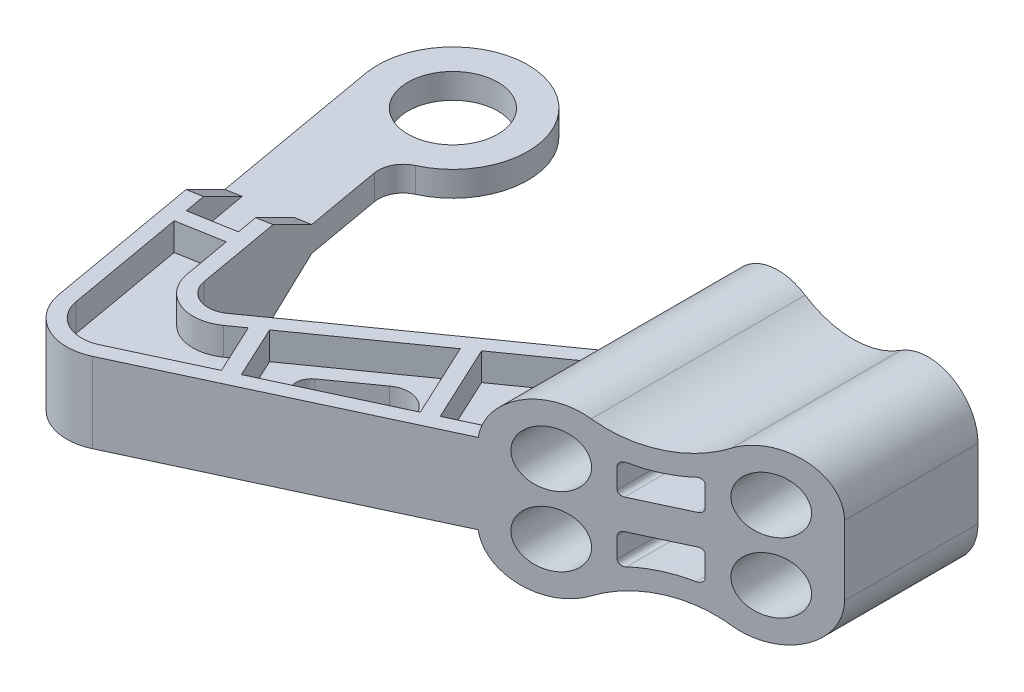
ISO-10303-21;
HEADER;
FILE_DESCRIPTION(('STEP AP214'),'2;1');
FILE_NAME('part.step','',(''),(''),'','','');
FILE_SCHEMA(('AUTOMOTIVE_DESIGN { 1 0 10303 214 1 1 1 1 }'));
ENDSEC;
DATA;
#1=APPLICATION_CONTEXT('core data for automotive mechanical design processes');
#2=APPLICATION_PROTOCOL_DEFINITION('international standard','automotive_design',2000,#1);
#3=PRODUCT_CONTEXT('',#1,'mechanical');
#4=PRODUCT('Part','Part','',(#3));
#5=PRODUCT_RELATED_PRODUCT_CATEGORY('part','',(#4));
#6=PRODUCT_DEFINITION_FORMATION('','',#4);
#7=PRODUCT_DEFINITION_CONTEXT('part definition',#1,'design');
#8=PRODUCT_DEFINITION('design','',#6,#7);
#9=PRODUCT_DEFINITION_SHAPE('','',#8);
#10=(LENGTH_UNIT() NAMED_UNIT(*) SI_UNIT(.MILLI.,.METRE.));
#11=(NAMED_UNIT(*) PLANE_ANGLE_UNIT() SI_UNIT($,.RADIAN.));
#12=(NAMED_UNIT(*) SI_UNIT($,.STERADIAN.) SOLID_ANGLE_UNIT());
#13=UNCERTAINTY_MEASURE_WITH_UNIT(LENGTH_MEASURE(1.E-05),#10,'distance_accuracy_value','');
#14=(GEOMETRIC_REPRESENTATION_CONTEXT(3) GLOBAL_UNCERTAINTY_ASSIGNED_CONTEXT((#13)) GLOBAL_UNIT_ASSIGNED_CONTEXT((#10,
#11,#12)) REPRESENTATION_CONTEXT('',''));
#15=CARTESIAN_POINT('',(0.,0.,0.));
#16=DIRECTION('',(0.,0.,1.));
#17=DIRECTION('',(1.,0.,0.));
#18=AXIS2_PLACEMENT_3D('',#15,#16,#17);
#19=CARTESIAN_POINT('',(15.,-6.95113885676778,0.));
#20=DIRECTION('',(0.,0.,1.));
#21=DIRECTION('',(1.,0.,0.));
#22=AXIS2_PLACEMENT_3D('',#19,#20,#21);
#23=PLANE('',#22);
#24=CARTESIAN_POINT('',(0.,30.,0.));
#25=DIRECTION('',(0.,0.,-1.));
#26=DIRECTION('',(1.,0.,0.));
#27=AXIS2_PLACEMENT_3D('',#24,#25,#26);
#28=CIRCLE('',#27,21.5);
#29=CARTESIAN_POINT('',(4.77777777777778,9.03758507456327,0.));
#30=VERTEX_POINT('',#29);
#31=CARTESIAN_POINT('',(-4.77777777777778,9.03758507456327,0.));
#32=VERTEX_POINT('',#31);
#33=EDGE_CURVE('E1146',#30,#32,#28,.T.);
#34=ORIENTED_EDGE('',*,*,#33,.T.);
#35=CARTESIAN_POINT('',(-5.,8.0625890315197,0.));
#36=DIRECTION('',(0.,0.,1.));
#37=DIRECTION('',(1.,0.,0.));
#38=AXIS2_PLACEMENT_3D('',#35,#36,#37);
#39=CIRCLE('',#38,1.);
#40=CARTESIAN_POINT('',(-6.,8.0625890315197,0.));
#41=VERTEX_POINT('',#40);
#42=EDGE_CURVE('E42',#32,#41,#39,.T.);
#43=ORIENTED_EDGE('',*,*,#42,.T.);
#44=DIRECTION('',(0.,-1.,0.));
#45=VECTOR('',#44,1.);
#46=CARTESIAN_POINT('',(-6.,3.,0.));
#47=LINE('',#46,#45);
#48=CARTESIAN_POINT('',(-6.,4.,0.));
#49=VERTEX_POINT('',#48);
#50=EDGE_CURVE('E1145',#41,#49,#47,.T.);
#51=ORIENTED_EDGE('',*,*,#50,.T.);
#52=CARTESIAN_POINT('',(-5.,4.,0.));
#53=DIRECTION('',(0.,0.,1.));
#54=DIRECTION('',(1.,0.,0.));
#55=AXIS2_PLACEMENT_3D('',#52,#53,#54);
#56=CIRCLE('',#55,1.);
#57=CARTESIAN_POINT('',(-5.,3.,0.));
#58=VERTEX_POINT('',#57);
#59=EDGE_CURVE('E1136',#49,#58,#56,.T.);
#60=ORIENTED_EDGE('',*,*,#59,.T.);
#61=DIRECTION('',(1.,0.,0.));
#62=VECTOR('',#61,1.);
#63=CARTESIAN_POINT('',(-6.,3.,0.));
#64=LINE('',#63,#62);
#65=CARTESIAN_POINT('',(5.,3.,0.));
#66=VERTEX_POINT('',#65);
#67=EDGE_CURVE('E1152',#58,#66,#64,.T.);
#68=ORIENTED_EDGE('',*,*,#67,.T.);
#69=CARTESIAN_POINT('',(5.,4.,0.));
#70=DIRECTION('',(0.,0.,1.));
#71=DIRECTION('',(1.,0.,0.));
#72=AXIS2_PLACEMENT_3D('',#69,#70,#71);
#73=CIRCLE('',#72,1.);
#74=CARTESIAN_POINT('',(6.,4.,0.));
#75=VERTEX_POINT('',#74);
#76=EDGE_CURVE('E1132',#66,#75,#73,.T.);
#77=ORIENTED_EDGE('',*,*,#76,.T.);
#78=DIRECTION('',(0.,1.,0.));
#79=VECTOR('',#78,1.);
#80=CARTESIAN_POINT('',(6.,3.,0.));
#81=LINE('',#80,#79);
#82=CARTESIAN_POINT('',(6.,8.0625890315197,0.));
#83=VERTEX_POINT('',#82);
#84=EDGE_CURVE('E1171',#75,#83,#81,.T.);
#85=ORIENTED_EDGE('',*,*,#84,.T.);
#86=CARTESIAN_POINT('',(5.,8.0625890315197,0.));
#87=DIRECTION('',(0.,0.,1.));
#88=DIRECTION('',(1.,0.,0.));
#89=AXIS2_PLACEMENT_3D('',#86,#87,#88);
#90=CIRCLE('',#89,1.);
#91=EDGE_CURVE('E56',#83,#30,#90,.T.);
#92=ORIENTED_EDGE('',*,*,#91,.T.);
#93=EDGE_LOOP('',(#34,#43,#51,#60,#68,#77,#85,#92));
#94=FACE_BOUND('',#93,.T.);
#95=CARTESIAN_POINT('',(-15.,-6.95113885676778,0.));
#96=DIRECTION('',(0.,0.,1.));
#97=DIRECTION('',(1.,0.,0.));
#98=AXIS2_PLACEMENT_3D('',#95,#96,#97);
#99=CIRCLE('',#98,2.74999999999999);
#100=CARTESIAN_POINT('',(-12.25,-6.95113885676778,0.));
#101=VERTEX_POINT('',#100);
#102=EDGE_CURVE('E1073',#101,#101,#99,.T.);
#103=ORIENTED_EDGE('',*,*,#102,.T.);
#104=EDGE_LOOP('',(#103));
#105=FACE_BOUND('',#104,.T.);
#106=CARTESIAN_POINT('',(-15.,6.95113885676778,0.));
#107=DIRECTION('',(0.,0.,1.));
#108=DIRECTION('',(1.,0.,0.));
#109=AXIS2_PLACEMENT_3D('',#106,#107,#108);
#110=CIRCLE('',#109,2.74999999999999);
#111=CARTESIAN_POINT('',(-12.25,6.95113885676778,0.));
#112=VERTEX_POINT('',#111);
#113=EDGE_CURVE('E1065',#112,#112,#110,.T.);
#114=ORIENTED_EDGE('',*,*,#113,.T.);
#115=EDGE_LOOP('',(#114));
#116=FACE_BOUND('',#115,.T.);
#117=CARTESIAN_POINT('',(15.,6.95113885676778,0.));
#118=DIRECTION('',(0.,0.,1.));
#119=DIRECTION('',(1.,0.,0.));
#120=AXIS2_PLACEMENT_3D('',#117,#118,#119);
#121=CIRCLE('',#120,2.74999999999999);
#122=CARTESIAN_POINT('',(17.75,6.95113885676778,0.));
#123=VERTEX_POINT('',#122);
#124=EDGE_CURVE('E1057',#123,#123,#121,.T.);
#125=ORIENTED_EDGE('',*,*,#124,.T.);
#126=EDGE_LOOP('',(#125));
#127=FACE_BOUND('',#126,.T.);
#128=CARTESIAN_POINT('',(15.,-6.95113885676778,0.));
#129=DIRECTION('',(0.,0.,1.));
#130=DIRECTION('',(1.,0.,0.));
#131=AXIS2_PLACEMENT_3D('',#128,#129,#130);
#132=CIRCLE('',#131,2.74999999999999);
#133=CARTESIAN_POINT('',(17.75,-6.95113885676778,0.));
#134=VERTEX_POINT('',#133);
#135=EDGE_CURVE('E576',#134,#134,#132,.T.);
#136=ORIENTED_EDGE('',*,*,#135,.T.);
#137=EDGE_LOOP('',(#136));
#138=FACE_BOUND('',#137,.T.);
#139=CARTESIAN_POINT('',(15.,-6.95113885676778,0.));
#140=DIRECTION('',(0.,0.,1.));
#141=DIRECTION('',(1.,0.,0.));
#142=AXIS2_PLACEMENT_3D('',#139,#140,#141);
#143=CIRCLE('',#142,10.);
#144=CARTESIAN_POINT('',(9.54545454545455,-15.3325429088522,0.));
#145=VERTEX_POINT('',#144);
#146=CARTESIAN_POINT('',(25.,-6.95113885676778,0.));
#147=VERTEX_POINT('',#146);
#148=EDGE_CURVE('E904',#145,#147,#143,.T.);
#149=ORIENTED_EDGE('',*,*,#148,.F.);
#150=CARTESIAN_POINT('',(0.,-30.,0.));
#151=DIRECTION('',(0.,0.,-1.));
#152=DIRECTION('',(1.,0.,0.));
#153=AXIS2_PLACEMENT_3D('',#150,#151,#152);
#154=CIRCLE('',#153,17.5);
#155=CARTESIAN_POINT('',(-9.54545454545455,-15.3325429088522,0.));
#156=VERTEX_POINT('',#155);
#157=EDGE_CURVE('E925',#156,#145,#154,.T.);
#158=ORIENTED_EDGE('',*,*,#157,.F.);
#159=CARTESIAN_POINT('',(-15.,-6.95113885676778,0.));
#160=DIRECTION('',(0.,0.,1.));
#161=DIRECTION('',(1.,0.,0.));
#162=AXIS2_PLACEMENT_3D('',#159,#160,#161);
#163=CIRCLE('',#162,10.);
#164=CARTESIAN_POINT('',(-25.,-6.95113885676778,0.));
#165=VERTEX_POINT('',#164);
#166=EDGE_CURVE('E922',#165,#156,#163,.T.);
#167=ORIENTED_EDGE('',*,*,#166,.F.);
#168=DIRECTION('',(0.,-1.,0.));
#169=VECTOR('',#168,1.);
#170=CARTESIAN_POINT('',(-25.,-6.95113885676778,0.));
#171=LINE('',#170,#169);
#172=CARTESIAN_POINT('',(-25.,6.95113885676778,0.));
#173=VERTEX_POINT('',#172);
#174=EDGE_CURVE('E919',#173,#165,#171,.T.);
#175=ORIENTED_EDGE('',*,*,#174,.F.);
#176=CARTESIAN_POINT('',(-15.,6.95113885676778,0.));
#177=DIRECTION('',(0.,0.,1.));
#178=DIRECTION('',(1.,0.,0.));
#179=AXIS2_PLACEMENT_3D('',#176,#177,#178);
#180=CIRCLE('',#179,10.);
#181=CARTESIAN_POINT('',(-9.54545454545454,15.3325429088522,0.));
#182=VERTEX_POINT('',#181);
#183=EDGE_CURVE('E916',#182,#173,#180,.T.);
#184=ORIENTED_EDGE('',*,*,#183,.F.);
#185=CARTESIAN_POINT('',(0.,30.,0.));
#186=DIRECTION('',(0.,0.,-1.));
#187=DIRECTION('',(1.,0.,0.));
#188=AXIS2_PLACEMENT_3D('',#185,#186,#187);
#189=CIRCLE('',#188,17.5);
#190=CARTESIAN_POINT('',(9.54545454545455,15.3325429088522,0.));
#191=VERTEX_POINT('',#190);
#192=EDGE_CURVE('E913',#191,#182,#189,.T.);
#193=ORIENTED_EDGE('',*,*,#192,.F.);
#194=CARTESIAN_POINT('',(15.,6.95113885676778,0.));
#195=DIRECTION('',(0.,0.,1.));
#196=DIRECTION('',(1.,0.,0.));
#197=AXIS2_PLACEMENT_3D('',#194,#195,#196);
#198=CIRCLE('',#197,10.);
#199=CARTESIAN_POINT('',(25.,6.95113885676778,0.));
#200=VERTEX_POINT('',#199);
#201=EDGE_CURVE('E910',#200,#191,#198,.T.);
#202=ORIENTED_EDGE('',*,*,#201,.F.);
#203=DIRECTION('',(0.,1.,0.));
#204=VECTOR('',#203,1.);
#205=CARTESIAN_POINT('',(25.,-6.95113885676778,0.));
#206=LINE('',#205,#204);
#207=EDGE_CURVE('E907',#147,#200,#206,.T.);
#208=ORIENTED_EDGE('',*,*,#207,.F.);
#209=EDGE_LOOP('',(#149,#158,#167,#175,#184,#193,#202,#208));
#210=FACE_BOUND('',#209,.T.);
#211=CARTESIAN_POINT('',(0.,-30.,0.));
#212=DIRECTION('',(0.,0.,-1.));
#213=DIRECTION('',(1.,0.,0.));
#214=AXIS2_PLACEMENT_3D('',#211,#212,#213);
#215=CIRCLE('',#214,21.5);
#216=CARTESIAN_POINT('',(-4.77777777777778,-9.03758507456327,0.));
#217=VERTEX_POINT('',#216);
#218=CARTESIAN_POINT('',(4.77777777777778,-9.03758507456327,0.));
#219=VERTEX_POINT('',#218);
#220=EDGE_CURVE('E1385',#217,#219,#215,.T.);
#221=ORIENTED_EDGE('',*,*,#220,.T.);
#222=CARTESIAN_POINT('',(5.,-8.06258903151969,0.));
#223=DIRECTION('',(0.,0.,1.));
#224=DIRECTION('',(1.,0.,0.));
#225=AXIS2_PLACEMENT_3D('',#222,#223,#224);
#226=CIRCLE('',#225,1.);
#227=CARTESIAN_POINT('',(6.,-8.06258903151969,0.));
#228=VERTEX_POINT('',#227);
#229=EDGE_CURVE('E1116',#219,#228,#226,.T.);
#230=ORIENTED_EDGE('',*,*,#229,.T.);
#231=DIRECTION('',(0.,1.,0.));
#232=VECTOR('',#231,1.);
#233=CARTESIAN_POINT('',(6.,-9.35417717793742,0.));
#234=LINE('',#233,#232);
#235=CARTESIAN_POINT('',(6.,-4.,0.));
#236=VERTEX_POINT('',#235);
#237=EDGE_CURVE('E2129',#228,#236,#234,.T.);
#238=ORIENTED_EDGE('',*,*,#237,.T.);
#239=CARTESIAN_POINT('',(5.,-4.,0.));
#240=DIRECTION('',(0.,0.,1.));
#241=DIRECTION('',(1.,0.,0.));
#242=AXIS2_PLACEMENT_3D('',#239,#240,#241);
#243=CIRCLE('',#242,1.);
#244=CARTESIAN_POINT('',(5.,-3.,0.));
#245=VERTEX_POINT('',#244);
#246=EDGE_CURVE('E1128',#236,#245,#243,.T.);
#247=ORIENTED_EDGE('',*,*,#246,.T.);
#248=DIRECTION('',(-1.,0.,0.));
#249=VECTOR('',#248,1.);
#250=CARTESIAN_POINT('',(-6.,-3.,0.));
#251=LINE('',#250,#249);
#252=CARTESIAN_POINT('',(-5.,-3.,0.));
#253=VERTEX_POINT('',#252);
#254=EDGE_CURVE('E2133',#245,#253,#251,.T.);
#255=ORIENTED_EDGE('',*,*,#254,.T.);
#256=CARTESIAN_POINT('',(-5.,-4.,0.));
#257=DIRECTION('',(0.,0.,1.));
#258=DIRECTION('',(1.,0.,0.));
#259=AXIS2_PLACEMENT_3D('',#256,#257,#258);
#260=CIRCLE('',#259,1.);
#261=CARTESIAN_POINT('',(-6.,-4.,0.));
#262=VERTEX_POINT('',#261);
#263=EDGE_CURVE('E1124',#253,#262,#260,.T.);
#264=ORIENTED_EDGE('',*,*,#263,.T.);
#265=DIRECTION('',(0.,-1.,0.));
#266=VECTOR('',#265,1.);
#267=CARTESIAN_POINT('',(-6.,-9.35417717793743,0.));
#268=LINE('',#267,#266);
#269=CARTESIAN_POINT('',(-6.,-8.06258903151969,0.));
#270=VERTEX_POINT('',#269);
#271=EDGE_CURVE('E2137',#262,#270,#268,.T.);
#272=ORIENTED_EDGE('',*,*,#271,.T.);
#273=CARTESIAN_POINT('',(-5.,-8.06258903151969,0.));
#274=DIRECTION('',(0.,0.,1.));
#275=DIRECTION('',(1.,0.,0.));
#276=AXIS2_PLACEMENT_3D('',#273,#274,#275);
#277=CIRCLE('',#276,1.);
#278=EDGE_CURVE('E1120',#270,#217,#277,.T.);
#279=ORIENTED_EDGE('',*,*,#278,.T.);
#280=EDGE_LOOP('',(#221,#230,#238,#247,#255,#264,#272,#279));
#281=FACE_BOUND('',#280,.T.);
#282=ADVANCED_FACE('F34',(#94,#105,#116,#127,#138,#210,#281),#23,.F.);
#283=CARTESIAN_POINT('',(-25.,16.9521388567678,50.));
#284=DIRECTION('',(0.422618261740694,0.,0.906307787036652));
#285=DIRECTION('',(0.906307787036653,0.,-0.422618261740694));
#286=AXIS2_PLACEMENT_3D('',#283,#284,#285);
#287=PLANE('',#286);
#288=CARTESIAN_POINT('',(-15.,-6.95113885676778,45.3369234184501));
#289=DIRECTION('',(0.422618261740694,0.,0.906307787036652));
#290=DIRECTION('',(-0.906307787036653,0.,0.422618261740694));
#291=AXIS2_PLACEMENT_3D('',#288,#289,#290);
#292=ELLIPSE('',#291,6.06857855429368,5.5);
#293=CARTESIAN_POINT('',(-20.5,-6.95113885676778,47.9016155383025));
#294=VERTEX_POINT('',#293);
#295=EDGE_CURVE('E1070',#294,#294,#292,.T.);
#296=ORIENTED_EDGE('',*,*,#295,.F.);
#297=EDGE_LOOP('',(#296));
#298=FACE_BOUND('',#297,.T.);
#299=CARTESIAN_POINT('',(-15.,6.95113885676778,45.3369234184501));
#300=DIRECTION('',(0.422618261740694,0.,0.906307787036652));
#301=DIRECTION('',(-0.906307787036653,0.,0.422618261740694));
#302=AXIS2_PLACEMENT_3D('',#299,#300,#301);
#303=ELLIPSE('',#302,6.06857855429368,5.5);
#304=CARTESIAN_POINT('',(-20.5,6.95113885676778,47.9016155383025));
#305=VERTEX_POINT('',#304);
#306=EDGE_CURVE('E1062',#305,#305,#303,.T.);
#307=ORIENTED_EDGE('',*,*,#306,.F.);
#308=EDGE_LOOP('',(#307));
#309=FACE_BOUND('',#308,.T.);
#310=CARTESIAN_POINT('',(15.,6.95113885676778,31.3476936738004));
#311=DIRECTION('',(0.422618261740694,0.,0.906307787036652));
#312=DIRECTION('',(-0.906307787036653,0.,0.422618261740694));
#313=AXIS2_PLACEMENT_3D('',#310,#311,#312);
#314=ELLIPSE('',#313,6.06857855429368,5.5);
#315=CARTESIAN_POINT('',(9.50000000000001,6.95113885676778,33.9123857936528));
#316=VERTEX_POINT('',#315);
#317=EDGE_CURVE('E1054',#316,#316,#314,.T.);
#318=ORIENTED_EDGE('',*,*,#317,.F.);
#319=EDGE_LOOP('',(#318));
#320=FACE_BOUND('',#319,.T.);
#321=CARTESIAN_POINT('',(15.,-6.95113885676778,31.3476936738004));
#322=DIRECTION('',(0.422618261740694,0.,0.906307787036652));
#323=DIRECTION('',(-0.906307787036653,0.,0.422618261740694));
#324=AXIS2_PLACEMENT_3D('',#321,#322,#323);
#325=ELLIPSE('',#324,6.06857855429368,5.5);
#326=CARTESIAN_POINT('',(9.50000000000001,-6.95113885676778,33.9123857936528));
#327=VERTEX_POINT('',#326);
#328=EDGE_CURVE('E579',#327,#327,#325,.T.);
#329=ORIENTED_EDGE('',*,*,#328,.F.);
#330=EDGE_LOOP('',(#329));
#331=FACE_BOUND('',#330,.T.);
#332=CARTESIAN_POINT('',(-15.,6.95113885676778,45.3369234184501));
#333=DIRECTION('',(0.422618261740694,0.,0.906307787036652));
#334=DIRECTION('',(0.906307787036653,0.,-0.422618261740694));
#335=AXIS2_PLACEMENT_3D('',#332,#333,#334);
#336=ELLIPSE('',#335,11.0337791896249,10.);
#337=CARTESIAN_POINT('',(-24.9448423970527,8.,49.9742795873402));
#338=VERTEX_POINT('',#337);
#339=CARTESIAN_POINT('',(-9.54545454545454,15.3325429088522,42.7934271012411));
#340=VERTEX_POINT('',#339);
#341=EDGE_CURVE('E893',#338,#340,#336,.F.);
#342=ORIENTED_EDGE('',*,*,#341,.F.);
#343=DIRECTION('',(0.906307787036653,0.,-0.422618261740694));
#344=VECTOR('',#343,1.);
#345=CARTESIAN_POINT('',(-77.548704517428,8.,74.5038633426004));
#346=LINE('',#345,#344);
#347=CARTESIAN_POINT('',(-77.548704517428,8.,74.5038633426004));
#348=VERTEX_POINT('',#347);
#349=EDGE_CURVE('E726',#348,#338,#346,.T.);
#350=ORIENTED_EDGE('',*,*,#349,.F.);
#351=DIRECTION('',(0.,1.,0.));
#352=VECTOR('',#351,1.);
#353=CARTESIAN_POINT('',(-77.548704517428,16.9521388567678,74.5038633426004));
#354=LINE('',#353,#352);
#355=CARTESIAN_POINT('',(-77.548704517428,-8.,74.5038633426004));
#356=VERTEX_POINT('',#355);
#357=EDGE_CURVE('E951',#348,#356,#354,.F.);
#358=ORIENTED_EDGE('',*,*,#357,.T.);
#359=DIRECTION('',(0.906307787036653,0.,-0.422618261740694));
#360=VECTOR('',#359,1.);
#361=CARTESIAN_POINT('',(-77.548704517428,-8.,74.5038633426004));
#362=LINE('',#361,#360);
#363=CARTESIAN_POINT('',(-24.9448423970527,-8.,49.9742795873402));
#364=VERTEX_POINT('',#363);
#365=EDGE_CURVE('E746',#356,#364,#362,.T.);
#366=ORIENTED_EDGE('',*,*,#365,.T.);
#367=CARTESIAN_POINT('',(-15.,-6.95113885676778,45.3369234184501));
#368=DIRECTION('',(-0.422618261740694,0.,-0.906307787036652));
#369=DIRECTION('',(0.906307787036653,0.,-0.422618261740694));
#370=AXIS2_PLACEMENT_3D('',#367,#368,#369);
#371=ELLIPSE('',#370,11.0337791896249,10.);
#372=CARTESIAN_POINT('',(-9.54545454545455,-15.3325429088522,42.7934271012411));
#373=VERTEX_POINT('',#372);
#374=EDGE_CURVE('E889',#364,#373,#371,.F.);
#375=ORIENTED_EDGE('',*,*,#374,.T.);
#376=CARTESIAN_POINT('',(0.,-30.,38.3423085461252));
#377=DIRECTION('',(-0.422618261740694,0.,-0.906307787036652));
#378=DIRECTION('',(0.906307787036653,0.,-0.422618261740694));
#379=AXIS2_PLACEMENT_3D('',#376,#377,#378);
#380=ELLIPSE('',#379,19.3091135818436,17.5);
#381=CARTESIAN_POINT('',(9.54545454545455,-15.3325429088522,33.8911899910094));
#382=VERTEX_POINT('',#381);
#383=EDGE_CURVE('E887',#373,#382,#380,.T.);
#384=ORIENTED_EDGE('',*,*,#383,.T.);
#385=CARTESIAN_POINT('',(15.,-6.95113885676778,31.3476936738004));
#386=DIRECTION('',(-0.422618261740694,0.,-0.906307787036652));
#387=DIRECTION('',(0.906307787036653,0.,-0.422618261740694));
#388=AXIS2_PLACEMENT_3D('',#385,#386,#387);
#389=ELLIPSE('',#388,11.0337791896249,10.);
#390=CARTESIAN_POINT('',(25.,-6.95113885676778,26.6846170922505));
#391=VERTEX_POINT('',#390);
#392=EDGE_CURVE('E891',#382,#391,#389,.F.);
#393=ORIENTED_EDGE('',*,*,#392,.T.);
#394=DIRECTION('',(0.,-1.,0.));
#395=VECTOR('',#394,1.);
#396=CARTESIAN_POINT('',(25.,16.9521388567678,26.6846170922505));
#397=LINE('',#396,#395);
#398=CARTESIAN_POINT('',(25.,6.95113885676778,26.6846170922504));
#399=VERTEX_POINT('',#398);
#400=EDGE_CURVE('E901',#399,#391,#397,.T.);
#401=ORIENTED_EDGE('',*,*,#400,.F.);
#402=CARTESIAN_POINT('',(15.,6.95113885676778,31.3476936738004));
#403=DIRECTION('',(0.422618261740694,0.,0.906307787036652));
#404=DIRECTION('',(0.906307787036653,0.,-0.422618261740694));
#405=AXIS2_PLACEMENT_3D('',#402,#403,#404);
#406=ELLIPSE('',#405,11.0337791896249,10.);
#407=CARTESIAN_POINT('',(9.54545454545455,15.3325429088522,33.8911899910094));
#408=VERTEX_POINT('',#407);
#409=EDGE_CURVE('E898',#408,#399,#406,.F.);
#410=ORIENTED_EDGE('',*,*,#409,.F.);
#411=CARTESIAN_POINT('',(0.,30.,38.3423085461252));
#412=DIRECTION('',(0.422618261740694,0.,0.906307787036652));
#413=DIRECTION('',(0.906307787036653,0.,-0.422618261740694));
#414=AXIS2_PLACEMENT_3D('',#411,#412,#413);
#415=ELLIPSE('',#414,19.3091135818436,17.5);
#416=EDGE_CURVE('E895',#340,#408,#415,.T.);
#417=ORIENTED_EDGE('',*,*,#416,.F.);
#418=EDGE_LOOP('',(#342,#350,#358,#366,#375,#384,#393,#401,#410,#417));
#419=FACE_BOUND('',#418,.T.);
#420=DIRECTION('',(0.906307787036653,0.,-0.422618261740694));
#421=VECTOR('',#420,1.);
#422=CARTESIAN_POINT('',(-19.1382868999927,3.,47.2666382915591));
#423=LINE('',#422,#421);
#424=CARTESIAN_POINT('',(-5.,3.,40.6738468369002));
#425=VERTEX_POINT('',#424);
#426=CARTESIAN_POINT('',(5.,3.,36.0107702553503));
#427=VERTEX_POINT('',#426);
#428=EDGE_CURVE('E1379',#425,#427,#423,.T.);
#429=ORIENTED_EDGE('',*,*,#428,.F.);
#430=CARTESIAN_POINT('',(-5.,4.,40.6738468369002));
#431=DIRECTION('',(0.422618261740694,0.,0.906307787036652));
#432=DIRECTION('',(-0.906307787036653,0.,0.422618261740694));
#433=AXIS2_PLACEMENT_3D('',#430,#431,#432);
#434=ELLIPSE('',#433,1.10337791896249,1.);
#435=CARTESIAN_POINT('',(-6.,4.,41.1401544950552));
#436=VERTEX_POINT('',#435);
#437=EDGE_CURVE('E1138',#425,#436,#434,.F.);
#438=ORIENTED_EDGE('',*,*,#437,.T.);
#439=DIRECTION('',(0.,-1.,0.));
#440=VECTOR('',#439,1.);
#441=CARTESIAN_POINT('',(-6.,2.99999999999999,41.1401544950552));
#442=LINE('',#441,#440);
#443=CARTESIAN_POINT('',(-6.,8.0625890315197,41.1401544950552));
#444=VERTEX_POINT('',#443);
#445=EDGE_CURVE('E1153',#444,#436,#442,.T.);
#446=ORIENTED_EDGE('',*,*,#445,.F.);
#447=CARTESIAN_POINT('',(-5.,8.0625890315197,40.6738468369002));
#448=DIRECTION('',(0.422618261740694,0.,0.906307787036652));
#449=DIRECTION('',(0.906307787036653,0.,-0.422618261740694));
#450=AXIS2_PLACEMENT_3D('',#447,#448,#449);
#451=ELLIPSE('',#450,1.10337791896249,1.);
#452=CARTESIAN_POINT('',(-4.77777777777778,9.03758507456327,40.5702229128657));
#453=VERTEX_POINT('',#452);
#454=EDGE_CURVE('E11',#444,#453,#451,.F.);
#455=ORIENTED_EDGE('',*,*,#454,.T.);
#456=CARTESIAN_POINT('',(0.,30.,38.3423085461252));
#457=DIRECTION('',(0.422618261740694,0.,0.906307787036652));
#458=DIRECTION('',(0.906307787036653,0.,-0.422618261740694));
#459=AXIS2_PLACEMENT_3D('',#456,#457,#458);
#460=ELLIPSE('',#459,23.7226252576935,21.5);
#461=CARTESIAN_POINT('',(4.77777777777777,9.03758507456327,36.1143941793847));
#462=VERTEX_POINT('',#461);
#463=EDGE_CURVE('E1162',#462,#453,#460,.F.);
#464=ORIENTED_EDGE('',*,*,#463,.F.);
#465=CARTESIAN_POINT('',(5.,8.0625890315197,36.0107702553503));
#466=DIRECTION('',(0.422618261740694,0.,0.906307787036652));
#467=DIRECTION('',(0.906307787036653,0.,-0.422618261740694));
#468=AXIS2_PLACEMENT_3D('',#465,#466,#467);
#469=ELLIPSE('',#468,1.10337791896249,1.);
#470=CARTESIAN_POINT('',(6.,8.0625890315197,35.5444625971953));
#471=VERTEX_POINT('',#470);
#472=EDGE_CURVE('E1141',#462,#471,#469,.F.);
#473=ORIENTED_EDGE('',*,*,#472,.T.);
#474=DIRECTION('',(0.,1.,0.));
#475=VECTOR('',#474,1.);
#476=CARTESIAN_POINT('',(6.,3.,35.5444625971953));
#477=LINE('',#476,#475);
#478=CARTESIAN_POINT('',(6.,4.,35.5444625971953));
#479=VERTEX_POINT('',#478);
#480=EDGE_CURVE('E1373',#479,#471,#477,.T.);
#481=ORIENTED_EDGE('',*,*,#480,.F.);
#482=CARTESIAN_POINT('',(5.,4.,36.0107702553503));
#483=DIRECTION('',(0.422618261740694,0.,0.906307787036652));
#484=DIRECTION('',(-0.906307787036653,0.,0.422618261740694));
#485=AXIS2_PLACEMENT_3D('',#482,#483,#484);
#486=ELLIPSE('',#485,1.10337791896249,1.);
#487=EDGE_CURVE('E1134',#479,#427,#486,.F.);
#488=ORIENTED_EDGE('',*,*,#487,.T.);
#489=EDGE_LOOP('',(#429,#438,#446,#455,#464,#473,#481,#488));
#490=FACE_BOUND('',#489,.T.);
#491=DIRECTION('',(-0.906307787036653,0.,0.422618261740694));
#492=VECTOR('',#491,1.);
#493=CARTESIAN_POINT('',(-19.1382868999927,-3.,47.2666382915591));
#494=LINE('',#493,#492);
#495=CARTESIAN_POINT('',(5.,-3.,36.0107702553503));
#496=VERTEX_POINT('',#495);
#497=CARTESIAN_POINT('',(-5.,-3.,40.6738468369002));
#498=VERTEX_POINT('',#497);
#499=EDGE_CURVE('E2139',#496,#498,#494,.T.);
#500=ORIENTED_EDGE('',*,*,#499,.F.);
#501=CARTESIAN_POINT('',(5.,-4.,36.0107702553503));
#502=DIRECTION('',(0.422618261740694,0.,0.906307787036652));
#503=DIRECTION('',(-0.906307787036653,0.,0.422618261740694));
#504=AXIS2_PLACEMENT_3D('',#501,#502,#503);
#505=ELLIPSE('',#504,1.10337791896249,1.);
#506=CARTESIAN_POINT('',(6.,-4.,35.5444625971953));
#507=VERTEX_POINT('',#506);
#508=EDGE_CURVE('E1130',#496,#507,#505,.F.);
#509=ORIENTED_EDGE('',*,*,#508,.T.);
#510=DIRECTION('',(0.,1.,0.));
#511=VECTOR('',#510,1.);
#512=CARTESIAN_POINT('',(6.,-9.35417717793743,35.5444625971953));
#513=LINE('',#512,#511);
#514=CARTESIAN_POINT('',(6.,-8.06258903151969,35.5444625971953));
#515=VERTEX_POINT('',#514);
#516=EDGE_CURVE('E2134',#515,#507,#513,.T.);
#517=ORIENTED_EDGE('',*,*,#516,.F.);
#518=CARTESIAN_POINT('',(5.,-8.06258903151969,36.0107702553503));
#519=DIRECTION('',(0.422618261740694,0.,0.906307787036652));
#520=DIRECTION('',(0.906307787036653,0.,-0.422618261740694));
#521=AXIS2_PLACEMENT_3D('',#518,#519,#520);
#522=ELLIPSE('',#521,1.10337791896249,1.);
#523=CARTESIAN_POINT('',(4.77777777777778,-9.03758507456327,36.1143941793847));
#524=VERTEX_POINT('',#523);
#525=EDGE_CURVE('E1118',#515,#524,#522,.F.);
#526=ORIENTED_EDGE('',*,*,#525,.T.);
#527=CARTESIAN_POINT('',(0.,-30.,38.3423085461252));
#528=DIRECTION('',(0.422618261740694,0.,0.906307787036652));
#529=DIRECTION('',(0.906307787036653,0.,-0.422618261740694));
#530=AXIS2_PLACEMENT_3D('',#527,#528,#529);
#531=ELLIPSE('',#530,23.7226252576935,21.5);
#532=CARTESIAN_POINT('',(-4.77777777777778,-9.03758507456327,40.5702229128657));
#533=VERTEX_POINT('',#532);
#534=EDGE_CURVE('E1380',#533,#524,#531,.F.);
#535=ORIENTED_EDGE('',*,*,#534,.F.);
#536=CARTESIAN_POINT('',(-5.,-8.06258903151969,40.6738468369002));
#537=DIRECTION('',(0.422618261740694,0.,0.906307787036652));
#538=DIRECTION('',(0.906307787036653,0.,-0.422618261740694));
#539=AXIS2_PLACEMENT_3D('',#536,#537,#538);
#540=ELLIPSE('',#539,1.10337791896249,1.);
#541=CARTESIAN_POINT('',(-6.,-8.06258903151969,41.1401544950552));
#542=VERTEX_POINT('',#541);
#543=EDGE_CURVE('E1122',#533,#542,#540,.F.);
#544=ORIENTED_EDGE('',*,*,#543,.T.);
#545=DIRECTION('',(0.,-1.,0.));
#546=VECTOR('',#545,1.);
#547=CARTESIAN_POINT('',(-6.,-9.35417717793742,41.1401544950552));
#548=LINE('',#547,#546);
#549=CARTESIAN_POINT('',(-6.,-4.,41.1401544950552));
#550=VERTEX_POINT('',#549);
#551=EDGE_CURVE('E2154',#550,#542,#548,.T.);
#552=ORIENTED_EDGE('',*,*,#551,.F.);
#553=CARTESIAN_POINT('',(-5.,-4.,40.6738468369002));
#554=DIRECTION('',(0.422618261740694,0.,0.906307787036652));
#555=DIRECTION('',(-0.906307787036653,0.,0.422618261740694));
#556=AXIS2_PLACEMENT_3D('',#553,#554,#555);
#557=ELLIPSE('',#556,1.10337791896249,1.);
#558=EDGE_CURVE('E1126',#550,#498,#557,.F.);
#559=ORIENTED_EDGE('',*,*,#558,.T.);
#560=EDGE_LOOP('',(#500,#509,#517,#526,#535,#544,#552,#559));
#561=FACE_BOUND('',#560,.T.);
#562=ADVANCED_FACE('F1160',(#298,#309,#320,#331,#419,#490,#561),#287,.T.);
#563=CARTESIAN_POINT('',(-90.,-2.5,-10.));
#564=DIRECTION('',(0.,-1.,0.));
#565=DIRECTION('',(0.,0.,-1.));
#566=AXIS2_PLACEMENT_3D('',#563,#564,#565);
#567=PLANE('',#566);
#568=DIRECTION('',(0.422618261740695,0.,0.906307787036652));
#569=VECTOR('',#568,1.);
#570=CARTESIAN_POINT('',(-65.7157524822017,-2.5,-21.3239305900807));
#571=LINE('',#570,#569);
#572=CARTESIAN_POINT('',(-39.6132790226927,-2.5,34.6530043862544));
#573=VERTEX_POINT('',#572);
#574=CARTESIAN_POINT('',(-32.3928712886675,-2.5,50.1372187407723));
#575=VERTEX_POINT('',#574);
#576=EDGE_CURVE('E634',#573,#575,#571,.T.);
#577=ORIENTED_EDGE('',*,*,#576,.F.);
#578=DIRECTION('',(-0.816017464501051,0.,0.578027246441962));
#579=VECTOR('',#578,1.);
#580=CARTESIAN_POINT('',(-52.1030718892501,-2.5,43.5001686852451));
#581=LINE('',#580,#579);
#582=CARTESIAN_POINT('',(-25.,-2.5,24.3016653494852));
#583=VERTEX_POINT('',#582);
#584=EDGE_CURVE('E861',#583,#573,#581,.T.);
#585=ORIENTED_EDGE('',*,*,#584,.F.);
#586=DIRECTION('',(0.,0.,-1.));
#587=VECTOR('',#586,1.);
#588=CARTESIAN_POINT('',(-25.,-2.5,50.));
#589=LINE('',#588,#587);
#590=CARTESIAN_POINT('',(-25.,-2.5,46.6898662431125));
#591=VERTEX_POINT('',#590);
#592=EDGE_CURVE('E885',#591,#583,#589,.T.);
#593=ORIENTED_EDGE('',*,*,#592,.F.);
#594=DIRECTION('',(0.906307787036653,0.,-0.422618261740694));
#595=VECTOR('',#594,1.);
#596=CARTESIAN_POINT('',(-56.6771188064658,-2.5,61.461149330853));
#597=LINE('',#596,#595);
#598=EDGE_CURVE('E773',#575,#591,#597,.T.);
#599=ORIENTED_EDGE('',*,*,#598,.F.);
#600=EDGE_LOOP('',(#577,#585,#593,#599));
#601=FACE_BOUND('',#600,.T.);
#602=ADVANCED_FACE('F1200',(#601),#567,.T.);
#603=CARTESIAN_POINT('',(-90.,2.5,-10.));
#604=DIRECTION('',(0.,-1.,0.));
#605=DIRECTION('',(0.,0.,-1.));
#606=AXIS2_PLACEMENT_3D('',#603,#604,#605);
#607=PLANE('',#606);
#608=DIRECTION('',(-0.816017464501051,0.,0.578027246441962));
#609=VECTOR('',#608,1.);
#610=CARTESIAN_POINT('',(-52.1030718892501,2.5,43.5001686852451));
#611=LINE('',#610,#609);
#612=CARTESIAN_POINT('',(-25.,2.5,24.3016653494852));
#613=VERTEX_POINT('',#612);
#614=CARTESIAN_POINT('',(-39.6132790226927,2.5,34.6530043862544));
#615=VERTEX_POINT('',#614);
#616=EDGE_CURVE('E974',#613,#615,#611,.T.);
#617=ORIENTED_EDGE('',*,*,#616,.T.);
#618=DIRECTION('',(0.422618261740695,0.,0.906307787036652));
#619=VECTOR('',#618,1.);
#620=CARTESIAN_POINT('',(-65.7157524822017,2.5,-21.3239305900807));
#621=LINE('',#620,#619);
#622=CARTESIAN_POINT('',(-32.3928712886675,2.5,50.1372187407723));
#623=VERTEX_POINT('',#622);
#624=EDGE_CURVE('E642',#615,#623,#621,.T.);
#625=ORIENTED_EDGE('',*,*,#624,.T.);
#626=DIRECTION('',(0.906307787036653,0.,-0.422618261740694));
#627=VECTOR('',#626,1.);
#628=CARTESIAN_POINT('',(-56.6771188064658,2.5,61.461149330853));
#629=LINE('',#628,#627);
#630=CARTESIAN_POINT('',(-25.,2.5,46.6898662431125));
#631=VERTEX_POINT('',#630);
#632=EDGE_CURVE('E984',#623,#631,#629,.T.);
#633=ORIENTED_EDGE('',*,*,#632,.T.);
#634=DIRECTION('',(0.,0.,-1.));
#635=VECTOR('',#634,1.);
#636=CARTESIAN_POINT('',(-25.,2.5,50.));
#637=LINE('',#636,#635);
#638=EDGE_CURVE('E883',#631,#613,#637,.T.);
#639=ORIENTED_EDGE('',*,*,#638,.T.);
#640=EDGE_LOOP('',(#617,#625,#633,#639));
#641=FACE_BOUND('',#640,.T.);
#642=ADVANCED_FACE('F1617',(#641),#607,.F.);
#643=CARTESIAN_POINT('',(-22.,-8.,22.1766106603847));
#644=DIRECTION('',(0.578027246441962,0.,0.81601746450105));
#645=DIRECTION('',(0.816017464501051,0.,-0.578027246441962));
#646=AXIS2_PLACEMENT_3D('',#643,#644,#645);
#647=PLANE('',#646);
#648=DIRECTION('',(0.,1.,0.));
#649=VECTOR('',#648,1.);
#650=CARTESIAN_POINT('',(-39.6132790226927,-8.,34.6530043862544));
#651=LINE('',#650,#649);
#652=CARTESIAN_POINT('',(-39.6132790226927,8.,34.6530043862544));
#653=VERTEX_POINT('',#652);
#654=EDGE_CURVE('E645',#615,#653,#651,.T.);
#655=ORIENTED_EDGE('',*,*,#654,.F.);
#656=ORIENTED_EDGE('',*,*,#616,.F.);
#657=DIRECTION('',(0.,-1.,0.));
#658=VECTOR('',#657,1.);
#659=CARTESIAN_POINT('',(-25.,-6.95113885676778,24.3016653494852));
#660=LINE('',#659,#658);
#661=CARTESIAN_POINT('',(-25.,6.95113885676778,24.3016653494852));
#662=VERTEX_POINT('',#661);
#663=EDGE_CURVE('E853',#662,#613,#660,.T.);
#664=ORIENTED_EDGE('',*,*,#663,.F.);
#665=CARTESIAN_POINT('',(-15.,6.95113885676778,17.2181497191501));
#666=DIRECTION('',(0.578027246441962,0.,0.81601746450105));
#667=DIRECTION('',(0.816017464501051,0.,-0.578027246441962));
#668=AXIS2_PLACEMENT_3D('',#665,#666,#667);
#669=ELLIPSE('',#668,12.2546396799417,10.);
#670=CARTESIAN_POINT('',(-24.9448423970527,8.,24.2625943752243));
#671=VERTEX_POINT('',#670);
#672=EDGE_CURVE('E856',#671,#662,#669,.T.);
#673=ORIENTED_EDGE('',*,*,#672,.F.);
#674=DIRECTION('',(0.81601746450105,0.,-0.578027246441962));
#675=VECTOR('',#674,1.);
#676=CARTESIAN_POINT('',(-22.,8.,22.1766106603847));
#677=LINE('',#676,#675);
#678=EDGE_CURVE('E807',#653,#671,#677,.T.);
#679=ORIENTED_EDGE('',*,*,#678,.F.);
#680=EDGE_LOOP('',(#655,#656,#664,#673,#679));
#681=FACE_BOUND('',#680,.T.);
#682=ADVANCED_FACE('F1507',(#681),#647,.T.);
#683=DIRECTION('',(0.,1.,0.));
#684=VECTOR('',#683,1.);
#685=CARTESIAN_POINT('',(-39.6132790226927,-8.,34.6530043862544));
#686=LINE('',#685,#684);
#687=CARTESIAN_POINT('',(-39.6132790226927,-8.,34.6530043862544));
#688=VERTEX_POINT('',#687);
#689=EDGE_CURVE('E637',#688,#573,#686,.T.);
#690=ORIENTED_EDGE('',*,*,#689,.F.);
#691=DIRECTION('',(0.81601746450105,0.,-0.578027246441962));
#692=VECTOR('',#691,1.);
#693=CARTESIAN_POINT('',(-22.,-8.,22.1766106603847));
#694=LINE('',#693,#692);
#695=CARTESIAN_POINT('',(-24.9448423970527,-8.,24.2625943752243));
#696=VERTEX_POINT('',#695);
#697=EDGE_CURVE('E827',#688,#696,#694,.T.);
#698=ORIENTED_EDGE('',*,*,#697,.T.);
#699=CARTESIAN_POINT('',(-15.,-6.95113885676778,17.2181497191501));
#700=DIRECTION('',(0.578027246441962,0.,0.81601746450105));
#701=DIRECTION('',(0.816017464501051,0.,-0.578027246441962));
#702=AXIS2_PLACEMENT_3D('',#699,#700,#701);
#703=ELLIPSE('',#702,12.2546396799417,10.);
#704=CARTESIAN_POINT('',(-25.,-6.95113885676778,24.3016653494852));
#705=VERTEX_POINT('',#704);
#706=EDGE_CURVE('E865',#705,#696,#703,.T.);
#707=ORIENTED_EDGE('',*,*,#706,.F.);
#708=EDGE_CURVE('E857',#583,#705,#660,.T.);
#709=ORIENTED_EDGE('',*,*,#708,.F.);
#710=ORIENTED_EDGE('',*,*,#584,.T.);
#711=EDGE_LOOP('',(#690,#698,#707,#709,#710));
#712=FACE_BOUND('',#711,.T.);
#713=ADVANCED_FACE('F1592',(#712),#647,.T.);
#714=CARTESIAN_POINT('',(-78.81655930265,-8.,71.7849399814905));
#715=DIRECTION('',(-0.422618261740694,0.,-0.906307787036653));
#716=DIRECTION('',(-0.906307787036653,0.,0.422618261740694));
#717=AXIS2_PLACEMENT_3D('',#714,#715,#716);
#718=PLANE('',#717);
#719=DIRECTION('',(0.,-1.,0.));
#720=VECTOR('',#719,1.);
#721=CARTESIAN_POINT('',(-32.3928712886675,-8.,50.1372187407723));
#722=LINE('',#721,#720);
#723=CARTESIAN_POINT('',(-32.3928712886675,8.,50.1372187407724));
#724=VERTEX_POINT('',#723);
#725=EDGE_CURVE('E640',#724,#623,#722,.T.);
#726=ORIENTED_EDGE('',*,*,#725,.F.);
#727=DIRECTION('',(-0.906307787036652,0.,0.422618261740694));
#728=VECTOR('',#727,1.);
#729=CARTESIAN_POINT('',(-78.81655930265,8.,71.7849399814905));
#730=LINE('',#729,#728);
#731=CARTESIAN_POINT('',(-24.9448423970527,8.,46.6641458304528));
#732=VERTEX_POINT('',#731);
#733=EDGE_CURVE('E730',#732,#724,#730,.T.);
#734=ORIENTED_EDGE('',*,*,#733,.F.);
#735=CARTESIAN_POINT('',(-15.,6.95113885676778,42.0267896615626));
#736=DIRECTION('',(-0.422618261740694,0.,-0.906307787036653));
#737=DIRECTION('',(0.906307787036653,0.,-0.422618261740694));
#738=AXIS2_PLACEMENT_3D('',#735,#736,#737);
#739=ELLIPSE('',#738,11.0337791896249,10.);
#740=CARTESIAN_POINT('',(-25.,6.95113885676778,46.6898662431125));
#741=VERTEX_POINT('',#740);
#742=EDGE_CURVE('E771',#741,#732,#739,.T.);
#743=ORIENTED_EDGE('',*,*,#742,.F.);
#744=DIRECTION('',(0.,1.,0.));
#745=VECTOR('',#744,1.);
#746=CARTESIAN_POINT('',(-25.,-6.95113885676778,46.6898662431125));
#747=LINE('',#746,#745);
#748=EDGE_CURVE('E765',#631,#741,#747,.T.);
#749=ORIENTED_EDGE('',*,*,#748,.F.);
#750=ORIENTED_EDGE('',*,*,#632,.F.);
#751=EDGE_LOOP('',(#726,#734,#743,#749,#750));
#752=FACE_BOUND('',#751,.T.);
#753=ADVANCED_FACE('F1517',(#752),#718,.T.);
#754=DIRECTION('',(0.,-1.,0.));
#755=VECTOR('',#754,1.);
#756=CARTESIAN_POINT('',(-32.3928712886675,-8.,50.1372187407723));
#757=LINE('',#756,#755);
#758=CARTESIAN_POINT('',(-32.3928712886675,-8.,50.1372187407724));
#759=VERTEX_POINT('',#758);
#760=EDGE_CURVE('E631',#575,#759,#757,.T.);
#761=ORIENTED_EDGE('',*,*,#760,.F.);
#762=ORIENTED_EDGE('',*,*,#598,.T.);
#763=DIRECTION('',(0.,1.,0.));
#764=VECTOR('',#763,1.);
#765=CARTESIAN_POINT('',(-25.,-6.95113885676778,46.6898662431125));
#766=LINE('',#765,#764);
#767=CARTESIAN_POINT('',(-25.,-6.95113885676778,46.6898662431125));
#768=VERTEX_POINT('',#767);
#769=EDGE_CURVE('E777',#768,#591,#766,.T.);
#770=ORIENTED_EDGE('',*,*,#769,.F.);
#771=CARTESIAN_POINT('',(-15.,-6.95113885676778,42.0267896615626));
#772=DIRECTION('',(-0.422618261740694,0.,-0.906307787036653));
#773=DIRECTION('',(0.906307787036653,0.,-0.422618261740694));
#774=AXIS2_PLACEMENT_3D('',#771,#772,#773);
#775=ELLIPSE('',#774,11.0337791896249,10.);
#776=CARTESIAN_POINT('',(-24.9448423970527,-8.,46.6641458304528));
#777=VERTEX_POINT('',#776);
#778=EDGE_CURVE('E781',#777,#768,#775,.T.);
#779=ORIENTED_EDGE('',*,*,#778,.F.);
#780=DIRECTION('',(-0.906307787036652,0.,0.422618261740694));
#781=VECTOR('',#780,1.);
#782=CARTESIAN_POINT('',(-78.81655930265,-8.,71.7849399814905));
#783=LINE('',#782,#781);
#784=EDGE_CURVE('E750',#777,#759,#783,.T.);
#785=ORIENTED_EDGE('',*,*,#784,.T.);
#786=EDGE_LOOP('',(#761,#762,#770,#779,#785));
#787=FACE_BOUND('',#786,.T.);
#788=ADVANCED_FACE('F1197',(#787),#718,.T.);
#789=DIRECTION('',(0.96839724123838,0.,-0.249412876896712));
#790=VECTOR('',#789,1.);
#791=CARTESIAN_POINT('',(-44.0393342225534,-2.5,53.3571637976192));
#792=LINE('',#791,#790);
#793=CARTESIAN_POINT('',(-54.431403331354,-2.5,56.0336644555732));
#794=VERTEX_POINT('',#793);
#795=CARTESIAN_POINT('',(-44.0393342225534,-2.5,53.3571637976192));
#796=VERTEX_POINT('',#795);
#797=EDGE_CURVE('E584',#794,#796,#792,.T.);
#798=ORIENTED_EDGE('',*,*,#797,.T.);
#799=CARTESIAN_POINT('',(-45.286398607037,-2.5,48.5151775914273));
#800=DIRECTION('',(0.,-1.,0.));
#801=DIRECTION('',(0.,0.,-1.));
#802=AXIS2_PLACEMENT_3D('',#799,#800,#801);
#803=CIRCLE('',#802,5.);
#804=CARTESIAN_POINT('',(-48.1939776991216,-2.5,44.4475021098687));
#805=VERTEX_POINT('',#804);
#806=EDGE_CURVE('E559',#796,#805,#803,.F.);
#807=ORIENTED_EDGE('',*,*,#806,.T.);
#808=DIRECTION('',(-0.813535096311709,0.,0.581515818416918));
#809=VECTOR('',#808,1.);
#810=CARTESIAN_POINT('',(-48.1939776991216,-2.5,44.4475021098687));
#811=LINE('',#810,#809);
#812=CARTESIAN_POINT('',(-56.9241894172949,-2.5,50.6878674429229));
#813=VERTEX_POINT('',#812);
#814=EDGE_CURVE('E556',#805,#813,#811,.T.);
#815=ORIENTED_EDGE('',*,*,#814,.T.);
#816=CARTESIAN_POINT('',(-55.1796419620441,-2.5,53.1284727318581));
#817=DIRECTION('',(0.,-1.,0.));
#818=DIRECTION('',(0.,0.,-1.));
#819=AXIS2_PLACEMENT_3D('',#816,#817,#818);
#820=CIRCLE('',#819,3.);
#821=EDGE_CURVE('E587',#813,#794,#820,.F.);
#822=ORIENTED_EDGE('',*,*,#821,.T.);
#823=EDGE_LOOP('',(#798,#807,#815,#822));
#824=FACE_BOUND('',#823,.T.);
#825=DIRECTION('',(-0.422618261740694,0.,-0.906307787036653));
#826=VECTOR('',#825,1.);
#827=CARTESIAN_POINT('',(-68.4346758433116,-2.5,-20.0560758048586));
#828=LINE('',#827,#826);
#829=CARTESIAN_POINT('',(-35.1117946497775,-2.5,51.4050735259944));
#830=VERTEX_POINT('',#829);
#831=CARTESIAN_POINT('',(-42.101521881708,-2.5,36.4155551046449));
#832=VERTEX_POINT('',#831);
#833=EDGE_CURVE('E617',#830,#832,#828,.T.);
#834=ORIENTED_EDGE('',*,*,#833,.F.);
#835=CARTESIAN_POINT('',(-59.505962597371,-2.5,62.7802608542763));
#836=VERTEX_POINT('',#835);
#837=EDGE_CURVE('E778',#836,#830,#597,.T.);
#838=ORIENTED_EDGE('',*,*,#837,.F.);
#839=DIRECTION('',(0.422618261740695,0.,0.906307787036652));
#840=VECTOR('',#839,1.);
#841=CARTESIAN_POINT('',(-92.8288437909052,-2.5,-8.68088847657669));
#842=LINE('',#841,#840);
#843=CARTESIAN_POINT('',(-64.4260254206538,-2.5,52.2291520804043));
#844=VERTEX_POINT('',#843);
#845=EDGE_CURVE('E672',#844,#836,#842,.T.);
#846=ORIENTED_EDGE('',*,*,#845,.F.);
#847=EDGE_CURVE('E864',#832,#844,#581,.T.);
#848=ORIENTED_EDGE('',*,*,#847,.F.);
#849=EDGE_LOOP('',(#834,#838,#846,#848));
#850=FACE_BOUND('',#849,.T.);
#851=ADVANCED_FACE('F1194',(#824,#850),#567,.T.);
#852=CARTESIAN_POINT('',(-45.286398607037,2.5,48.5151775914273));
#853=DIRECTION('',(0.,-1.,0.));
#854=DIRECTION('',(0.,0.,-1.));
#855=AXIS2_PLACEMENT_3D('',#852,#853,#854);
#856=CIRCLE('',#855,5.);
#857=CARTESIAN_POINT('',(-48.1939776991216,2.5,44.4475021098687));
#858=VERTEX_POINT('',#857);
#859=CARTESIAN_POINT('',(-44.0393342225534,2.5,53.3571637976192));
#860=VERTEX_POINT('',#859);
#861=EDGE_CURVE('E562',#858,#860,#856,.T.);
#862=ORIENTED_EDGE('',*,*,#861,.T.);
#863=DIRECTION('',(-0.96839724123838,0.,0.249412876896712));
#864=VECTOR('',#863,1.);
#865=CARTESIAN_POINT('',(-44.0393342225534,2.5,53.3571637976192));
#866=LINE('',#865,#864);
#867=CARTESIAN_POINT('',(-54.431403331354,2.5,56.0336644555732));
#868=VERTEX_POINT('',#867);
#869=EDGE_CURVE('E569',#860,#868,#866,.T.);
#870=ORIENTED_EDGE('',*,*,#869,.T.);
#871=CARTESIAN_POINT('',(-55.1796419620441,2.5,53.1284727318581));
#872=DIRECTION('',(0.,-1.,0.));
#873=DIRECTION('',(0.,0.,-1.));
#874=AXIS2_PLACEMENT_3D('',#871,#872,#873);
#875=CIRCLE('',#874,3.);
#876=CARTESIAN_POINT('',(-56.9241894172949,2.5,50.6878674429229));
#877=VERTEX_POINT('',#876);
#878=EDGE_CURVE('E575',#868,#877,#875,.T.);
#879=ORIENTED_EDGE('',*,*,#878,.T.);
#880=DIRECTION('',(0.813535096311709,0.,-0.581515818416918));
#881=VECTOR('',#880,1.);
#882=CARTESIAN_POINT('',(-48.1939776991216,2.5,44.4475021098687));
#883=LINE('',#882,#881);
#884=EDGE_CURVE('E553',#877,#858,#883,.T.);
#885=ORIENTED_EDGE('',*,*,#884,.T.);
#886=EDGE_LOOP('',(#862,#870,#879,#885));
#887=FACE_BOUND('',#886,.T.);
#888=CARTESIAN_POINT('',(-59.505962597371,2.5,62.7802608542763));
#889=VERTEX_POINT('',#888);
#890=CARTESIAN_POINT('',(-35.1117946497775,2.5,51.4050735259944));
#891=VERTEX_POINT('',#890);
#892=EDGE_CURVE('E989',#889,#891,#629,.T.);
#893=ORIENTED_EDGE('',*,*,#892,.T.);
#894=DIRECTION('',(-0.422618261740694,0.,-0.906307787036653));
#895=VECTOR('',#894,1.);
#896=CARTESIAN_POINT('',(-68.4346758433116,2.5,-20.0560758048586));
#897=LINE('',#896,#895);
#898=CARTESIAN_POINT('',(-42.101521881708,2.5,36.4155551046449));
#899=VERTEX_POINT('',#898);
#900=EDGE_CURVE('E626',#891,#899,#897,.T.);
#901=ORIENTED_EDGE('',*,*,#900,.T.);
#902=CARTESIAN_POINT('',(-64.4260254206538,2.5,52.2291520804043));
#903=VERTEX_POINT('',#902);
#904=EDGE_CURVE('E978',#899,#903,#611,.T.);
#905=ORIENTED_EDGE('',*,*,#904,.T.);
#906=DIRECTION('',(0.422618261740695,0.,0.906307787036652));
#907=VECTOR('',#906,1.);
#908=CARTESIAN_POINT('',(-92.8288437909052,2.5,-8.68088847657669));
#909=LINE('',#908,#907);
#910=EDGE_CURVE('E680',#903,#889,#909,.T.);
#911=ORIENTED_EDGE('',*,*,#910,.T.);
#912=EDGE_LOOP('',(#893,#901,#905,#911));
#913=FACE_BOUND('',#912,.T.);
#914=ADVANCED_FACE('F572',(#887,#913),#607,.F.);
#915=DIRECTION('',(0.,-1.,0.));
#916=VECTOR('',#915,1.);
#917=CARTESIAN_POINT('',(-42.101521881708,-8.,36.4155551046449));
#918=LINE('',#917,#916);
#919=CARTESIAN_POINT('',(-42.101521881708,8.,36.4155551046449));
#920=VERTEX_POINT('',#919);
#921=EDGE_CURVE('E629',#920,#899,#918,.T.);
#922=ORIENTED_EDGE('',*,*,#921,.F.);
#923=CARTESIAN_POINT('',(-64.4260254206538,8.,52.2291520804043));
#924=VERTEX_POINT('',#923);
#925=EDGE_CURVE('E812',#924,#920,#677,.T.);
#926=ORIENTED_EDGE('',*,*,#925,.F.);
#927=DIRECTION('',(0.,1.,0.));
#928=VECTOR('',#927,1.);
#929=CARTESIAN_POINT('',(-64.4260254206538,-8.,52.2291520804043));
#930=LINE('',#929,#928);
#931=EDGE_CURVE('E683',#903,#924,#930,.T.);
#932=ORIENTED_EDGE('',*,*,#931,.F.);
#933=ORIENTED_EDGE('',*,*,#904,.F.);
#934=EDGE_LOOP('',(#922,#926,#932,#933));
#935=FACE_BOUND('',#934,.T.);
#936=ADVANCED_FACE('F1491',(#935),#647,.T.);
#937=DIRECTION('',(0.,-1.,0.));
#938=VECTOR('',#937,1.);
#939=CARTESIAN_POINT('',(-42.101521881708,-8.,36.4155551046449));
#940=LINE('',#939,#938);
#941=CARTESIAN_POINT('',(-42.101521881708,-8.,36.4155551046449));
#942=VERTEX_POINT('',#941);
#943=EDGE_CURVE('E620',#832,#942,#940,.T.);
#944=ORIENTED_EDGE('',*,*,#943,.F.);
#945=ORIENTED_EDGE('',*,*,#847,.T.);
#946=DIRECTION('',(0.,1.,0.));
#947=VECTOR('',#946,1.);
#948=CARTESIAN_POINT('',(-64.4260254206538,-8.,52.2291520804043));
#949=LINE('',#948,#947);
#950=CARTESIAN_POINT('',(-64.4260254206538,-8.,52.2291520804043));
#951=VERTEX_POINT('',#950);
#952=EDGE_CURVE('E675',#951,#844,#949,.T.);
#953=ORIENTED_EDGE('',*,*,#952,.F.);
#954=EDGE_CURVE('E831',#951,#942,#694,.T.);
#955=ORIENTED_EDGE('',*,*,#954,.T.);
#956=EDGE_LOOP('',(#944,#945,#953,#955));
#957=FACE_BOUND('',#956,.T.);
#958=ADVANCED_FACE('F1251',(#957),#647,.T.);
#959=DIRECTION('',(0.,1.,0.));
#960=VECTOR('',#959,1.);
#961=CARTESIAN_POINT('',(-35.1117946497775,-8.,51.4050735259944));
#962=LINE('',#961,#960);
#963=CARTESIAN_POINT('',(-35.1117946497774,8.,51.4050735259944));
#964=VERTEX_POINT('',#963);
#965=EDGE_CURVE('E623',#891,#964,#962,.T.);
#966=ORIENTED_EDGE('',*,*,#965,.F.);
#967=ORIENTED_EDGE('',*,*,#892,.F.);
#968=DIRECTION('',(0.,-1.,0.));
#969=VECTOR('',#968,1.);
#970=CARTESIAN_POINT('',(-59.505962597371,-8.,62.7802608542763));
#971=LINE('',#970,#969);
#972=CARTESIAN_POINT('',(-59.505962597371,8.,62.7802608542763));
#973=VERTEX_POINT('',#972);
#974=EDGE_CURVE('E678',#973,#889,#971,.T.);
#975=ORIENTED_EDGE('',*,*,#974,.F.);
#976=EDGE_CURVE('E734',#964,#973,#730,.T.);
#977=ORIENTED_EDGE('',*,*,#976,.F.);
#978=EDGE_LOOP('',(#966,#967,#975,#977));
#979=FACE_BOUND('',#978,.T.);
#980=ADVANCED_FACE('F1597',(#979),#718,.T.);
#981=DIRECTION('',(0.,1.,0.));
#982=VECTOR('',#981,1.);
#983=CARTESIAN_POINT('',(-35.1117946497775,-8.,51.4050735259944));
#984=LINE('',#983,#982);
#985=CARTESIAN_POINT('',(-35.1117946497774,-8.,51.4050735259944));
#986=VERTEX_POINT('',#985);
#987=EDGE_CURVE('E614',#986,#830,#984,.T.);
#988=ORIENTED_EDGE('',*,*,#987,.F.);
#989=CARTESIAN_POINT('',(-59.505962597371,-8.,62.7802608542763));
#990=VERTEX_POINT('',#989);
#991=EDGE_CURVE('E753',#986,#990,#783,.T.);
#992=ORIENTED_EDGE('',*,*,#991,.T.);
#993=DIRECTION('',(0.,-1.,0.));
#994=VECTOR('',#993,1.);
#995=CARTESIAN_POINT('',(-59.505962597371,-8.,62.7802608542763));
#996=LINE('',#995,#994);
#997=EDGE_CURVE('E1047',#836,#990,#996,.T.);
#998=ORIENTED_EDGE('',*,*,#997,.F.);
#999=ORIENTED_EDGE('',*,*,#837,.T.);
#1000=EDGE_LOOP('',(#988,#992,#998,#999));
#1001=FACE_BOUND('',#1000,.T.);
#1002=ADVANCED_FACE('F1208',(#1001),#718,.T.);
#1003=CARTESIAN_POINT('',(-90.,-2.5,-10.));
#1004=DIRECTION('',(0.,-1.,0.));
#1005=DIRECTION('',(0.,0.,-1.));
#1006=AXIS2_PLACEMENT_3D('',#1003,#1004,#1005);
#1007=CIRCLE('',#1006,9.);
#1008=CARTESIAN_POINT('',(-90.,-2.5,-19.));
#1009=VERTEX_POINT('',#1008);
#1010=EDGE_CURVE('E600',#1009,#1009,#1007,.F.);
#1011=ORIENTED_EDGE('',*,*,#1010,.T.);
#1012=EDGE_LOOP('',(#1011));
#1013=FACE_BOUND('',#1012,.T.);
#1014=DIRECTION('',(0.984807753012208,0.,-0.173648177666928));
#1015=VECTOR('',#1014,1.);
#1016=CARTESIAN_POINT('',(-81.5669237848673,-2.5,37.8263518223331));
#1017=LINE('',#1016,#1015);
#1018=CARTESIAN_POINT('',(-93.3846168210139,-2.5,39.9101299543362));
#1019=VERTEX_POINT('',#1018);
#1020=CARTESIAN_POINT('',(-84.521347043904,-2.5,38.3472963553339));
#1021=VERTEX_POINT('',#1020);
#1022=EDGE_CURVE('E709',#1019,#1021,#1017,.T.);
#1023=ORIENTED_EDGE('',*,*,#1022,.F.);
#1024=DIRECTION('',(0.173648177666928,0.,0.984807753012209));
#1025=VECTOR('',#1024,1.);
#1026=CARTESIAN_POINT('',(-101.817693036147,-2.5,-7.91622186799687));
#1027=LINE('',#1026,#1025);
#1028=CARTESIAN_POINT('',(-95.7759649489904,-2.5,26.3481207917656));
#1029=VERTEX_POINT('',#1028);
#1030=EDGE_CURVE('E787',#1029,#1019,#1027,.T.);
#1031=ORIENTED_EDGE('',*,*,#1030,.F.);
#1032=DIRECTION('',(-0.984807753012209,0.,0.173648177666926));
#1033=VECTOR('',#1032,1.);
#1034=CARTESIAN_POINT('',(-95.7759649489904,-2.5,26.3481207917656));
#1035=LINE('',#1034,#1033);
#1036=CARTESIAN_POINT('',(-98.7303882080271,-2.5,26.8690653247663));
#1037=VERTEX_POINT('',#1036);
#1038=EDGE_CURVE('E1030',#1029,#1037,#1035,.T.);
#1039=ORIENTED_EDGE('',*,*,#1038,.T.);
#1040=DIRECTION('',(0.173648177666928,0.,0.984807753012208));
#1041=VECTOR('',#1040,1.);
#1042=CARTESIAN_POINT('',(-89.3599375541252,-2.5,80.0115317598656));
#1043=LINE('',#1042,#1041);
#1044=CARTESIAN_POINT('',(-104.772116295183,-2.5,-7.39527733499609));
#1045=VERTEX_POINT('',#1044);
#1046=EDGE_CURVE('E878',#1045,#1037,#1043,.T.);
#1047=ORIENTED_EDGE('',*,*,#1046,.F.);
#1048=CARTESIAN_POINT('',(-90.,-2.5,-10.));
#1049=DIRECTION('',(0.,1.,0.));
#1050=DIRECTION('',(0.,0.,-1.));
#1051=AXIS2_PLACEMENT_3D('',#1048,#1049,#1050);
#1052=CIRCLE('',#1051,15.);
#1053=CARTESIAN_POINT('',(-83.7849590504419,-2.5,3.65185943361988));
#1054=VERTEX_POINT('',#1053);
#1055=EDGE_CURVE('E876',#1054,#1045,#1052,.T.);
#1056=ORIENTED_EDGE('',*,*,#1055,.F.);
#1057=CARTESIAN_POINT('',(-81.7132787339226,-2.5,8.20247924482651));
#1058=DIRECTION('',(0.,-1.,0.));
#1059=DIRECTION('',(0.,0.,-1.));
#1060=AXIS2_PLACEMENT_3D('',#1057,#1058,#1059);
#1061=CIRCLE('',#1060,5.);
#1062=CARTESIAN_POINT('',(-86.6373174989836,-2.5,9.07072013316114));
#1063=VERTEX_POINT('',#1062);
#1064=EDGE_CURVE('E964',#1054,#1063,#1061,.F.);
#1065=ORIENTED_EDGE('',*,*,#1064,.T.);
#1066=DIRECTION('',(-0.173648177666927,0.,-0.984807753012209));
#1067=VECTOR('',#1066,1.);
#1068=CARTESIAN_POINT('',(-87.3952773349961,-2.5,4.77211629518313));
#1069=LINE('',#1068,#1067);
#1070=CARTESIAN_POINT('',(-83.9582719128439,-2.5,24.2643426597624));
#1071=VERTEX_POINT('',#1070);
#1072=EDGE_CURVE('E874',#1071,#1063,#1069,.T.);
#1073=ORIENTED_EDGE('',*,*,#1072,.F.);
#1074=DIRECTION('',(-0.984807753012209,0.,0.173648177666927));
#1075=VECTOR('',#1074,1.);
#1076=CARTESIAN_POINT('',(-83.9582719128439,-2.5,24.2643426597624));
#1077=LINE('',#1076,#1075);
#1078=CARTESIAN_POINT('',(-86.9126951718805,-2.5,24.7852871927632));
#1079=VERTEX_POINT('',#1078);
#1080=EDGE_CURVE('E1027',#1071,#1079,#1077,.T.);
#1081=ORIENTED_EDGE('',*,*,#1080,.T.);
#1082=DIRECTION('',(-0.173648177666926,0.,-0.984807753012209));
#1083=VECTOR('',#1082,1.);
#1084=CARTESIAN_POINT('',(-92.9544232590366,-2.5,-9.47905546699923));
#1085=LINE('',#1084,#1083);
#1086=EDGE_CURVE('E847',#1021,#1079,#1085,.T.);
#1087=ORIENTED_EDGE('',*,*,#1086,.F.);
#1088=EDGE_LOOP('',(#1023,#1031,#1039,#1047,#1056,#1065,#1073,#1081,#1087));
#1089=FACE_BOUND('',#1088,.T.);
#1090=ADVANCED_FACE('F1199',(#1013,#1089),#567,.T.);
#1091=CARTESIAN_POINT('',(-90.,2.5,-10.));
#1092=DIRECTION('',(0.,-1.,0.));
#1093=DIRECTION('',(0.,0.,-1.));
#1094=AXIS2_PLACEMENT_3D('',#1091,#1092,#1093);
#1095=CIRCLE('',#1094,9.);
#1096=CARTESIAN_POINT('',(-90.,2.5,-19.));
#1097=VERTEX_POINT('',#1096);
#1098=EDGE_CURVE('E597',#1097,#1097,#1095,.T.);
#1099=ORIENTED_EDGE('',*,*,#1098,.T.);
#1100=EDGE_LOOP('',(#1099));
#1101=FACE_BOUND('',#1100,.T.);
#1102=DIRECTION('',(0.173648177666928,0.,0.984807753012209));
#1103=VECTOR('',#1102,1.);
#1104=CARTESIAN_POINT('',(-101.817693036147,2.5,-7.91622186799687));
#1105=LINE('',#1104,#1103);
#1106=CARTESIAN_POINT('',(-95.7759649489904,2.5,26.3481207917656));
#1107=VERTEX_POINT('',#1106);
#1108=CARTESIAN_POINT('',(-93.3846168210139,2.5,39.9101299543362));
#1109=VERTEX_POINT('',#1108);
#1110=EDGE_CURVE('E992',#1107,#1109,#1105,.T.);
#1111=ORIENTED_EDGE('',*,*,#1110,.T.);
#1112=DIRECTION('',(0.984807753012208,0.,-0.173648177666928));
#1113=VECTOR('',#1112,1.);
#1114=CARTESIAN_POINT('',(-81.5669237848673,2.5,37.8263518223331));
#1115=LINE('',#1114,#1113);
#1116=CARTESIAN_POINT('',(-84.521347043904,2.5,38.3472963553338));
#1117=VERTEX_POINT('',#1116);
#1118=EDGE_CURVE('E718',#1109,#1117,#1115,.T.);
#1119=ORIENTED_EDGE('',*,*,#1118,.T.);
#1120=DIRECTION('',(-0.173648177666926,0.,-0.984807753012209));
#1121=VECTOR('',#1120,1.);
#1122=CARTESIAN_POINT('',(-92.9544232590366,2.5,-9.47905546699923));
#1123=LINE('',#1122,#1121);
#1124=CARTESIAN_POINT('',(-86.9126951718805,2.5,24.7852871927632));
#1125=VERTEX_POINT('',#1124);
#1126=EDGE_CURVE('E967',#1117,#1125,#1123,.T.);
#1127=ORIENTED_EDGE('',*,*,#1126,.T.);
#1128=DIRECTION('',(-0.984807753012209,0.,0.173648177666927));
#1129=VECTOR('',#1128,1.);
#1130=CARTESIAN_POINT('',(-83.9582719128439,2.5,24.2643426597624));
#1131=LINE('',#1130,#1129);
#1132=CARTESIAN_POINT('',(-83.9582719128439,2.5,24.2643426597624));
#1133=VERTEX_POINT('',#1132);
#1134=EDGE_CURVE('E1035',#1125,#1133,#1131,.F.);
#1135=ORIENTED_EDGE('',*,*,#1134,.T.);
#1136=DIRECTION('',(-0.173648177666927,0.,-0.984807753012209));
#1137=VECTOR('',#1136,1.);
#1138=CARTESIAN_POINT('',(-87.3952773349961,2.5,4.77211629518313));
#1139=LINE('',#1138,#1137);
#1140=CARTESIAN_POINT('',(-86.6373174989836,2.5,9.07072013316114));
#1141=VERTEX_POINT('',#1140);
#1142=EDGE_CURVE('E868',#1133,#1141,#1139,.T.);
#1143=ORIENTED_EDGE('',*,*,#1142,.T.);
#1144=CARTESIAN_POINT('',(-81.7132787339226,2.5,8.20247924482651));
#1145=DIRECTION('',(0.,-1.,0.));
#1146=DIRECTION('',(0.,0.,-1.));
#1147=AXIS2_PLACEMENT_3D('',#1144,#1145,#1146);
#1148=CIRCLE('',#1147,5.);
#1149=CARTESIAN_POINT('',(-83.7849590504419,2.5,3.65185943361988));
#1150=VERTEX_POINT('',#1149);
#1151=EDGE_CURVE('E962',#1141,#1150,#1148,.T.);
#1152=ORIENTED_EDGE('',*,*,#1151,.T.);
#1153=CARTESIAN_POINT('',(-90.,2.5,-10.));
#1154=DIRECTION('',(0.,1.,0.));
#1155=DIRECTION('',(0.,0.,-1.));
#1156=AXIS2_PLACEMENT_3D('',#1153,#1154,#1155);
#1157=CIRCLE('',#1156,15.);
#1158=CARTESIAN_POINT('',(-104.772116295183,2.5,-7.39527733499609));
#1159=VERTEX_POINT('',#1158);
#1160=EDGE_CURVE('E870',#1150,#1159,#1157,.T.);
#1161=ORIENTED_EDGE('',*,*,#1160,.T.);
#1162=DIRECTION('',(0.173648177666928,0.,0.984807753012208));
#1163=VECTOR('',#1162,1.);
#1164=CARTESIAN_POINT('',(-89.3599375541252,2.5,80.0115317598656));
#1165=LINE('',#1164,#1163);
#1166=CARTESIAN_POINT('',(-98.7303882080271,2.5,26.8690653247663));
#1167=VERTEX_POINT('',#1166);
#1168=EDGE_CURVE('E872',#1159,#1167,#1165,.T.);
#1169=ORIENTED_EDGE('',*,*,#1168,.T.);
#1170=DIRECTION('',(-0.984807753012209,0.,0.173648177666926));
#1171=VECTOR('',#1170,1.);
#1172=CARTESIAN_POINT('',(-83.958271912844,2.5,24.2643426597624));
#1173=LINE('',#1172,#1171);
#1174=EDGE_CURVE('E1033',#1167,#1107,#1173,.F.);
#1175=ORIENTED_EDGE('',*,*,#1174,.T.);
#1176=EDGE_LOOP('',(#1111,#1119,#1127,#1135,#1143,#1152,#1161,#1169,#1175));
#1177=FACE_BOUND('',#1176,.T.);
#1178=ADVANCED_FACE('F1627',(#1101,#1177),#607,.F.);
#1179=CARTESIAN_POINT('',(-82.3078717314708,-8.,50.9005386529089));
#1180=DIRECTION('',(-0.984807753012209,0.,0.173648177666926));
#1181=DIRECTION('',(0.173648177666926,0.,0.984807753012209));
#1182=AXIS2_PLACEMENT_3D('',#1179,#1180,#1181);
#1183=PLANE('',#1182);
#1184=DIRECTION('',(0.,-1.,0.));
#1185=VECTOR('',#1184,1.);
#1186=CARTESIAN_POINT('',(-84.521347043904,-8.,38.3472963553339));
#1187=LINE('',#1186,#1185);
#1188=CARTESIAN_POINT('',(-84.521347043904,8.,38.3472963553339));
#1189=VERTEX_POINT('',#1188);
#1190=EDGE_CURVE('E721',#1189,#1117,#1187,.T.);
#1191=ORIENTED_EDGE('',*,*,#1190,.F.);
#1192=DIRECTION('',(0.173648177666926,0.,0.984807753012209));
#1193=VECTOR('',#1192,1.);
#1194=CARTESIAN_POINT('',(-82.3078717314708,8.,50.9005386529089));
#1195=LINE('',#1194,#1193);
#1196=CARTESIAN_POINT('',(-85.2584741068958,8.,34.1668410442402));
#1197=VERTEX_POINT('',#1196);
#1198=EDGE_CURVE('E801',#1197,#1189,#1195,.T.);
#1199=ORIENTED_EDGE('',*,*,#1198,.F.);
#1200=DIRECTION('',(0.150383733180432,0.499999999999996,0.852868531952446));
#1201=VECTOR('',#1200,1.);
#1202=CARTESIAN_POINT('',(-84.2485921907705,11.3576833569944,39.8941659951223));
#1203=LINE('',#1202,#1201);
#1204=EDGE_CURVE('E1024',#1197,#1125,#1203,.F.);
#1205=ORIENTED_EDGE('',*,*,#1204,.T.);
#1206=ORIENTED_EDGE('',*,*,#1126,.F.);
#1207=EDGE_LOOP('',(#1191,#1199,#1205,#1206));
#1208=FACE_BOUND('',#1207,.T.);
#1209=ADVANCED_FACE('F1555',(#1208),#1183,.T.);
#1210=DIRECTION('',(0.,-1.,0.));
#1211=VECTOR('',#1210,1.);
#1212=CARTESIAN_POINT('',(-84.521347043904,-8.,38.3472963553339));
#1213=LINE('',#1212,#1211);
#1214=CARTESIAN_POINT('',(-84.521347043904,-8.,38.3472963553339));
#1215=VERTEX_POINT('',#1214);
#1216=EDGE_CURVE('E712',#1021,#1215,#1213,.T.);
#1217=ORIENTED_EDGE('',*,*,#1216,.F.);
#1218=ORIENTED_EDGE('',*,*,#1086,.T.);
#1219=DIRECTION('',(0.150383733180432,-0.499999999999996,0.852868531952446));
#1220=VECTOR('',#1219,1.);
#1221=CARTESIAN_POINT('',(-83.0455223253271,-15.3576833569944,46.7171142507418));
#1222=LINE('',#1221,#1220);
#1223=CARTESIAN_POINT('',(-85.2584741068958,-8.,34.1668410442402));
#1224=VERTEX_POINT('',#1223);
#1225=EDGE_CURVE('E995',#1079,#1224,#1222,.T.);
#1226=ORIENTED_EDGE('',*,*,#1225,.T.);
#1227=DIRECTION('',(0.173648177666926,0.,0.984807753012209));
#1228=VECTOR('',#1227,1.);
#1229=CARTESIAN_POINT('',(-82.3078717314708,-8.,50.9005386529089));
#1230=LINE('',#1229,#1228);
#1231=EDGE_CURVE('E822',#1224,#1215,#1230,.T.);
#1232=ORIENTED_EDGE('',*,*,#1231,.T.);
#1233=EDGE_LOOP('',(#1217,#1218,#1226,#1232));
#1234=FACE_BOUND('',#1233,.T.);
#1235=ADVANCED_FACE('F1642',(#1234),#1183,.T.);
#1236=CARTESIAN_POINT('',(-96.5278836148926,-8.,22.0837781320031));
#1237=DIRECTION('',(0.984807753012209,0.,-0.173648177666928));
#1238=DIRECTION('',(-0.173648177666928,0.,-0.984807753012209));
#1239=AXIS2_PLACEMENT_3D('',#1236,#1237,#1238);
#1240=PLANE('',#1239);
#1241=DIRECTION('',(0.,1.,0.));
#1242=VECTOR('',#1241,1.);
#1243=CARTESIAN_POINT('',(-93.3846168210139,-8.,39.9101299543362));
#1244=LINE('',#1243,#1242);
#1245=CARTESIAN_POINT('',(-93.3846168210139,8.,39.9101299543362));
#1246=VERTEX_POINT('',#1245);
#1247=EDGE_CURVE('E715',#1109,#1246,#1244,.T.);
#1248=ORIENTED_EDGE('',*,*,#1247,.F.);
#1249=ORIENTED_EDGE('',*,*,#1110,.F.);
#1250=DIRECTION('',(-0.150383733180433,-0.499999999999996,-0.852868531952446));
#1251=VECTOR('',#1250,1.);
#1252=CARTESIAN_POINT('',(-97.1294185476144,-2.00000000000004,18.6723040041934));
#1253=LINE('',#1252,#1251);
#1254=CARTESIAN_POINT('',(-94.1217438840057,8.,35.7296746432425));
#1255=VERTEX_POINT('',#1254);
#1256=EDGE_CURVE('E1018',#1107,#1255,#1253,.F.);
#1257=ORIENTED_EDGE('',*,*,#1256,.T.);
#1258=DIRECTION('',(-0.173648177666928,0.,-0.984807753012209));
#1259=VECTOR('',#1258,1.);
#1260=CARTESIAN_POINT('',(-96.5278836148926,8.,22.0837781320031));
#1261=LINE('',#1260,#1259);
#1262=EDGE_CURVE('E737',#1246,#1255,#1261,.T.);
#1263=ORIENTED_EDGE('',*,*,#1262,.F.);
#1264=EDGE_LOOP('',(#1248,#1249,#1257,#1263));
#1265=FACE_BOUND('',#1264,.T.);
#1266=ADVANCED_FACE('F1562',(#1265),#1240,.T.);
#1267=DIRECTION('',(0.,1.,0.));
#1268=VECTOR('',#1267,1.);
#1269=CARTESIAN_POINT('',(-93.3846168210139,-8.,39.9101299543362));
#1270=LINE('',#1269,#1268);
#1271=CARTESIAN_POINT('',(-93.3846168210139,-8.,39.9101299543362));
#1272=VERTEX_POINT('',#1271);
#1273=EDGE_CURVE('E1041',#1272,#1019,#1270,.T.);
#1274=ORIENTED_EDGE('',*,*,#1273,.F.);
#1275=DIRECTION('',(-0.173648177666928,0.,-0.984807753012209));
#1276=VECTOR('',#1275,1.);
#1277=CARTESIAN_POINT('',(-96.5278836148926,-8.,22.0837781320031));
#1278=LINE('',#1277,#1276);
#1279=CARTESIAN_POINT('',(-94.1217438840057,-8.,35.7296746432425));
#1280=VERTEX_POINT('',#1279);
#1281=EDGE_CURVE('E756',#1272,#1280,#1278,.T.);
#1282=ORIENTED_EDGE('',*,*,#1281,.T.);
#1283=DIRECTION('',(-0.150383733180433,0.499999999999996,-0.852868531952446));
#1284=VECTOR('',#1283,1.);
#1285=CARTESIAN_POINT('',(-95.9263486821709,-1.9999999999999,25.4952522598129));
#1286=LINE('',#1285,#1284);
#1287=EDGE_CURVE('E1013',#1280,#1029,#1286,.T.);
#1288=ORIENTED_EDGE('',*,*,#1287,.T.);
#1289=ORIENTED_EDGE('',*,*,#1030,.T.);
#1290=EDGE_LOOP('',(#1274,#1282,#1288,#1289));
#1291=FACE_BOUND('',#1290,.T.);
#1292=ADVANCED_FACE('F1662',(#1291),#1240,.T.);
#1293=CARTESIAN_POINT('',(-25.,-6.95113885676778,50.));
#1294=DIRECTION('',(1.,0.,0.));
#1295=DIRECTION('',(0.,0.,-1.));
#1296=AXIS2_PLACEMENT_3D('',#1293,#1294,#1295);
#1297=PLANE('',#1296);
#1298=DIRECTION('',(0.,0.,-1.));
#1299=VECTOR('',#1298,1.);
#1300=CARTESIAN_POINT('',(-25.,-6.95113885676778,50.));
#1301=LINE('',#1300,#1299);
#1302=CARTESIAN_POINT('',(-25.,-6.95113885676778,20.6252734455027));
#1303=VERTEX_POINT('',#1302);
#1304=EDGE_CURVE('E932',#1303,#165,#1301,.T.);
#1305=ORIENTED_EDGE('',*,*,#1304,.F.);
#1306=DIRECTION('',(0.,1.,0.));
#1307=VECTOR('',#1306,1.);
#1308=CARTESIAN_POINT('',(-25.,-6.95113885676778,20.6252734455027));
#1309=LINE('',#1308,#1307);
#1310=CARTESIAN_POINT('',(-25.,6.95113885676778,20.6252734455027));
#1311=VERTEX_POINT('',#1310);
#1312=EDGE_CURVE('E946',#1303,#1311,#1309,.T.);
#1313=ORIENTED_EDGE('',*,*,#1312,.T.);
#1314=DIRECTION('',(0.,0.,-1.));
#1315=VECTOR('',#1314,1.);
#1316=CARTESIAN_POINT('',(-25.,6.95113885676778,50.));
#1317=LINE('',#1316,#1315);
#1318=EDGE_CURVE('E935',#1311,#173,#1317,.T.);
#1319=ORIENTED_EDGE('',*,*,#1318,.T.);
#1320=ORIENTED_EDGE('',*,*,#174,.T.);
#1321=EDGE_LOOP('',(#1305,#1313,#1319,#1320));
#1322=FACE_BOUND('',#1321,.T.);
#1323=ADVANCED_FACE('F1289',(#1322),#1297,.F.);
#1324=ORIENTED_EDGE('',*,*,#638,.F.);
#1325=ORIENTED_EDGE('',*,*,#748,.T.);
#1326=EDGE_CURVE('E936',#741,#662,#1317,.T.);
#1327=ORIENTED_EDGE('',*,*,#1326,.T.);
#1328=ORIENTED_EDGE('',*,*,#663,.T.);
#1329=EDGE_LOOP('',(#1324,#1325,#1327,#1328));
#1330=FACE_BOUND('',#1329,.T.);
#1331=ADVANCED_FACE('F1290',(#1330),#1297,.F.);
#1332=CARTESIAN_POINT('',(15.,-6.95113885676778,50.));
#1333=DIRECTION('',(0.,0.,-1.));
#1334=DIRECTION('',(-1.,0.,0.));
#1335=AXIS2_PLACEMENT_3D('',#1332,#1333,#1334);
#1336=CYLINDRICAL_SURFACE('',#1335,10.);
#1337=ORIENTED_EDGE('',*,*,#392,.F.);
#1338=DIRECTION('',(0.,0.,-1.));
#1339=VECTOR('',#1338,1.);
#1340=CARTESIAN_POINT('',(9.54545454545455,-15.3325429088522,50.));
#1341=LINE('',#1340,#1339);
#1342=EDGE_CURVE('E928',#382,#145,#1341,.T.);
#1343=ORIENTED_EDGE('',*,*,#1342,.T.);
#1344=ORIENTED_EDGE('',*,*,#148,.T.);
#1345=DIRECTION('',(0.,0.,-1.));
#1346=VECTOR('',#1345,1.);
#1347=CARTESIAN_POINT('',(25.,-6.95113885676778,50.));
#1348=LINE('',#1347,#1346);
#1349=EDGE_CURVE('E944',#391,#147,#1348,.T.);
#1350=ORIENTED_EDGE('',*,*,#1349,.F.);
#1351=EDGE_LOOP('',(#1337,#1343,#1344,#1350));
#1352=FACE_BOUND('',#1351,.T.);
#1353=ADVANCED_FACE('F1305',(#1352),#1336,.T.);
#1354=CARTESIAN_POINT('',(25.,-6.95113885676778,50.));
#1355=DIRECTION('',(-1.,0.,0.));
#1356=DIRECTION('',(0.,0.,1.));
#1357=AXIS2_PLACEMENT_3D('',#1354,#1355,#1356);
#1358=PLANE('',#1357);
#1359=ORIENTED_EDGE('',*,*,#400,.T.);
#1360=ORIENTED_EDGE('',*,*,#1349,.T.);
#1361=ORIENTED_EDGE('',*,*,#207,.T.);
#1362=DIRECTION('',(0.,0.,-1.));
#1363=VECTOR('',#1362,1.);
#1364=CARTESIAN_POINT('',(25.,6.95113885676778,50.));
#1365=LINE('',#1364,#1363);
#1366=EDGE_CURVE('E942',#399,#200,#1365,.T.);
#1367=ORIENTED_EDGE('',*,*,#1366,.F.);
#1368=EDGE_LOOP('',(#1359,#1360,#1361,#1367));
#1369=FACE_BOUND('',#1368,.T.);
#1370=ADVANCED_FACE('F1301',(#1369),#1358,.F.);
#1371=CARTESIAN_POINT('',(15.,6.95113885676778,50.));
#1372=DIRECTION('',(0.,0.,-1.));
#1373=DIRECTION('',(-1.,0.,0.));
#1374=AXIS2_PLACEMENT_3D('',#1371,#1372,#1373);
#1375=CYLINDRICAL_SURFACE('',#1374,10.);
#1376=ORIENTED_EDGE('',*,*,#409,.T.);
#1377=ORIENTED_EDGE('',*,*,#1366,.T.);
#1378=ORIENTED_EDGE('',*,*,#201,.T.);
#1379=DIRECTION('',(0.,0.,-1.));
#1380=VECTOR('',#1379,1.);
#1381=CARTESIAN_POINT('',(9.54545454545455,15.3325429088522,50.));
#1382=LINE('',#1381,#1380);
#1383=EDGE_CURVE('E940',#408,#191,#1382,.T.);
#1384=ORIENTED_EDGE('',*,*,#1383,.F.);
#1385=EDGE_LOOP('',(#1376,#1377,#1378,#1384));
#1386=FACE_BOUND('',#1385,.T.);
#1387=ADVANCED_FACE('F1297',(#1386),#1375,.T.);
#1388=CARTESIAN_POINT('',(0.,30.,50.));
#1389=DIRECTION('',(0.,0.,-1.));
#1390=DIRECTION('',(-1.,0.,0.));
#1391=AXIS2_PLACEMENT_3D('',#1388,#1389,#1390);
#1392=CYLINDRICAL_SURFACE('',#1391,17.5);
#1393=ORIENTED_EDGE('',*,*,#416,.T.);
#1394=ORIENTED_EDGE('',*,*,#1383,.T.);
#1395=ORIENTED_EDGE('',*,*,#192,.T.);
#1396=DIRECTION('',(0.,0.,-1.));
#1397=VECTOR('',#1396,1.);
#1398=CARTESIAN_POINT('',(-9.54545454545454,15.3325429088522,50.));
#1399=LINE('',#1398,#1397);
#1400=EDGE_CURVE('E938',#340,#182,#1399,.T.);
#1401=ORIENTED_EDGE('',*,*,#1400,.F.);
#1402=EDGE_LOOP('',(#1393,#1394,#1395,#1401));
#1403=FACE_BOUND('',#1402,.T.);
#1404=ADVANCED_FACE('F1293',(#1403),#1392,.F.);
#1405=CARTESIAN_POINT('',(-15.,6.95113885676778,50.));
#1406=DIRECTION('',(0.,0.,-1.));
#1407=DIRECTION('',(-1.,0.,0.));
#1408=AXIS2_PLACEMENT_3D('',#1405,#1406,#1407);
#1409=CYLINDRICAL_SURFACE('',#1408,10.);
#1410=ORIENTED_EDGE('',*,*,#1326,.F.);
#1411=ORIENTED_EDGE('',*,*,#742,.T.);
#1412=DIRECTION('',(0.,0.,-1.));
#1413=VECTOR('',#1412,1.);
#1414=CARTESIAN_POINT('',(-24.9448423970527,8.,50.));
#1415=LINE('',#1414,#1413);
#1416=EDGE_CURVE('E790',#732,#338,#1415,.F.);
#1417=ORIENTED_EDGE('',*,*,#1416,.T.);
#1418=ORIENTED_EDGE('',*,*,#341,.T.);
#1419=ORIENTED_EDGE('',*,*,#1400,.T.);
#1420=ORIENTED_EDGE('',*,*,#183,.T.);
#1421=ORIENTED_EDGE('',*,*,#1318,.F.);
#1422=CARTESIAN_POINT('',(-15.,6.95113885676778,13.5417578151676));
#1423=DIRECTION('',(-0.578027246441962,0.,-0.81601746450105));
#1424=DIRECTION('',(0.81601746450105,0.,-0.578027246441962));
#1425=AXIS2_PLACEMENT_3D('',#1422,#1423,#1424);
#1426=ELLIPSE('',#1425,12.2546396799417,10.);
#1427=CARTESIAN_POINT('',(-24.9448423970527,8.,20.5862024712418));
#1428=VERTEX_POINT('',#1427);
#1429=EDGE_CURVE('E838',#1311,#1428,#1426,.T.);
#1430=ORIENTED_EDGE('',*,*,#1429,.T.);
#1431=DIRECTION('',(0.,0.,-1.));
#1432=VECTOR('',#1431,1.);
#1433=CARTESIAN_POINT('',(-24.9448423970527,8.,50.));
#1434=LINE('',#1433,#1432);
#1435=EDGE_CURVE('E981',#1428,#671,#1434,.F.);
#1436=ORIENTED_EDGE('',*,*,#1435,.T.);
#1437=ORIENTED_EDGE('',*,*,#672,.T.);
#1438=EDGE_LOOP('',(#1410,#1411,#1417,#1418,#1419,#1420,#1421,#1430,#1436,#1437));
#1439=FACE_BOUND('',#1438,.T.);
#1440=ADVANCED_FACE('F1283',(#1439),#1409,.T.);
#1441=CARTESIAN_POINT('',(-15.,-6.95113885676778,50.));
#1442=DIRECTION('',(0.,0.,-1.));
#1443=DIRECTION('',(-1.,0.,0.));
#1444=AXIS2_PLACEMENT_3D('',#1441,#1442,#1443);
#1445=CYLINDRICAL_SURFACE('',#1444,10.);
#1446=DIRECTION('',(0.,0.,-1.));
#1447=VECTOR('',#1446,1.);
#1448=CARTESIAN_POINT('',(-24.9448423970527,-8.,50.));
#1449=LINE('',#1448,#1447);
#1450=EDGE_CURVE('E792',#777,#364,#1449,.F.);
#1451=ORIENTED_EDGE('',*,*,#1450,.F.);
#1452=ORIENTED_EDGE('',*,*,#778,.T.);
#1453=EDGE_CURVE('E933',#768,#705,#1301,.T.);
#1454=ORIENTED_EDGE('',*,*,#1453,.T.);
#1455=ORIENTED_EDGE('',*,*,#706,.T.);
#1456=DIRECTION('',(0.,0.,-1.));
#1457=VECTOR('',#1456,1.);
#1458=CARTESIAN_POINT('',(-24.9448423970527,-8.,50.));
#1459=LINE('',#1458,#1457);
#1460=CARTESIAN_POINT('',(-24.9448423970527,-8.,20.5862024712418));
#1461=VERTEX_POINT('',#1460);
#1462=EDGE_CURVE('E977',#1461,#696,#1459,.F.);
#1463=ORIENTED_EDGE('',*,*,#1462,.F.);
#1464=CARTESIAN_POINT('',(-15.,-6.95113885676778,13.5417578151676));
#1465=DIRECTION('',(-0.578027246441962,0.,-0.81601746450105));
#1466=DIRECTION('',(0.81601746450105,0.,-0.578027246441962));
#1467=AXIS2_PLACEMENT_3D('',#1464,#1465,#1466);
#1468=ELLIPSE('',#1467,12.2546396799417,10.);
#1469=EDGE_CURVE('E844',#1461,#1303,#1468,.T.);
#1470=ORIENTED_EDGE('',*,*,#1469,.T.);
#1471=ORIENTED_EDGE('',*,*,#1304,.T.);
#1472=ORIENTED_EDGE('',*,*,#166,.T.);
#1473=DIRECTION('',(0.,0.,-1.));
#1474=VECTOR('',#1473,1.);
#1475=CARTESIAN_POINT('',(-9.54545454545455,-15.3325429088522,50.));
#1476=LINE('',#1475,#1474);
#1477=EDGE_CURVE('E930',#373,#156,#1476,.T.);
#1478=ORIENTED_EDGE('',*,*,#1477,.F.);
#1479=ORIENTED_EDGE('',*,*,#374,.F.);
#1480=EDGE_LOOP('',(#1451,#1452,#1454,#1455,#1463,#1470,#1471,#1472,#1478,#1479));
#1481=FACE_BOUND('',#1480,.T.);
#1482=ADVANCED_FACE('F1279',(#1481),#1445,.T.);
#1483=CARTESIAN_POINT('',(0.,-30.,50.));
#1484=DIRECTION('',(0.,0.,-1.));
#1485=DIRECTION('',(-1.,0.,0.));
#1486=AXIS2_PLACEMENT_3D('',#1483,#1484,#1485);
#1487=CYLINDRICAL_SURFACE('',#1486,17.5);
#1488=ORIENTED_EDGE('',*,*,#383,.F.);
#1489=ORIENTED_EDGE('',*,*,#1477,.T.);
#1490=ORIENTED_EDGE('',*,*,#157,.T.);
#1491=ORIENTED_EDGE('',*,*,#1342,.F.);
#1492=EDGE_LOOP('',(#1488,#1489,#1490,#1491));
#1493=FACE_BOUND('',#1492,.T.);
#1494=ADVANCED_FACE('F1275',(#1493),#1487,.F.);
#1495=ORIENTED_EDGE('',*,*,#1453,.F.);
#1496=ORIENTED_EDGE('',*,*,#769,.T.);
#1497=ORIENTED_EDGE('',*,*,#592,.T.);
#1498=ORIENTED_EDGE('',*,*,#708,.T.);
#1499=EDGE_LOOP('',(#1495,#1496,#1497,#1498));
#1500=FACE_BOUND('',#1499,.T.);
#1501=ADVANCED_FACE('F1278',(#1500),#1297,.F.);
#1502=CARTESIAN_POINT('',(-77.9823619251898,-2.5,58.1554123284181));
#1503=DIRECTION('',(-0.578027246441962,0.,-0.81601746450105));
#1504=DIRECTION('',(-0.816017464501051,0.,0.578027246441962));
#1505=AXIS2_PLACEMENT_3D('',#1502,#1503,#1504);
#1506=PLANE('',#1505);
#1507=ORIENTED_EDGE('',*,*,#1312,.F.);
#1508=ORIENTED_EDGE('',*,*,#1469,.F.);
#1509=DIRECTION('',(-0.81601746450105,0.,0.578027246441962));
#1510=VECTOR('',#1509,1.);
#1511=CARTESIAN_POINT('',(-22.,-8.,18.5002187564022));
#1512=LINE('',#1511,#1510);
#1513=CARTESIAN_POINT('',(-71.5392734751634,-8.,53.5914405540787));
#1514=VERTEX_POINT('',#1513);
#1515=EDGE_CURVE('E830',#1461,#1514,#1512,.T.);
#1516=ORIENTED_EDGE('',*,*,#1515,.T.);
#1517=DIRECTION('',(0.,1.,0.));
#1518=VECTOR('',#1517,1.);
#1519=CARTESIAN_POINT('',(-71.5392734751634,2.5,53.5914405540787));
#1520=LINE('',#1519,#1518);
#1521=CARTESIAN_POINT('',(-71.5392734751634,8.,53.5914405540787));
#1522=VERTEX_POINT('',#1521);
#1523=EDGE_CURVE('E960',#1514,#1522,#1520,.T.);
#1524=ORIENTED_EDGE('',*,*,#1523,.T.);
#1525=DIRECTION('',(-0.81601746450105,0.,0.578027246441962));
#1526=VECTOR('',#1525,1.);
#1527=CARTESIAN_POINT('',(-22.,8.,18.5002187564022));
#1528=LINE('',#1527,#1526);
#1529=EDGE_CURVE('E811',#1428,#1522,#1528,.T.);
#1530=ORIENTED_EDGE('',*,*,#1529,.F.);
#1531=ORIENTED_EDGE('',*,*,#1429,.F.);
#1532=EDGE_LOOP('',(#1507,#1508,#1516,#1524,#1530,#1531));
#1533=FACE_BOUND('',#1532,.T.);
#1534=ADVANCED_FACE('F1287',(#1533),#1506,.T.);
#1535=DIRECTION('',(-0.422618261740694,0.,-0.906307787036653));
#1536=VECTOR('',#1535,1.);
#1537=CARTESIAN_POINT('',(-95.5477671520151,-2.5,-7.41303369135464));
#1538=LINE('',#1537,#1536);
#1539=CARTESIAN_POINT('',(-62.2248859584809,-2.5,64.0481156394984));
#1540=VERTEX_POINT('',#1539);
#1541=CARTESIAN_POINT('',(-66.9142682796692,-2.5,53.9917027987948));
#1542=VERTEX_POINT('',#1541);
#1543=EDGE_CURVE('E658',#1540,#1542,#1538,.T.);
#1544=ORIENTED_EDGE('',*,*,#1543,.F.);
#1545=CARTESIAN_POINT('',(-78.81655930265,-2.5,71.7849399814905));
#1546=VERTEX_POINT('',#1545);
#1547=EDGE_CURVE('E774',#1546,#1540,#597,.T.);
#1548=ORIENTED_EDGE('',*,*,#1547,.F.);
#1549=CARTESIAN_POINT('',(-81.7748871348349,-2.5,65.4407854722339));
#1550=DIRECTION('',(0.,-1.,0.));
#1551=DIRECTION('',(0.,0.,-1.));
#1552=AXIS2_PLACEMENT_3D('',#1549,#1550,#1551);
#1553=CIRCLE('',#1552,7.);
#1554=CARTESIAN_POINT('',(-88.6685414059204,-2.5,66.6563227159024));
#1555=VERTEX_POINT('',#1554);
#1556=EDGE_CURVE('E784',#1555,#1546,#1553,.F.);
#1557=ORIENTED_EDGE('',*,*,#1556,.F.);
#1558=CARTESIAN_POINT('',(-92.8636722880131,-2.5,42.8645532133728));
#1559=VERTEX_POINT('',#1558);
#1560=EDGE_CURVE('E786',#1559,#1555,#1027,.T.);
#1561=ORIENTED_EDGE('',*,*,#1560,.F.);
#1562=DIRECTION('',(-0.984807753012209,0.,0.173648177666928));
#1563=VECTOR('',#1562,1.);
#1564=CARTESIAN_POINT('',(-81.0459792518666,-2.5,40.7807750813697));
#1565=LINE('',#1564,#1563);
#1566=CARTESIAN_POINT('',(-84.0004025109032,-2.5,41.3017196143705));
#1567=VERTEX_POINT('',#1566);
#1568=EDGE_CURVE('E696',#1567,#1559,#1565,.T.);
#1569=ORIENTED_EDGE('',*,*,#1568,.F.);
#1570=CARTESIAN_POINT('',(-82.3078717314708,-2.5,50.9005386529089));
#1571=VERTEX_POINT('',#1570);
#1572=EDGE_CURVE('E848',#1571,#1567,#1085,.T.);
#1573=ORIENTED_EDGE('',*,*,#1572,.F.);
#1574=CARTESIAN_POINT('',(-74.4294097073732,-2.5,49.5113532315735));
#1575=DIRECTION('',(0.,-1.,0.));
#1576=DIRECTION('',(0.,0.,-1.));
#1577=AXIS2_PLACEMENT_3D('',#1574,#1575,#1576);
#1578=CIRCLE('',#1577,8.);
#1579=CARTESIAN_POINT('',(-69.8051917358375,-2.5,56.0394929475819));
#1580=VERTEX_POINT('',#1579);
#1581=EDGE_CURVE('E851',#1580,#1571,#1578,.T.);
#1582=ORIENTED_EDGE('',*,*,#1581,.F.);
#1583=EDGE_CURVE('E860',#1542,#1580,#581,.T.);
#1584=ORIENTED_EDGE('',*,*,#1583,.F.);
#1585=EDGE_LOOP('',(#1544,#1548,#1557,#1561,#1569,#1573,#1582,#1584));
#1586=FACE_BOUND('',#1585,.T.);
#1587=ADVANCED_FACE('F1236',(#1586),#567,.T.);
#1588=CARTESIAN_POINT('',(-78.81655930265,2.5,71.7849399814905));
#1589=VERTEX_POINT('',#1588);
#1590=CARTESIAN_POINT('',(-62.2248859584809,2.5,64.0481156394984));
#1591=VERTEX_POINT('',#1590);
#1592=EDGE_CURVE('E985',#1589,#1591,#629,.T.);
#1593=ORIENTED_EDGE('',*,*,#1592,.T.);
#1594=DIRECTION('',(-0.422618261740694,0.,-0.906307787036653));
#1595=VECTOR('',#1594,1.);
#1596=CARTESIAN_POINT('',(-95.5477671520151,2.5,-7.41303369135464));
#1597=LINE('',#1596,#1595);
#1598=CARTESIAN_POINT('',(-66.9142682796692,2.5,53.9917027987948));
#1599=VERTEX_POINT('',#1598);
#1600=EDGE_CURVE('E667',#1591,#1599,#1597,.T.);
#1601=ORIENTED_EDGE('',*,*,#1600,.T.);
#1602=CARTESIAN_POINT('',(-69.8051917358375,2.5,56.0394929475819));
#1603=VERTEX_POINT('',#1602);
#1604=EDGE_CURVE('E973',#1599,#1603,#611,.T.);
#1605=ORIENTED_EDGE('',*,*,#1604,.T.);
#1606=CARTESIAN_POINT('',(-74.4294097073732,2.5,49.5113532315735));
#1607=DIRECTION('',(0.,-1.,0.));
#1608=DIRECTION('',(0.,0.,-1.));
#1609=AXIS2_PLACEMENT_3D('',#1606,#1607,#1608);
#1610=CIRCLE('',#1609,8.);
#1611=CARTESIAN_POINT('',(-82.3078717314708,2.5,50.9005386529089));
#1612=VERTEX_POINT('',#1611);
#1613=EDGE_CURVE('E971',#1603,#1612,#1610,.T.);
#1614=ORIENTED_EDGE('',*,*,#1613,.T.);
#1615=CARTESIAN_POINT('',(-84.0004025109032,2.5,41.3017196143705));
#1616=VERTEX_POINT('',#1615);
#1617=EDGE_CURVE('E968',#1612,#1616,#1123,.T.);
#1618=ORIENTED_EDGE('',*,*,#1617,.T.);
#1619=DIRECTION('',(-0.984807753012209,0.,0.173648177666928));
#1620=VECTOR('',#1619,1.);
#1621=CARTESIAN_POINT('',(-81.0459792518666,2.5,40.7807750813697));
#1622=LINE('',#1621,#1620);
#1623=CARTESIAN_POINT('',(-92.8636722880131,2.5,42.8645532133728));
#1624=VERTEX_POINT('',#1623);
#1625=EDGE_CURVE('E704',#1616,#1624,#1622,.T.);
#1626=ORIENTED_EDGE('',*,*,#1625,.T.);
#1627=CARTESIAN_POINT('',(-88.6685414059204,2.5,66.6563227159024));
#1628=VERTEX_POINT('',#1627);
#1629=EDGE_CURVE('E991',#1624,#1628,#1105,.T.);
#1630=ORIENTED_EDGE('',*,*,#1629,.T.);
#1631=CARTESIAN_POINT('',(-81.7748871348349,2.5,65.4407854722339));
#1632=DIRECTION('',(0.,-1.,0.));
#1633=DIRECTION('',(0.,0.,-1.));
#1634=AXIS2_PLACEMENT_3D('',#1631,#1632,#1633);
#1635=CIRCLE('',#1634,7.);
#1636=EDGE_CURVE('E988',#1628,#1589,#1635,.F.);
#1637=ORIENTED_EDGE('',*,*,#1636,.T.);
#1638=EDGE_LOOP('',(#1593,#1601,#1605,#1614,#1618,#1626,#1630,#1637));
#1639=FACE_BOUND('',#1638,.T.);
#1640=ADVANCED_FACE('F1620',(#1639),#607,.F.);
#1641=CARTESIAN_POINT('',(-89.3599375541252,-2.5,80.0115317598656));
#1642=DIRECTION('',(-0.984807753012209,0.,0.173648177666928));
#1643=DIRECTION('',(0.173648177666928,0.,0.984807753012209));
#1644=AXIS2_PLACEMENT_3D('',#1641,#1642,#1643);
#1645=PLANE('',#1644);
#1646=ORIENTED_EDGE('',*,*,#1046,.T.);
#1647=DIRECTION('',(0.150383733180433,-0.499999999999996,0.852868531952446));
#1648=VECTOR('',#1647,1.);
#1649=CARTESIAN_POINT('',(-91.7025502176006,-25.8663503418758,66.725915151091));
#1650=LINE('',#1649,#1648);
#1651=CARTESIAN_POINT('',(-97.0761671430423,-8.,36.2506191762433));
#1652=VERTEX_POINT('',#1651);
#1653=EDGE_CURVE('E1008',#1037,#1652,#1650,.T.);
#1654=ORIENTED_EDGE('',*,*,#1653,.T.);
#1655=DIRECTION('',(0.173648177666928,0.,0.984807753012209));
#1656=VECTOR('',#1655,1.);
#1657=CARTESIAN_POINT('',(-99.4823068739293,-8.,22.6047226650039));
#1658=LINE('',#1657,#1656);
#1659=CARTESIAN_POINT('',(-91.622964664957,-8.,67.1772672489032));
#1660=VERTEX_POINT('',#1659);
#1661=EDGE_CURVE('E759',#1652,#1660,#1658,.T.);
#1662=ORIENTED_EDGE('',*,*,#1661,.T.);
#1663=DIRECTION('',(0.,1.,0.));
#1664=VECTOR('',#1663,1.);
#1665=CARTESIAN_POINT('',(-91.622964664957,-2.5,67.1772672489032));
#1666=LINE('',#1665,#1664);
#1667=CARTESIAN_POINT('',(-91.622964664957,8.,67.1772672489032));
#1668=VERTEX_POINT('',#1667);
#1669=EDGE_CURVE('E948',#1660,#1668,#1666,.T.);
#1670=ORIENTED_EDGE('',*,*,#1669,.T.);
#1671=DIRECTION('',(0.173648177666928,0.,0.984807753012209));
#1672=VECTOR('',#1671,1.);
#1673=CARTESIAN_POINT('',(-99.4823068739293,8.,22.6047226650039));
#1674=LINE('',#1673,#1672);
#1675=CARTESIAN_POINT('',(-97.0761671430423,8.,36.2506191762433));
#1676=VERTEX_POINT('',#1675);
#1677=EDGE_CURVE('E741',#1676,#1668,#1674,.T.);
#1678=ORIENTED_EDGE('',*,*,#1677,.F.);
#1679=DIRECTION('',(0.150383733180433,0.499999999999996,0.852868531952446));
#1680=VECTOR('',#1679,1.);
#1681=CARTESIAN_POINT('',(-92.0785095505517,24.6163503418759,64.5937438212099));
#1682=LINE('',#1681,#1680);
#1683=EDGE_CURVE('E1005',#1676,#1167,#1682,.F.);
#1684=ORIENTED_EDGE('',*,*,#1683,.T.);
#1685=ORIENTED_EDGE('',*,*,#1168,.F.);
#1686=DIRECTION('',(0.,1.,0.));
#1687=VECTOR('',#1686,1.);
#1688=CARTESIAN_POINT('',(-104.772116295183,-2.5,-7.39527733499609));
#1689=LINE('',#1688,#1687);
#1690=EDGE_CURVE('E880',#1045,#1159,#1689,.T.);
#1691=ORIENTED_EDGE('',*,*,#1690,.F.);
#1692=EDGE_LOOP('',(#1646,#1654,#1662,#1670,#1678,#1684,#1685,#1691));
#1693=FACE_BOUND('',#1692,.T.);
#1694=ADVANCED_FACE('F1568',(#1693),#1645,.T.);
#1695=CARTESIAN_POINT('',(-90.,-2.5,-10.));
#1696=DIRECTION('',(0.,1.,0.));
#1697=DIRECTION('',(0.,0.,1.));
#1698=AXIS2_PLACEMENT_3D('',#1695,#1696,#1697);
#1699=CYLINDRICAL_SURFACE('',#1698,15.);
#1700=ORIENTED_EDGE('',*,*,#1160,.F.);
#1701=DIRECTION('',(0.,1.,0.));
#1702=VECTOR('',#1701,1.);
#1703=CARTESIAN_POINT('',(-83.7849590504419,-2.5,3.65185943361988));
#1704=LINE('',#1703,#1702);
#1705=EDGE_CURVE('E958',#1150,#1054,#1704,.F.);
#1706=ORIENTED_EDGE('',*,*,#1705,.T.);
#1707=ORIENTED_EDGE('',*,*,#1055,.T.);
#1708=ORIENTED_EDGE('',*,*,#1690,.T.);
#1709=EDGE_LOOP('',(#1700,#1706,#1707,#1708));
#1710=FACE_BOUND('',#1709,.T.);
#1711=ADVANCED_FACE('F1634',(#1710),#1699,.T.);
#1712=CARTESIAN_POINT('',(-87.3952773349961,-2.5,4.77211629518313));
#1713=DIRECTION('',(0.984807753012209,0.,-0.173648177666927));
#1714=DIRECTION('',(-0.173648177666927,0.,-0.984807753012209));
#1715=AXIS2_PLACEMENT_3D('',#1712,#1713,#1714);
#1716=PLANE('',#1715);
#1717=DIRECTION('',(-0.150383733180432,0.499999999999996,-0.852868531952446));
#1718=VECTOR('',#1717,1.);
#1719=CARTESIAN_POINT('',(-86.536025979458,6.07058809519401,9.64517288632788));
#1720=LINE('',#1719,#1718);
#1721=CARTESIAN_POINT('',(-82.3040508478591,-8.,33.6458965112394));
#1722=VERTEX_POINT('',#1721);
#1723=EDGE_CURVE('E1002',#1722,#1071,#1720,.T.);
#1724=ORIENTED_EDGE('',*,*,#1723,.T.);
#1725=ORIENTED_EDGE('',*,*,#1072,.T.);
#1726=DIRECTION('',(0.,-1.,0.));
#1727=VECTOR('',#1726,1.);
#1728=CARTESIAN_POINT('',(-86.6373174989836,2.5,9.07072013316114));
#1729=LINE('',#1728,#1727);
#1730=EDGE_CURVE('E955',#1063,#1141,#1729,.F.);
#1731=ORIENTED_EDGE('',*,*,#1730,.T.);
#1732=ORIENTED_EDGE('',*,*,#1142,.F.);
#1733=DIRECTION('',(-0.150383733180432,-0.499999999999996,-0.852868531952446));
#1734=VECTOR('',#1733,1.);
#1735=CARTESIAN_POINT('',(-86.9119853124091,-7.32058809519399,7.51300155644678));
#1736=LINE('',#1735,#1734);
#1737=CARTESIAN_POINT('',(-82.3040508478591,8.,33.6458965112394));
#1738=VERTEX_POINT('',#1737);
#1739=EDGE_CURVE('E1000',#1133,#1738,#1736,.F.);
#1740=ORIENTED_EDGE('',*,*,#1739,.T.);
#1741=DIRECTION('',(-0.173648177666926,0.,-0.984807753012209));
#1742=VECTOR('',#1741,1.);
#1743=CARTESIAN_POINT('',(-79.3534484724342,8.,50.3795941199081));
#1744=LINE('',#1743,#1742);
#1745=CARTESIAN_POINT('',(-79.3534484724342,8.,50.3795941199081));
#1746=VERTEX_POINT('',#1745);
#1747=EDGE_CURVE('E797',#1746,#1738,#1744,.T.);
#1748=ORIENTED_EDGE('',*,*,#1747,.F.);
#1749=DIRECTION('',(0.,1.,0.));
#1750=VECTOR('',#1749,1.);
#1751=CARTESIAN_POINT('',(-79.3534484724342,-2.5,50.3795941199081));
#1752=LINE('',#1751,#1750);
#1753=CARTESIAN_POINT('',(-79.3534484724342,-8.,50.3795941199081));
#1754=VERTEX_POINT('',#1753);
#1755=EDGE_CURVE('E953',#1746,#1754,#1752,.F.);
#1756=ORIENTED_EDGE('',*,*,#1755,.T.);
#1757=DIRECTION('',(-0.173648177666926,0.,-0.984807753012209));
#1758=VECTOR('',#1757,1.);
#1759=CARTESIAN_POINT('',(-79.3534484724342,-8.,50.3795941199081));
#1760=LINE('',#1759,#1758);
#1761=EDGE_CURVE('E818',#1754,#1722,#1760,.T.);
#1762=ORIENTED_EDGE('',*,*,#1761,.T.);
#1763=EDGE_LOOP('',(#1724,#1725,#1731,#1732,#1740,#1748,#1756,#1762));
#1764=FACE_BOUND('',#1763,.T.);
#1765=ADVANCED_FACE('F1314',(#1764),#1716,.T.);
#1766=CARTESIAN_POINT('',(-81.7748871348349,-2.5,65.4407854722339));
#1767=DIRECTION('',(0.,1.,0.));
#1768=DIRECTION('',(0.,0.,1.));
#1769=AXIS2_PLACEMENT_3D('',#1766,#1767,#1768);
#1770=CYLINDRICAL_SURFACE('',#1769,10.);
#1771=ORIENTED_EDGE('',*,*,#1669,.F.);
#1772=CARTESIAN_POINT('',(-81.7748871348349,-8.,65.4407854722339));
#1773=DIRECTION('',(0.,1.,0.));
#1774=DIRECTION('',(0.,0.,1.));
#1775=AXIS2_PLACEMENT_3D('',#1772,#1773,#1774);
#1776=CIRCLE('',#1775,10.);
#1777=EDGE_CURVE('E743',#1660,#356,#1776,.T.);
#1778=ORIENTED_EDGE('',*,*,#1777,.T.);
#1779=ORIENTED_EDGE('',*,*,#357,.F.);
#1780=CARTESIAN_POINT('',(-81.7748871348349,8.,65.4407854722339));
#1781=DIRECTION('',(0.,1.,0.));
#1782=DIRECTION('',(0.,0.,1.));
#1783=AXIS2_PLACEMENT_3D('',#1780,#1781,#1782);
#1784=CIRCLE('',#1783,10.);
#1785=EDGE_CURVE('E723',#1668,#348,#1784,.T.);
#1786=ORIENTED_EDGE('',*,*,#1785,.F.);
#1787=EDGE_LOOP('',(#1771,#1778,#1779,#1786));
#1788=FACE_BOUND('',#1787,.T.);
#1789=ADVANCED_FACE('F1310',(#1788),#1770,.T.);
#1790=CARTESIAN_POINT('',(-81.7132787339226,-2.5,8.20247924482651));
#1791=DIRECTION('',(0.,1.,0.));
#1792=DIRECTION('',(0.,0.,1.));
#1793=AXIS2_PLACEMENT_3D('',#1790,#1791,#1792);
#1794=CYLINDRICAL_SURFACE('',#1793,5.);
#1795=ORIENTED_EDGE('',*,*,#1064,.F.);
#1796=ORIENTED_EDGE('',*,*,#1705,.F.);
#1797=ORIENTED_EDGE('',*,*,#1151,.F.);
#1798=ORIENTED_EDGE('',*,*,#1730,.F.);
#1799=EDGE_LOOP('',(#1795,#1796,#1797,#1798));
#1800=FACE_BOUND('',#1799,.T.);
#1801=ADVANCED_FACE('F1313',(#1800),#1794,.F.);
#1802=CARTESIAN_POINT('',(-74.4294097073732,-2.5,49.5113532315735));
#1803=DIRECTION('',(0.,-1.,0.));
#1804=DIRECTION('',(0.,0.,-1.));
#1805=AXIS2_PLACEMENT_3D('',#1802,#1803,#1804);
#1806=CYLINDRICAL_SURFACE('',#1805,5.);
#1807=ORIENTED_EDGE('',*,*,#1523,.F.);
#1808=CARTESIAN_POINT('',(-74.4294097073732,-8.,49.5113532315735));
#1809=DIRECTION('',(0.,-1.,0.));
#1810=DIRECTION('',(0.,0.,1.));
#1811=AXIS2_PLACEMENT_3D('',#1808,#1809,#1810);
#1812=CIRCLE('',#1811,5.);
#1813=EDGE_CURVE('E815',#1514,#1754,#1812,.T.);
#1814=ORIENTED_EDGE('',*,*,#1813,.T.);
#1815=ORIENTED_EDGE('',*,*,#1755,.F.);
#1816=CARTESIAN_POINT('',(-74.4294097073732,8.,49.5113532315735));
#1817=DIRECTION('',(0.,-1.,0.));
#1818=DIRECTION('',(0.,0.,1.));
#1819=AXIS2_PLACEMENT_3D('',#1816,#1817,#1818);
#1820=CIRCLE('',#1819,5.);
#1821=EDGE_CURVE('E794',#1522,#1746,#1820,.T.);
#1822=ORIENTED_EDGE('',*,*,#1821,.F.);
#1823=EDGE_LOOP('',(#1807,#1814,#1815,#1822));
#1824=FACE_BOUND('',#1823,.T.);
#1825=ADVANCED_FACE('F1318',(#1824),#1806,.F.);
#1826=DIRECTION('',(0.,1.,0.));
#1827=VECTOR('',#1826,1.);
#1828=CARTESIAN_POINT('',(-84.0004025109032,-8.,41.3017196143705));
#1829=LINE('',#1828,#1827);
#1830=CARTESIAN_POINT('',(-84.0004025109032,8.,41.3017196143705));
#1831=VERTEX_POINT('',#1830);
#1832=EDGE_CURVE('E707',#1616,#1831,#1829,.T.);
#1833=ORIENTED_EDGE('',*,*,#1832,.F.);
#1834=ORIENTED_EDGE('',*,*,#1617,.F.);
#1835=DIRECTION('',(0.,1.,0.));
#1836=VECTOR('',#1835,1.);
#1837=CARTESIAN_POINT('',(-82.3078717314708,-8.,50.9005386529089));
#1838=LINE('',#1837,#1836);
#1839=CARTESIAN_POINT('',(-82.3078717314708,8.,50.9005386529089));
#1840=VERTEX_POINT('',#1839);
#1841=EDGE_CURVE('E834',#1612,#1840,#1838,.T.);
#1842=ORIENTED_EDGE('',*,*,#1841,.T.);
#1843=EDGE_CURVE('E800',#1831,#1840,#1195,.T.);
#1844=ORIENTED_EDGE('',*,*,#1843,.F.);
#1845=EDGE_LOOP('',(#1833,#1834,#1842,#1844));
#1846=FACE_BOUND('',#1845,.T.);
#1847=ADVANCED_FACE('F1322',(#1846),#1183,.T.);
#1848=CARTESIAN_POINT('',(-74.4294097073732,-8.,49.5113532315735));
#1849=DIRECTION('',(0.,1.,0.));
#1850=DIRECTION('',(0.,0.,1.));
#1851=AXIS2_PLACEMENT_3D('',#1848,#1849,#1850);
#1852=CYLINDRICAL_SURFACE('',#1851,8.);
#1853=ORIENTED_EDGE('',*,*,#1613,.F.);
#1854=DIRECTION('',(0.,1.,0.));
#1855=VECTOR('',#1854,1.);
#1856=CARTESIAN_POINT('',(-69.8051917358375,-8.,56.0394929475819));
#1857=LINE('',#1856,#1855);
#1858=CARTESIAN_POINT('',(-69.8051917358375,8.,56.0394929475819));
#1859=VERTEX_POINT('',#1858);
#1860=EDGE_CURVE('E839',#1603,#1859,#1857,.T.);
#1861=ORIENTED_EDGE('',*,*,#1860,.T.);
#1862=CARTESIAN_POINT('',(-74.4294097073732,8.,49.5113532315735));
#1863=DIRECTION('',(0.,1.,0.));
#1864=DIRECTION('',(0.,0.,1.));
#1865=AXIS2_PLACEMENT_3D('',#1862,#1863,#1864);
#1866=CIRCLE('',#1865,8.);
#1867=EDGE_CURVE('E804',#1840,#1859,#1866,.T.);
#1868=ORIENTED_EDGE('',*,*,#1867,.F.);
#1869=ORIENTED_EDGE('',*,*,#1841,.F.);
#1870=EDGE_LOOP('',(#1853,#1861,#1868,#1869));
#1871=FACE_BOUND('',#1870,.T.);
#1872=ADVANCED_FACE('F1709',(#1871),#1852,.T.);
#1873=DIRECTION('',(0.,-1.,0.));
#1874=VECTOR('',#1873,1.);
#1875=CARTESIAN_POINT('',(-66.9142682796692,-8.,53.9917027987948));
#1876=LINE('',#1875,#1874);
#1877=CARTESIAN_POINT('',(-66.9142682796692,8.,53.9917027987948));
#1878=VERTEX_POINT('',#1877);
#1879=EDGE_CURVE('E670',#1878,#1599,#1876,.T.);
#1880=ORIENTED_EDGE('',*,*,#1879,.F.);
#1881=EDGE_CURVE('E808',#1859,#1878,#677,.T.);
#1882=ORIENTED_EDGE('',*,*,#1881,.F.);
#1883=ORIENTED_EDGE('',*,*,#1860,.F.);
#1884=ORIENTED_EDGE('',*,*,#1604,.F.);
#1885=EDGE_LOOP('',(#1880,#1882,#1883,#1884));
#1886=FACE_BOUND('',#1885,.T.);
#1887=ADVANCED_FACE('F1611',(#1886),#647,.T.);
#1888=CARTESIAN_POINT('',(-74.4294097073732,8.,49.5113532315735));
#1889=DIRECTION('',(0.,1.,0.));
#1890=DIRECTION('',(0.,0.,1.));
#1891=AXIS2_PLACEMENT_3D('',#1888,#1889,#1890);
#1892=PLANE('',#1891);
#1893=DIRECTION('',(-0.422618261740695,0.,-0.906307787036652));
#1894=VECTOR('',#1893,1.);
#1895=CARTESIAN_POINT('',(-40.,8.,33.8236785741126));
#1896=LINE('',#1895,#1894);
#1897=EDGE_CURVE('E605',#724,#653,#1896,.T.);
#1898=ORIENTED_EDGE('',*,*,#1897,.T.);
#1899=ORIENTED_EDGE('',*,*,#678,.T.);
#1900=ORIENTED_EDGE('',*,*,#1435,.F.);
#1901=ORIENTED_EDGE('',*,*,#1529,.T.);
#1902=ORIENTED_EDGE('',*,*,#1821,.T.);
#1903=ORIENTED_EDGE('',*,*,#1747,.T.);
#1904=DIRECTION('',(-0.984807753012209,0.,0.173648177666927));
#1905=VECTOR('',#1904,1.);
#1906=CARTESIAN_POINT('',(-77.3800120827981,8.,32.7776556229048));
#1907=LINE('',#1906,#1905);
#1908=EDGE_CURVE('E1021',#1738,#1197,#1907,.T.);
#1909=ORIENTED_EDGE('',*,*,#1908,.T.);
#1910=ORIENTED_EDGE('',*,*,#1198,.T.);
#1911=DIRECTION('',(-0.984807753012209,0.,0.173648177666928));
#1912=VECTOR('',#1911,1.);
#1913=CARTESIAN_POINT('',(-95.3542323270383,8.,40.2574263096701));
#1914=LINE('',#1913,#1912);
#1915=EDGE_CURVE('E685',#1189,#1246,#1914,.T.);
#1916=ORIENTED_EDGE('',*,*,#1915,.T.);
#1917=ORIENTED_EDGE('',*,*,#1262,.T.);
#1918=DIRECTION('',(-0.984807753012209,0.,0.173648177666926));
#1919=VECTOR('',#1918,1.);
#1920=CARTESIAN_POINT('',(-87.2280896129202,8.,34.514137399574));
#1921=LINE('',#1920,#1919);
#1922=EDGE_CURVE('E1015',#1255,#1676,#1921,.T.);
#1923=ORIENTED_EDGE('',*,*,#1922,.T.);
#1924=ORIENTED_EDGE('',*,*,#1677,.T.);
#1925=ORIENTED_EDGE('',*,*,#1785,.T.);
#1926=ORIENTED_EDGE('',*,*,#349,.T.);
#1927=ORIENTED_EDGE('',*,*,#1416,.F.);
#1928=ORIENTED_EDGE('',*,*,#733,.T.);
#1929=EDGE_LOOP('',(#1898,#1899,#1900,#1901,#1902,#1903,#1909,#1910,#1916,#1917,#1923,#1924,
#1925,#1926,#1927,#1928));
#1930=FACE_BOUND('',#1929,.T.);
#1931=ORIENTED_EDGE('',*,*,#925,.T.);
#1932=DIRECTION('',(0.422618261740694,0.,0.906307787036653));
#1933=VECTOR('',#1932,1.);
#1934=CARTESIAN_POINT('',(-42.7189233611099,8.,35.0915333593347));
#1935=LINE('',#1934,#1933);
#1936=EDGE_CURVE('E603',#920,#964,#1935,.T.);
#1937=ORIENTED_EDGE('',*,*,#1936,.T.);
#1938=ORIENTED_EDGE('',*,*,#976,.T.);
#1939=DIRECTION('',(-0.422618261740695,0.,-0.906307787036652));
#1940=VECTOR('',#1939,1.);
#1941=CARTESIAN_POINT('',(-65.,8.,50.9982596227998));
#1942=LINE('',#1941,#1940);
#1943=EDGE_CURVE('E649',#973,#924,#1942,.T.);
#1944=ORIENTED_EDGE('',*,*,#1943,.T.);
#1945=EDGE_LOOP('',(#1931,#1937,#1938,#1944));
#1946=FACE_BOUND('',#1945,.T.);
#1947=ORIENTED_EDGE('',*,*,#1881,.T.);
#1948=DIRECTION('',(0.422618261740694,0.,0.906307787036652));
#1949=VECTOR('',#1948,1.);
#1950=CARTESIAN_POINT('',(-67.71892336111,8.,52.2661144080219));
#1951=LINE('',#1950,#1949);
#1952=CARTESIAN_POINT('',(-62.2248859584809,8.,64.0481156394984));
#1953=VERTEX_POINT('',#1952);
#1954=EDGE_CURVE('E647',#1878,#1953,#1951,.T.);
#1955=ORIENTED_EDGE('',*,*,#1954,.T.);
#1956=CARTESIAN_POINT('',(-78.81655930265,8.,71.7849399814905));
#1957=VERTEX_POINT('',#1956);
#1958=EDGE_CURVE('E729',#1953,#1957,#730,.T.);
#1959=ORIENTED_EDGE('',*,*,#1958,.T.);
#1960=CARTESIAN_POINT('',(-81.7748871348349,8.,65.4407854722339));
#1961=DIRECTION('',(0.,-1.,0.));
#1962=DIRECTION('',(0.,0.,1.));
#1963=AXIS2_PLACEMENT_3D('',#1960,#1961,#1962);
#1964=CIRCLE('',#1963,7.);
#1965=CARTESIAN_POINT('',(-88.6685414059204,8.,66.6563227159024));
#1966=VERTEX_POINT('',#1965);
#1967=EDGE_CURVE('E733',#1957,#1966,#1964,.T.);
#1968=ORIENTED_EDGE('',*,*,#1967,.T.);
#1969=CARTESIAN_POINT('',(-92.8636722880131,8.,42.8645532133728));
#1970=VERTEX_POINT('',#1969);
#1971=EDGE_CURVE('E738',#1966,#1970,#1261,.T.);
#1972=ORIENTED_EDGE('',*,*,#1971,.T.);
#1973=DIRECTION('',(0.984807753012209,0.,-0.173648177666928));
#1974=VECTOR('',#1973,1.);
#1975=CARTESIAN_POINT('',(-94.8332877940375,8.,43.2118495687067));
#1976=LINE('',#1975,#1974);
#1977=EDGE_CURVE('E687',#1970,#1831,#1976,.T.);
#1978=ORIENTED_EDGE('',*,*,#1977,.T.);
#1979=ORIENTED_EDGE('',*,*,#1843,.T.);
#1980=ORIENTED_EDGE('',*,*,#1867,.T.);
#1981=EDGE_LOOP('',(#1947,#1955,#1959,#1968,#1972,#1978,#1979,#1980));
#1982=FACE_BOUND('',#1981,.T.);
#1983=ADVANCED_FACE('F1493',(#1930,#1946,#1982),#1892,.T.);
#1984=CARTESIAN_POINT('',(-74.4294097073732,-8.,49.5113532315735));
#1985=DIRECTION('',(0.,1.,0.));
#1986=DIRECTION('',(0.,0.,1.));
#1987=AXIS2_PLACEMENT_3D('',#1984,#1985,#1986);
#1988=PLANE('',#1987);
#1989=ORIENTED_EDGE('',*,*,#697,.F.);
#1990=DIRECTION('',(-0.422618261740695,0.,-0.906307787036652));
#1991=VECTOR('',#1990,1.);
#1992=CARTESIAN_POINT('',(-40.,-8.,33.8236785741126));
#1993=LINE('',#1992,#1991);
#1994=EDGE_CURVE('E611',#759,#688,#1993,.T.);
#1995=ORIENTED_EDGE('',*,*,#1994,.F.);
#1996=ORIENTED_EDGE('',*,*,#784,.F.);
#1997=ORIENTED_EDGE('',*,*,#1450,.T.);
#1998=ORIENTED_EDGE('',*,*,#365,.F.);
#1999=ORIENTED_EDGE('',*,*,#1777,.F.);
#2000=ORIENTED_EDGE('',*,*,#1661,.F.);
#2001=DIRECTION('',(0.984807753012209,0.,-0.173648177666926));
#2002=VECTOR('',#2001,1.);
#2003=CARTESIAN_POINT('',(-94.1217438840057,-8.,35.7296746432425));
#2004=LINE('',#2003,#2002);
#2005=EDGE_CURVE('E1010',#1652,#1280,#2004,.T.);
#2006=ORIENTED_EDGE('',*,*,#2005,.T.);
#2007=ORIENTED_EDGE('',*,*,#1281,.F.);
#2008=DIRECTION('',(-0.984807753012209,0.,0.173648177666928));
#2009=VECTOR('',#2008,1.);
#2010=CARTESIAN_POINT('',(-95.3542323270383,-8.,40.2574263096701));
#2011=LINE('',#2010,#2009);
#2012=EDGE_CURVE('E690',#1215,#1272,#2011,.T.);
#2013=ORIENTED_EDGE('',*,*,#2012,.F.);
#2014=ORIENTED_EDGE('',*,*,#1231,.F.);
#2015=DIRECTION('',(0.984807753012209,0.,-0.173648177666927));
#2016=VECTOR('',#2015,1.);
#2017=CARTESIAN_POINT('',(-82.3040508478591,-8.,33.6458965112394));
#2018=LINE('',#2017,#2016);
#2019=EDGE_CURVE('E997',#1224,#1722,#2018,.T.);
#2020=ORIENTED_EDGE('',*,*,#2019,.T.);
#2021=ORIENTED_EDGE('',*,*,#1761,.F.);
#2022=ORIENTED_EDGE('',*,*,#1813,.F.);
#2023=ORIENTED_EDGE('',*,*,#1515,.F.);
#2024=ORIENTED_EDGE('',*,*,#1462,.T.);
#2025=EDGE_LOOP('',(#1989,#1995,#1996,#1997,#1998,#1999,#2000,#2006,#2007,#2013,#2014,#2020,
#2021,#2022,#2023,#2024));
#2026=FACE_BOUND('',#2025,.T.);
#2027=ORIENTED_EDGE('',*,*,#991,.F.);
#2028=DIRECTION('',(0.422618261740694,0.,0.906307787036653));
#2029=VECTOR('',#2028,1.);
#2030=CARTESIAN_POINT('',(-42.7189233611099,-8.,35.0915333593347));
#2031=LINE('',#2030,#2029);
#2032=EDGE_CURVE('E608',#942,#986,#2031,.T.);
#2033=ORIENTED_EDGE('',*,*,#2032,.F.);
#2034=ORIENTED_EDGE('',*,*,#954,.F.);
#2035=DIRECTION('',(-0.422618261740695,0.,-0.906307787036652));
#2036=VECTOR('',#2035,1.);
#2037=CARTESIAN_POINT('',(-65.,-8.,50.9982596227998));
#2038=LINE('',#2037,#2036);
#2039=EDGE_CURVE('E655',#990,#951,#2038,.T.);
#2040=ORIENTED_EDGE('',*,*,#2039,.F.);
#2041=EDGE_LOOP('',(#2027,#2033,#2034,#2040));
#2042=FACE_BOUND('',#2041,.T.);
#2043=DIRECTION('',(0.422618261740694,0.,0.906307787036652));
#2044=VECTOR('',#2043,1.);
#2045=CARTESIAN_POINT('',(-67.71892336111,-8.,52.2661144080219));
#2046=LINE('',#2045,#2044);
#2047=CARTESIAN_POINT('',(-66.9142682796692,-8.,53.9917027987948));
#2048=VERTEX_POINT('',#2047);
#2049=CARTESIAN_POINT('',(-62.2248859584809,-8.,64.0481156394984));
#2050=VERTEX_POINT('',#2049);
#2051=EDGE_CURVE('E652',#2048,#2050,#2046,.T.);
#2052=ORIENTED_EDGE('',*,*,#2051,.F.);
#2053=CARTESIAN_POINT('',(-69.8051917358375,-8.,56.0394929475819));
#2054=VERTEX_POINT('',#2053);
#2055=EDGE_CURVE('E828',#2054,#2048,#694,.T.);
#2056=ORIENTED_EDGE('',*,*,#2055,.F.);
#2057=CARTESIAN_POINT('',(-74.4294097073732,-8.,49.5113532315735));
#2058=DIRECTION('',(0.,1.,0.));
#2059=DIRECTION('',(0.,0.,1.));
#2060=AXIS2_PLACEMENT_3D('',#2057,#2058,#2059);
#2061=CIRCLE('',#2060,8.);
#2062=CARTESIAN_POINT('',(-82.3078717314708,-8.,50.9005386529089));
#2063=VERTEX_POINT('',#2062);
#2064=EDGE_CURVE('E824',#2063,#2054,#2061,.T.);
#2065=ORIENTED_EDGE('',*,*,#2064,.F.);
#2066=CARTESIAN_POINT('',(-84.0004025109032,-8.,41.3017196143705));
#2067=VERTEX_POINT('',#2066);
#2068=EDGE_CURVE('E821',#2067,#2063,#1230,.T.);
#2069=ORIENTED_EDGE('',*,*,#2068,.F.);
#2070=DIRECTION('',(0.984807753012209,0.,-0.173648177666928));
#2071=VECTOR('',#2070,1.);
#2072=CARTESIAN_POINT('',(-94.8332877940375,-8.,43.2118495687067));
#2073=LINE('',#2072,#2071);
#2074=CARTESIAN_POINT('',(-92.8636722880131,-8.,42.8645532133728));
#2075=VERTEX_POINT('',#2074);
#2076=EDGE_CURVE('E693',#2075,#2067,#2073,.T.);
#2077=ORIENTED_EDGE('',*,*,#2076,.F.);
#2078=CARTESIAN_POINT('',(-88.6685414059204,-8.,66.6563227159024));
#2079=VERTEX_POINT('',#2078);
#2080=EDGE_CURVE('E757',#2079,#2075,#1278,.T.);
#2081=ORIENTED_EDGE('',*,*,#2080,.F.);
#2082=CARTESIAN_POINT('',(-81.7748871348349,-8.,65.4407854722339));
#2083=DIRECTION('',(0.,-1.,0.));
#2084=DIRECTION('',(0.,0.,1.));
#2085=AXIS2_PLACEMENT_3D('',#2082,#2083,#2084);
#2086=CIRCLE('',#2085,7.);
#2087=CARTESIAN_POINT('',(-78.81655930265,-8.,71.7849399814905));
#2088=VERTEX_POINT('',#2087);
#2089=EDGE_CURVE('E752',#2088,#2079,#2086,.T.);
#2090=ORIENTED_EDGE('',*,*,#2089,.F.);
#2091=EDGE_CURVE('E749',#2050,#2088,#783,.T.);
#2092=ORIENTED_EDGE('',*,*,#2091,.F.);
#2093=EDGE_LOOP('',(#2052,#2056,#2065,#2069,#2077,#2081,#2090,#2092));
#2094=FACE_BOUND('',#2093,.T.);
#2095=ADVANCED_FACE('F1213',(#2026,#2042,#2094),#1988,.F.);
#2096=DIRECTION('',(0.,-1.,0.));
#2097=VECTOR('',#2096,1.);
#2098=CARTESIAN_POINT('',(-66.9142682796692,-8.,53.9917027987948));
#2099=LINE('',#2098,#2097);
#2100=EDGE_CURVE('E661',#1542,#2048,#2099,.T.);
#2101=ORIENTED_EDGE('',*,*,#2100,.F.);
#2102=ORIENTED_EDGE('',*,*,#1583,.T.);
#2103=EDGE_CURVE('E835',#2054,#1580,#1857,.T.);
#2104=ORIENTED_EDGE('',*,*,#2103,.F.);
#2105=ORIENTED_EDGE('',*,*,#2055,.T.);
#2106=EDGE_LOOP('',(#2101,#2102,#2104,#2105));
#2107=FACE_BOUND('',#2106,.T.);
#2108=ADVANCED_FACE('F1246',(#2107),#647,.T.);
#2109=ORIENTED_EDGE('',*,*,#2103,.T.);
#2110=ORIENTED_EDGE('',*,*,#1581,.T.);
#2111=EDGE_CURVE('E840',#2063,#1571,#1838,.T.);
#2112=ORIENTED_EDGE('',*,*,#2111,.F.);
#2113=ORIENTED_EDGE('',*,*,#2064,.T.);
#2114=EDGE_LOOP('',(#2109,#2110,#2112,#2113));
#2115=FACE_BOUND('',#2114,.T.);
#2116=ADVANCED_FACE('F1243',(#2115),#1852,.T.);
#2117=DIRECTION('',(0.,1.,0.));
#2118=VECTOR('',#2117,1.);
#2119=CARTESIAN_POINT('',(-84.0004025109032,-8.,41.3017196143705));
#2120=LINE('',#2119,#2118);
#2121=EDGE_CURVE('E699',#2067,#1567,#2120,.T.);
#2122=ORIENTED_EDGE('',*,*,#2121,.F.);
#2123=ORIENTED_EDGE('',*,*,#2068,.T.);
#2124=ORIENTED_EDGE('',*,*,#2111,.T.);
#2125=ORIENTED_EDGE('',*,*,#1572,.T.);
#2126=EDGE_LOOP('',(#2122,#2123,#2124,#2125));
#2127=FACE_BOUND('',#2126,.T.);
#2128=ADVANCED_FACE('F1239',(#2127),#1183,.T.);
#2129=DIRECTION('',(0.,1.,0.));
#2130=VECTOR('',#2129,1.);
#2131=CARTESIAN_POINT('',(-62.2248859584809,-8.,64.0481156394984));
#2132=LINE('',#2131,#2130);
#2133=EDGE_CURVE('E664',#1591,#1953,#2132,.T.);
#2134=ORIENTED_EDGE('',*,*,#2133,.F.);
#2135=ORIENTED_EDGE('',*,*,#1592,.F.);
#2136=DIRECTION('',(0.,1.,0.));
#2137=VECTOR('',#2136,1.);
#2138=CARTESIAN_POINT('',(-78.81655930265,-8.,71.7849399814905));
#2139=LINE('',#2138,#2137);
#2140=EDGE_CURVE('E761',#1589,#1957,#2139,.T.);
#2141=ORIENTED_EDGE('',*,*,#2140,.T.);
#2142=ORIENTED_EDGE('',*,*,#1958,.F.);
#2143=EDGE_LOOP('',(#2134,#2135,#2141,#2142));
#2144=FACE_BOUND('',#2143,.T.);
#2145=ADVANCED_FACE('F1609',(#2144),#718,.T.);
#2146=CARTESIAN_POINT('',(-81.7748871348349,-8.,65.4407854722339));
#2147=DIRECTION('',(0.,1.,0.));
#2148=DIRECTION('',(0.,0.,1.));
#2149=AXIS2_PLACEMENT_3D('',#2146,#2147,#2148);
#2150=CYLINDRICAL_SURFACE('',#2149,7.);
#2151=ORIENTED_EDGE('',*,*,#1636,.F.);
#2152=DIRECTION('',(0.,1.,0.));
#2153=VECTOR('',#2152,1.);
#2154=CARTESIAN_POINT('',(-88.6685414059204,-8.,66.6563227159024));
#2155=LINE('',#2154,#2153);
#2156=EDGE_CURVE('E766',#1628,#1966,#2155,.T.);
#2157=ORIENTED_EDGE('',*,*,#2156,.T.);
#2158=ORIENTED_EDGE('',*,*,#1967,.F.);
#2159=ORIENTED_EDGE('',*,*,#2140,.F.);
#2160=EDGE_LOOP('',(#2151,#2157,#2158,#2159));
#2161=FACE_BOUND('',#2160,.T.);
#2162=ADVANCED_FACE('F1766',(#2161),#2150,.F.);
#2163=DIRECTION('',(0.,-1.,0.));
#2164=VECTOR('',#2163,1.);
#2165=CARTESIAN_POINT('',(-92.8636722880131,-8.,42.8645532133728));
#2166=LINE('',#2165,#2164);
#2167=EDGE_CURVE('E702',#1970,#1624,#2166,.T.);
#2168=ORIENTED_EDGE('',*,*,#2167,.F.);
#2169=ORIENTED_EDGE('',*,*,#1971,.F.);
#2170=ORIENTED_EDGE('',*,*,#2156,.F.);
#2171=ORIENTED_EDGE('',*,*,#1629,.F.);
#2172=EDGE_LOOP('',(#2168,#2169,#2170,#2171));
#2173=FACE_BOUND('',#2172,.T.);
#2174=ADVANCED_FACE('F1773',(#2173),#1240,.T.);
#2175=DIRECTION('',(0.,1.,0.));
#2176=VECTOR('',#2175,1.);
#2177=CARTESIAN_POINT('',(-62.2248859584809,-8.,64.0481156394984));
#2178=LINE('',#2177,#2176);
#2179=EDGE_CURVE('E1044',#2050,#1540,#2178,.T.);
#2180=ORIENTED_EDGE('',*,*,#2179,.F.);
#2181=ORIENTED_EDGE('',*,*,#2091,.T.);
#2182=EDGE_CURVE('E767',#2088,#1546,#2139,.T.);
#2183=ORIENTED_EDGE('',*,*,#2182,.T.);
#2184=ORIENTED_EDGE('',*,*,#1547,.T.);
#2185=EDGE_LOOP('',(#2180,#2181,#2183,#2184));
#2186=FACE_BOUND('',#2185,.T.);
#2187=ADVANCED_FACE('F1219',(#2186),#718,.T.);
#2188=DIRECTION('',(0.,-1.,0.));
#2189=VECTOR('',#2188,1.);
#2190=CARTESIAN_POINT('',(-92.8636722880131,-8.,42.8645532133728));
#2191=LINE('',#2190,#2189);
#2192=EDGE_CURVE('E1038',#1559,#2075,#2191,.T.);
#2193=ORIENTED_EDGE('',*,*,#2192,.F.);
#2194=ORIENTED_EDGE('',*,*,#1560,.T.);
#2195=EDGE_CURVE('E762',#2079,#1555,#2155,.T.);
#2196=ORIENTED_EDGE('',*,*,#2195,.F.);
#2197=ORIENTED_EDGE('',*,*,#2080,.T.);
#2198=EDGE_LOOP('',(#2193,#2194,#2196,#2197));
#2199=FACE_BOUND('',#2198,.T.);
#2200=ADVANCED_FACE('F1230',(#2199),#1240,.T.);
#2201=ORIENTED_EDGE('',*,*,#2195,.T.);
#2202=ORIENTED_EDGE('',*,*,#1556,.T.);
#2203=ORIENTED_EDGE('',*,*,#2182,.F.);
#2204=ORIENTED_EDGE('',*,*,#2089,.T.);
#2205=EDGE_LOOP('',(#2201,#2202,#2203,#2204));
#2206=FACE_BOUND('',#2205,.T.);
#2207=ADVANCED_FACE('F1224',(#2206),#2150,.F.);
#2208=CARTESIAN_POINT('',(-84.7101905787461,0.,20.));
#2209=DIRECTION('',(-0.086824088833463,-0.866025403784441,-0.492403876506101));
#2210=DIRECTION('',(0.984807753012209,0.,-0.173648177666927));
#2211=AXIS2_PLACEMENT_3D('',#2208,#2209,#2210);
#2212=PLANE('',#2211);
#2213=ORIENTED_EDGE('',*,*,#1723,.F.);
#2214=ORIENTED_EDGE('',*,*,#2019,.F.);
#2215=ORIENTED_EDGE('',*,*,#1225,.F.);
#2216=ORIENTED_EDGE('',*,*,#1080,.F.);
#2217=EDGE_LOOP('',(#2213,#2214,#2215,#2216));
#2218=FACE_BOUND('',#2217,.T.);
#2219=ADVANCED_FACE('F1324',(#2218),#2212,.T.);
#2220=CARTESIAN_POINT('',(-96.5278836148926,0.,22.0837781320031));
#2221=DIRECTION('',(-0.0868240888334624,-0.866025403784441,-0.492403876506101));
#2222=DIRECTION('',(0.984807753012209,0.,-0.173648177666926));
#2223=AXIS2_PLACEMENT_3D('',#2220,#2221,#2222);
#2224=PLANE('',#2223);
#2225=ORIENTED_EDGE('',*,*,#1287,.F.);
#2226=ORIENTED_EDGE('',*,*,#2005,.F.);
#2227=ORIENTED_EDGE('',*,*,#1653,.F.);
#2228=ORIENTED_EDGE('',*,*,#1038,.F.);
#2229=EDGE_LOOP('',(#2225,#2226,#2227,#2228));
#2230=FACE_BOUND('',#2229,.T.);
#2231=ADVANCED_FACE('F1327',(#2230),#2224,.T.);
#2232=CARTESIAN_POINT('',(-87.2280896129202,8.,34.514137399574));
#2233=DIRECTION('',(0.0868240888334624,-0.866025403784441,0.492403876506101));
#2234=DIRECTION('',(-0.984807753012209,0.,0.173648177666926));
#2235=AXIS2_PLACEMENT_3D('',#2232,#2233,#2234);
#2236=PLANE('',#2235);
#2237=ORIENTED_EDGE('',*,*,#1256,.F.);
#2238=ORIENTED_EDGE('',*,*,#1174,.F.);
#2239=ORIENTED_EDGE('',*,*,#1683,.F.);
#2240=ORIENTED_EDGE('',*,*,#1922,.F.);
#2241=EDGE_LOOP('',(#2237,#2238,#2239,#2240));
#2242=FACE_BOUND('',#2241,.T.);
#2243=ADVANCED_FACE('F1331',(#2242),#2236,.F.);
#2244=CARTESIAN_POINT('',(-77.3800120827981,8.,32.7776556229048));
#2245=DIRECTION('',(0.086824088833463,-0.866025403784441,0.492403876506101));
#2246=DIRECTION('',(-0.984807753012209,0.,0.173648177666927));
#2247=AXIS2_PLACEMENT_3D('',#2244,#2245,#2246);
#2248=PLANE('',#2247);
#2249=ORIENTED_EDGE('',*,*,#1739,.F.);
#2250=ORIENTED_EDGE('',*,*,#1134,.F.);
#2251=ORIENTED_EDGE('',*,*,#1204,.F.);
#2252=ORIENTED_EDGE('',*,*,#1908,.F.);
#2253=EDGE_LOOP('',(#2249,#2250,#2251,#2252));
#2254=FACE_BOUND('',#2253,.T.);
#2255=ADVANCED_FACE('F1335',(#2254),#2248,.F.);
#2256=CARTESIAN_POINT('',(-94.8332877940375,-8.,43.2118495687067));
#2257=DIRECTION('',(0.173648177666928,0.,0.984807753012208));
#2258=DIRECTION('',(0.984807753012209,0.,-0.173648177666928));
#2259=AXIS2_PLACEMENT_3D('',#2256,#2257,#2258);
#2260=PLANE('',#2259);
#2261=ORIENTED_EDGE('',*,*,#2076,.T.);
#2262=ORIENTED_EDGE('',*,*,#2121,.T.);
#2263=ORIENTED_EDGE('',*,*,#1568,.T.);
#2264=ORIENTED_EDGE('',*,*,#2192,.T.);
#2265=EDGE_LOOP('',(#2261,#2262,#2263,#2264));
#2266=FACE_BOUND('',#2265,.T.);
#2267=ADVANCED_FACE('F1233',(#2266),#2260,.T.);
#2268=CARTESIAN_POINT('',(-95.3542323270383,-8.,40.2574263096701));
#2269=DIRECTION('',(-0.173648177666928,0.,-0.984807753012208));
#2270=DIRECTION('',(-0.984807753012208,0.,0.173648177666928));
#2271=AXIS2_PLACEMENT_3D('',#2268,#2269,#2270);
#2272=PLANE('',#2271);
#2273=ORIENTED_EDGE('',*,*,#1022,.T.);
#2274=ORIENTED_EDGE('',*,*,#1216,.T.);
#2275=ORIENTED_EDGE('',*,*,#2012,.T.);
#2276=ORIENTED_EDGE('',*,*,#1273,.T.);
#2277=EDGE_LOOP('',(#2273,#2274,#2275,#2276));
#2278=FACE_BOUND('',#2277,.T.);
#2279=ADVANCED_FACE('F1664',(#2278),#2272,.T.);
#2280=ORIENTED_EDGE('',*,*,#1915,.F.);
#2281=ORIENTED_EDGE('',*,*,#1190,.T.);
#2282=ORIENTED_EDGE('',*,*,#1118,.F.);
#2283=ORIENTED_EDGE('',*,*,#1247,.T.);
#2284=EDGE_LOOP('',(#2280,#2281,#2282,#2283));
#2285=FACE_BOUND('',#2284,.T.);
#2286=ADVANCED_FACE('F1559',(#2285),#2272,.T.);
#2287=ORIENTED_EDGE('',*,*,#1625,.F.);
#2288=ORIENTED_EDGE('',*,*,#1832,.T.);
#2289=ORIENTED_EDGE('',*,*,#1977,.F.);
#2290=ORIENTED_EDGE('',*,*,#2167,.T.);
#2291=EDGE_LOOP('',(#2287,#2288,#2289,#2290));
#2292=FACE_BOUND('',#2291,.T.);
#2293=ADVANCED_FACE('F1263',(#2292),#2260,.T.);
#2294=CARTESIAN_POINT('',(-67.71892336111,-8.,52.2661144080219));
#2295=DIRECTION('',(-0.906307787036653,0.,0.422618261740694));
#2296=DIRECTION('',(0.422618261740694,0.,0.906307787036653));
#2297=AXIS2_PLACEMENT_3D('',#2294,#2295,#2296);
#2298=PLANE('',#2297);
#2299=ORIENTED_EDGE('',*,*,#1543,.T.);
#2300=ORIENTED_EDGE('',*,*,#2100,.T.);
#2301=ORIENTED_EDGE('',*,*,#2051,.T.);
#2302=ORIENTED_EDGE('',*,*,#2179,.T.);
#2303=EDGE_LOOP('',(#2299,#2300,#2301,#2302));
#2304=FACE_BOUND('',#2303,.T.);
#2305=ADVANCED_FACE('F1249',(#2304),#2298,.T.);
#2306=CARTESIAN_POINT('',(-65.,-8.,50.9982596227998));
#2307=DIRECTION('',(0.906307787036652,0.,-0.422618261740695));
#2308=DIRECTION('',(-0.422618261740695,0.,-0.906307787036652));
#2309=AXIS2_PLACEMENT_3D('',#2306,#2307,#2308);
#2310=PLANE('',#2309);
#2311=ORIENTED_EDGE('',*,*,#2039,.T.);
#2312=ORIENTED_EDGE('',*,*,#952,.T.);
#2313=ORIENTED_EDGE('',*,*,#845,.T.);
#2314=ORIENTED_EDGE('',*,*,#997,.T.);
#2315=EDGE_LOOP('',(#2311,#2312,#2313,#2314));
#2316=FACE_BOUND('',#2315,.T.);
#2317=ADVANCED_FACE('F1253',(#2316),#2310,.T.);
#2318=ORIENTED_EDGE('',*,*,#910,.F.);
#2319=ORIENTED_EDGE('',*,*,#931,.T.);
#2320=ORIENTED_EDGE('',*,*,#1943,.F.);
#2321=ORIENTED_EDGE('',*,*,#974,.T.);
#2322=EDGE_LOOP('',(#2318,#2319,#2320,#2321));
#2323=FACE_BOUND('',#2322,.T.);
#2324=ADVANCED_FACE('F1255',(#2323),#2310,.T.);
#2325=ORIENTED_EDGE('',*,*,#1954,.F.);
#2326=ORIENTED_EDGE('',*,*,#1879,.T.);
#2327=ORIENTED_EDGE('',*,*,#1600,.F.);
#2328=ORIENTED_EDGE('',*,*,#2133,.T.);
#2329=EDGE_LOOP('',(#2325,#2326,#2327,#2328));
#2330=FACE_BOUND('',#2329,.T.);
#2331=ADVANCED_FACE('F1261',(#2330),#2298,.T.);
#2332=CARTESIAN_POINT('',(-42.7189233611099,-8.,35.0915333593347));
#2333=DIRECTION('',(-0.906307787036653,0.,0.422618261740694));
#2334=DIRECTION('',(0.422618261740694,0.,0.906307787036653));
#2335=AXIS2_PLACEMENT_3D('',#2332,#2333,#2334);
#2336=PLANE('',#2335);
#2337=ORIENTED_EDGE('',*,*,#833,.T.);
#2338=ORIENTED_EDGE('',*,*,#943,.T.);
#2339=ORIENTED_EDGE('',*,*,#2032,.T.);
#2340=ORIENTED_EDGE('',*,*,#987,.T.);
#2341=EDGE_LOOP('',(#2337,#2338,#2339,#2340));
#2342=FACE_BOUND('',#2341,.T.);
#2343=ADVANCED_FACE('F1209',(#2342),#2336,.T.);
#2344=CARTESIAN_POINT('',(-40.,-8.,33.8236785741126));
#2345=DIRECTION('',(0.906307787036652,0.,-0.422618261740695));
#2346=DIRECTION('',(-0.422618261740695,0.,-0.906307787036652));
#2347=AXIS2_PLACEMENT_3D('',#2344,#2345,#2346);
#2348=PLANE('',#2347);
#2349=ORIENTED_EDGE('',*,*,#1994,.T.);
#2350=ORIENTED_EDGE('',*,*,#689,.T.);
#2351=ORIENTED_EDGE('',*,*,#576,.T.);
#2352=ORIENTED_EDGE('',*,*,#760,.T.);
#2353=EDGE_LOOP('',(#2349,#2350,#2351,#2352));
#2354=FACE_BOUND('',#2353,.T.);
#2355=ADVANCED_FACE('F1468',(#2354),#2348,.T.);
#2356=ORIENTED_EDGE('',*,*,#624,.F.);
#2357=ORIENTED_EDGE('',*,*,#654,.T.);
#2358=ORIENTED_EDGE('',*,*,#1897,.F.);
#2359=ORIENTED_EDGE('',*,*,#725,.T.);
#2360=EDGE_LOOP('',(#2356,#2357,#2358,#2359));
#2361=FACE_BOUND('',#2360,.T.);
#2362=ADVANCED_FACE('F1470',(#2361),#2348,.T.);
#2363=ORIENTED_EDGE('',*,*,#1936,.F.);
#2364=ORIENTED_EDGE('',*,*,#921,.T.);
#2365=ORIENTED_EDGE('',*,*,#900,.F.);
#2366=ORIENTED_EDGE('',*,*,#965,.T.);
#2367=EDGE_LOOP('',(#2363,#2364,#2365,#2366));
#2368=FACE_BOUND('',#2367,.T.);
#2369=ADVANCED_FACE('F1466',(#2368),#2336,.T.);
#2370=CARTESIAN_POINT('',(-90.,-27.9558441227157,-10.));
#2371=DIRECTION('',(0.,1.,0.));
#2372=DIRECTION('',(0.,0.,1.));
#2373=AXIS2_PLACEMENT_3D('',#2370,#2371,#2372);
#2374=CYLINDRICAL_SURFACE('',#2373,9.);
#2375=ORIENTED_EDGE('',*,*,#1010,.F.);
#2376=EDGE_LOOP('',(#2375));
#2377=FACE_BOUND('',#2376,.T.);
#2378=ORIENTED_EDGE('',*,*,#1098,.F.);
#2379=EDGE_LOOP('',(#2378));
#2380=FACE_BOUND('',#2379,.T.);
#2381=ADVANCED_FACE('F1463',(#2377,#2380),#2374,.F.);
#2382=CARTESIAN_POINT('',(-44.0393342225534,-27.9558441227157,53.3571637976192));
#2383=DIRECTION('',(0.249412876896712,0.,0.96839724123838));
#2384=DIRECTION('',(0.96839724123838,0.,-0.249412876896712));
#2385=AXIS2_PLACEMENT_3D('',#2382,#2383,#2384);
#2386=PLANE('',#2385);
#2387=DIRECTION('',(0.,1.,0.));
#2388=VECTOR('',#2387,1.);
#2389=CARTESIAN_POINT('',(-54.431403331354,-27.9558441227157,56.0336644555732));
#2390=LINE('',#2389,#2388);
#2391=EDGE_CURVE('E590',#794,#868,#2390,.T.);
#2392=ORIENTED_EDGE('',*,*,#2391,.T.);
#2393=ORIENTED_EDGE('',*,*,#869,.F.);
#2394=DIRECTION('',(0.,1.,0.));
#2395=VECTOR('',#2394,1.);
#2396=CARTESIAN_POINT('',(-44.0393342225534,-27.9558441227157,53.3571637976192));
#2397=LINE('',#2396,#2395);
#2398=EDGE_CURVE('E565',#796,#860,#2397,.T.);
#2399=ORIENTED_EDGE('',*,*,#2398,.F.);
#2400=ORIENTED_EDGE('',*,*,#797,.F.);
#2401=EDGE_LOOP('',(#2392,#2393,#2399,#2400));
#2402=FACE_BOUND('',#2401,.T.);
#2403=ADVANCED_FACE('F1189',(#2402),#2386,.F.);
#2404=CARTESIAN_POINT('',(-45.286398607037,-27.9558441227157,48.5151775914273));
#2405=DIRECTION('',(0.,1.,0.));
#2406=DIRECTION('',(0.,0.,1.));
#2407=AXIS2_PLACEMENT_3D('',#2404,#2405,#2406);
#2408=CYLINDRICAL_SURFACE('',#2407,5.);
#2409=ORIENTED_EDGE('',*,*,#2398,.T.);
#2410=ORIENTED_EDGE('',*,*,#861,.F.);
#2411=DIRECTION('',(0.,1.,0.));
#2412=VECTOR('',#2411,1.);
#2413=CARTESIAN_POINT('',(-48.1939776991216,-27.9558441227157,44.4475021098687));
#2414=LINE('',#2413,#2412);
#2415=EDGE_CURVE('E548',#805,#858,#2414,.T.);
#2416=ORIENTED_EDGE('',*,*,#2415,.F.);
#2417=ORIENTED_EDGE('',*,*,#806,.F.);
#2418=EDGE_LOOP('',(#2409,#2410,#2416,#2417));
#2419=FACE_BOUND('',#2418,.T.);
#2420=ADVANCED_FACE('F563',(#2419),#2408,.F.);
#2421=CARTESIAN_POINT('',(-48.1939776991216,-27.9558441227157,44.4475021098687));
#2422=DIRECTION('',(-0.581515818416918,0.,-0.813535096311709));
#2423=DIRECTION('',(-0.813535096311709,0.,0.581515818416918));
#2424=AXIS2_PLACEMENT_3D('',#2421,#2422,#2423);
#2425=PLANE('',#2424);
#2426=ORIENTED_EDGE('',*,*,#2415,.T.);
#2427=ORIENTED_EDGE('',*,*,#884,.F.);
#2428=DIRECTION('',(0.,1.,0.));
#2429=VECTOR('',#2428,1.);
#2430=CARTESIAN_POINT('',(-56.9241894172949,-27.9558441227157,50.6878674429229));
#2431=LINE('',#2430,#2429);
#2432=EDGE_CURVE('E591',#813,#877,#2431,.T.);
#2433=ORIENTED_EDGE('',*,*,#2432,.F.);
#2434=ORIENTED_EDGE('',*,*,#814,.F.);
#2435=EDGE_LOOP('',(#2426,#2427,#2433,#2434));
#2436=FACE_BOUND('',#2435,.T.);
#2437=ADVANCED_FACE('F550',(#2436),#2425,.F.);
#2438=CARTESIAN_POINT('',(-55.1796419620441,-27.9558441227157,53.1284727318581));
#2439=DIRECTION('',(0.,1.,0.));
#2440=DIRECTION('',(0.,0.,1.));
#2441=AXIS2_PLACEMENT_3D('',#2438,#2439,#2440);
#2442=CYLINDRICAL_SURFACE('',#2441,3.);
#2443=ORIENTED_EDGE('',*,*,#2432,.T.);
#2444=ORIENTED_EDGE('',*,*,#878,.F.);
#2445=ORIENTED_EDGE('',*,*,#2391,.F.);
#2446=ORIENTED_EDGE('',*,*,#821,.F.);
#2447=EDGE_LOOP('',(#2443,#2444,#2445,#2446));
#2448=FACE_BOUND('',#2447,.T.);
#2449=ADVANCED_FACE('F1192',(#2448),#2442,.F.);
#2450=CARTESIAN_POINT('',(15.,-6.95113885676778,50.));
#2451=DIRECTION('',(0.,0.,1.));
#2452=DIRECTION('',(1.,0.,0.));
#2453=AXIS2_PLACEMENT_3D('',#2450,#2451,#2452);
#2454=CYLINDRICAL_SURFACE('',#2453,2.74999999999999);
#2455=CARTESIAN_POINT('',(15.,-6.95113885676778,20.));
#2456=DIRECTION('',(0.,0.,1.));
#2457=DIRECTION('',(1.,0.,0.));
#2458=AXIS2_PLACEMENT_3D('',#2455,#2456,#2457);
#2459=CIRCLE('',#2458,2.75);
#2460=CARTESIAN_POINT('',(17.75,-6.95113885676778,20.));
#2461=VERTEX_POINT('',#2460);
#2462=EDGE_CURVE('E1052',#2461,#2461,#2459,.T.);
#2463=ORIENTED_EDGE('',*,*,#2462,.T.);
#2464=EDGE_LOOP('',(#2463));
#2465=FACE_BOUND('',#2464,.T.);
#2466=ORIENTED_EDGE('',*,*,#135,.F.);
#2467=EDGE_LOOP('',(#2466));
#2468=FACE_BOUND('',#2467,.T.);
#2469=ADVANCED_FACE('F1450',(#2465,#2468),#2454,.F.);
#2470=CARTESIAN_POINT('',(17.75,-6.95113885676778,20.));
#2471=DIRECTION('',(0.,0.,-1.));
#2472=DIRECTION('',(-1.,0.,0.));
#2473=AXIS2_PLACEMENT_3D('',#2470,#2471,#2472);
#2474=PLANE('',#2473);
#2475=ORIENTED_EDGE('',*,*,#2462,.F.);
#2476=EDGE_LOOP('',(#2475));
#2477=FACE_BOUND('',#2476,.T.);
#2478=CARTESIAN_POINT('',(15.,-6.95113885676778,20.));
#2479=DIRECTION('',(0.,0.,1.));
#2480=DIRECTION('',(1.,0.,0.));
#2481=AXIS2_PLACEMENT_3D('',#2478,#2479,#2480);
#2482=CIRCLE('',#2481,5.5);
#2483=CARTESIAN_POINT('',(20.5,-6.95113885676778,20.));
#2484=VERTEX_POINT('',#2483);
#2485=EDGE_CURVE('E1061',#2484,#2484,#2482,.T.);
#2486=ORIENTED_EDGE('',*,*,#2485,.T.);
#2487=EDGE_LOOP('',(#2486));
#2488=FACE_BOUND('',#2487,.T.);
#2489=ADVANCED_FACE('F1446',(#2477,#2488),#2474,.F.);
#2490=CARTESIAN_POINT('',(15.,-6.95113885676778,50.));
#2491=DIRECTION('',(0.,0.,1.));
#2492=DIRECTION('',(1.,0.,0.));
#2493=AXIS2_PLACEMENT_3D('',#2490,#2491,#2492);
#2494=CYLINDRICAL_SURFACE('',#2493,5.5);
#2495=ORIENTED_EDGE('',*,*,#328,.T.);
#2496=EDGE_LOOP('',(#2495));
#2497=FACE_BOUND('',#2496,.T.);
#2498=ORIENTED_EDGE('',*,*,#2485,.F.);
#2499=EDGE_LOOP('',(#2498));
#2500=FACE_BOUND('',#2499,.T.);
#2501=ADVANCED_FACE('F1442',(#2497,#2500),#2494,.F.);
#2502=CARTESIAN_POINT('',(15.,6.95113885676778,50.));
#2503=DIRECTION('',(0.,0.,1.));
#2504=DIRECTION('',(1.,0.,0.));
#2505=AXIS2_PLACEMENT_3D('',#2502,#2503,#2504);
#2506=CYLINDRICAL_SURFACE('',#2505,2.74999999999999);
#2507=CARTESIAN_POINT('',(15.,6.95113885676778,20.));
#2508=DIRECTION('',(0.,0.,1.));
#2509=DIRECTION('',(1.,0.,0.));
#2510=AXIS2_PLACEMENT_3D('',#2507,#2508,#2509);
#2511=CIRCLE('',#2510,2.75);
#2512=CARTESIAN_POINT('',(17.75,6.95113885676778,20.));
#2513=VERTEX_POINT('',#2512);
#2514=EDGE_CURVE('E1058',#2513,#2513,#2511,.T.);
#2515=ORIENTED_EDGE('',*,*,#2514,.T.);
#2516=EDGE_LOOP('',(#2515));
#2517=FACE_BOUND('',#2516,.T.);
#2518=ORIENTED_EDGE('',*,*,#124,.F.);
#2519=EDGE_LOOP('',(#2518));
#2520=FACE_BOUND('',#2519,.T.);
#2521=ADVANCED_FACE('F1438',(#2517,#2520),#2506,.F.);
#2522=CARTESIAN_POINT('',(17.75,6.95113885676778,20.));
#2523=DIRECTION('',(0.,0.,-1.));
#2524=DIRECTION('',(-1.,0.,0.));
#2525=AXIS2_PLACEMENT_3D('',#2522,#2523,#2524);
#2526=PLANE('',#2525);
#2527=ORIENTED_EDGE('',*,*,#2514,.F.);
#2528=EDGE_LOOP('',(#2527));
#2529=FACE_BOUND('',#2528,.T.);
#2530=CARTESIAN_POINT('',(15.,6.95113885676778,20.));
#2531=DIRECTION('',(0.,0.,1.));
#2532=DIRECTION('',(1.,0.,0.));
#2533=AXIS2_PLACEMENT_3D('',#2530,#2531,#2532);
#2534=CIRCLE('',#2533,5.5);
#2535=CARTESIAN_POINT('',(20.5,6.95113885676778,20.));
#2536=VERTEX_POINT('',#2535);
#2537=EDGE_CURVE('E1069',#2536,#2536,#2534,.T.);
#2538=ORIENTED_EDGE('',*,*,#2537,.T.);
#2539=EDGE_LOOP('',(#2538));
#2540=FACE_BOUND('',#2539,.T.);
#2541=ADVANCED_FACE('F1434',(#2529,#2540),#2526,.F.);
#2542=CARTESIAN_POINT('',(15.,6.95113885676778,50.));
#2543=DIRECTION('',(0.,0.,1.));
#2544=DIRECTION('',(1.,0.,0.));
#2545=AXIS2_PLACEMENT_3D('',#2542,#2543,#2544);
#2546=CYLINDRICAL_SURFACE('',#2545,5.5);
#2547=ORIENTED_EDGE('',*,*,#317,.T.);
#2548=EDGE_LOOP('',(#2547));
#2549=FACE_BOUND('',#2548,.T.);
#2550=ORIENTED_EDGE('',*,*,#2537,.F.);
#2551=EDGE_LOOP('',(#2550));
#2552=FACE_BOUND('',#2551,.T.);
#2553=ADVANCED_FACE('F1430',(#2549,#2552),#2546,.F.);
#2554=CARTESIAN_POINT('',(-15.,6.95113885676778,50.));
#2555=DIRECTION('',(0.,0.,1.));
#2556=DIRECTION('',(1.,0.,0.));
#2557=AXIS2_PLACEMENT_3D('',#2554,#2555,#2556);
#2558=CYLINDRICAL_SURFACE('',#2557,2.74999999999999);
#2559=CARTESIAN_POINT('',(-15.,6.95113885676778,20.));
#2560=DIRECTION('',(0.,0.,1.));
#2561=DIRECTION('',(1.,0.,0.));
#2562=AXIS2_PLACEMENT_3D('',#2559,#2560,#2561);
#2563=CIRCLE('',#2562,2.75);
#2564=CARTESIAN_POINT('',(-12.25,6.95113885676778,20.));
#2565=VERTEX_POINT('',#2564);
#2566=EDGE_CURVE('E1066',#2565,#2565,#2563,.T.);
#2567=ORIENTED_EDGE('',*,*,#2566,.T.);
#2568=EDGE_LOOP('',(#2567));
#2569=FACE_BOUND('',#2568,.T.);
#2570=ORIENTED_EDGE('',*,*,#113,.F.);
#2571=EDGE_LOOP('',(#2570));
#2572=FACE_BOUND('',#2571,.T.);
#2573=ADVANCED_FACE('F1426',(#2569,#2572),#2558,.F.);
#2574=CARTESIAN_POINT('',(-12.25,6.95113885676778,20.));
#2575=DIRECTION('',(0.,0.,-1.));
#2576=DIRECTION('',(-1.,0.,0.));
#2577=AXIS2_PLACEMENT_3D('',#2574,#2575,#2576);
#2578=PLANE('',#2577);
#2579=ORIENTED_EDGE('',*,*,#2566,.F.);
#2580=EDGE_LOOP('',(#2579));
#2581=FACE_BOUND('',#2580,.T.);
#2582=CARTESIAN_POINT('',(-15.,6.95113885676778,20.));
#2583=DIRECTION('',(0.,0.,1.));
#2584=DIRECTION('',(1.,0.,0.));
#2585=AXIS2_PLACEMENT_3D('',#2582,#2583,#2584);
#2586=CIRCLE('',#2585,5.5);
#2587=CARTESIAN_POINT('',(-9.50000000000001,6.95113885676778,20.));
#2588=VERTEX_POINT('',#2587);
#2589=EDGE_CURVE('E1077',#2588,#2588,#2586,.T.);
#2590=ORIENTED_EDGE('',*,*,#2589,.T.);
#2591=EDGE_LOOP('',(#2590));
#2592=FACE_BOUND('',#2591,.T.);
#2593=ADVANCED_FACE('F1422',(#2581,#2592),#2578,.F.);
#2594=CARTESIAN_POINT('',(-15.,6.95113885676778,50.));
#2595=DIRECTION('',(0.,0.,1.));
#2596=DIRECTION('',(1.,0.,0.));
#2597=AXIS2_PLACEMENT_3D('',#2594,#2595,#2596);
#2598=CYLINDRICAL_SURFACE('',#2597,5.5);
#2599=ORIENTED_EDGE('',*,*,#306,.T.);
#2600=EDGE_LOOP('',(#2599));
#2601=FACE_BOUND('',#2600,.T.);
#2602=ORIENTED_EDGE('',*,*,#2589,.F.);
#2603=EDGE_LOOP('',(#2602));
#2604=FACE_BOUND('',#2603,.T.);
#2605=ADVANCED_FACE('F1418',(#2601,#2604),#2598,.F.);
#2606=CARTESIAN_POINT('',(-15.,-6.95113885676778,50.));
#2607=DIRECTION('',(0.,0.,1.));
#2608=DIRECTION('',(1.,0.,0.));
#2609=AXIS2_PLACEMENT_3D('',#2606,#2607,#2608);
#2610=CYLINDRICAL_SURFACE('',#2609,2.74999999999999);
#2611=CARTESIAN_POINT('',(-15.,-6.95113885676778,20.));
#2612=DIRECTION('',(0.,0.,1.));
#2613=DIRECTION('',(1.,0.,0.));
#2614=AXIS2_PLACEMENT_3D('',#2611,#2612,#2613);
#2615=CIRCLE('',#2614,2.75);
#2616=CARTESIAN_POINT('',(-12.25,-6.95113885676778,20.));
#2617=VERTEX_POINT('',#2616);
#2618=EDGE_CURVE('E1074',#2617,#2617,#2615,.T.);
#2619=ORIENTED_EDGE('',*,*,#2618,.T.);
#2620=EDGE_LOOP('',(#2619));
#2621=FACE_BOUND('',#2620,.T.);
#2622=ORIENTED_EDGE('',*,*,#102,.F.);
#2623=EDGE_LOOP('',(#2622));
#2624=FACE_BOUND('',#2623,.T.);
#2625=ADVANCED_FACE('F1414',(#2621,#2624),#2610,.F.);
#2626=CARTESIAN_POINT('',(-12.25,-6.95113885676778,20.));
#2627=DIRECTION('',(0.,0.,-1.));
#2628=DIRECTION('',(-1.,0.,0.));
#2629=AXIS2_PLACEMENT_3D('',#2626,#2627,#2628);
#2630=PLANE('',#2629);
#2631=ORIENTED_EDGE('',*,*,#2618,.F.);
#2632=EDGE_LOOP('',(#2631));
#2633=FACE_BOUND('',#2632,.T.);
#2634=CARTESIAN_POINT('',(-15.,-6.95113885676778,20.));
#2635=DIRECTION('',(0.,0.,1.));
#2636=DIRECTION('',(1.,0.,0.));
#2637=AXIS2_PLACEMENT_3D('',#2634,#2635,#2636);
#2638=CIRCLE('',#2637,5.5);
#2639=CARTESIAN_POINT('',(-9.50000000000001,-6.95113885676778,20.));
#2640=VERTEX_POINT('',#2639);
#2641=EDGE_CURVE('E1167',#2640,#2640,#2638,.T.);
#2642=ORIENTED_EDGE('',*,*,#2641,.T.);
#2643=EDGE_LOOP('',(#2642));
#2644=FACE_BOUND('',#2643,.T.);
#2645=ADVANCED_FACE('F1410',(#2633,#2644),#2630,.F.);
#2646=CARTESIAN_POINT('',(-15.,-6.95113885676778,50.));
#2647=DIRECTION('',(0.,0.,1.));
#2648=DIRECTION('',(1.,0.,0.));
#2649=AXIS2_PLACEMENT_3D('',#2646,#2647,#2648);
#2650=CYLINDRICAL_SURFACE('',#2649,5.5);
#2651=ORIENTED_EDGE('',*,*,#295,.T.);
#2652=EDGE_LOOP('',(#2651));
#2653=FACE_BOUND('',#2652,.T.);
#2654=ORIENTED_EDGE('',*,*,#2641,.F.);
#2655=EDGE_LOOP('',(#2654));
#2656=FACE_BOUND('',#2655,.T.);
#2657=ADVANCED_FACE('F1404',(#2653,#2656),#2650,.F.);
#2658=CARTESIAN_POINT('',(-6.,3.,75.4417854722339));
#2659=DIRECTION('',(1.,0.,0.));
#2660=DIRECTION('',(0.,1.,0.));
#2661=AXIS2_PLACEMENT_3D('',#2658,#2659,#2660);
#2662=PLANE('',#2661);
#2663=ORIENTED_EDGE('',*,*,#445,.T.);
#2664=DIRECTION('',(0.,0.,-1.));
#2665=VECTOR('',#2664,1.);
#2666=CARTESIAN_POINT('',(-6.,4.,0.));
#2667=LINE('',#2666,#2665);
#2668=EDGE_CURVE('E1109',#436,#49,#2667,.T.);
#2669=ORIENTED_EDGE('',*,*,#2668,.T.);
#2670=ORIENTED_EDGE('',*,*,#50,.F.);
#2671=DIRECTION('',(0.,0.,1.));
#2672=VECTOR('',#2671,1.);
#2673=CARTESIAN_POINT('',(-6.,8.0625890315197,41.1401544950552));
#2674=LINE('',#2673,#2672);
#2675=EDGE_CURVE('E1107',#41,#444,#2674,.T.);
#2676=ORIENTED_EDGE('',*,*,#2675,.T.);
#2677=EDGE_LOOP('',(#2663,#2669,#2670,#2676));
#2678=FACE_BOUND('',#2677,.T.);
#2679=ADVANCED_FACE('F1149',(#2678),#2662,.T.);
#2680=CARTESIAN_POINT('',(-6.,3.,75.4417854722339));
#2681=DIRECTION('',(0.,1.,0.));
#2682=DIRECTION('',(0.,0.,1.));
#2683=AXIS2_PLACEMENT_3D('',#2680,#2681,#2682);
#2684=PLANE('',#2683);
#2685=ORIENTED_EDGE('',*,*,#428,.T.);
#2686=DIRECTION('',(0.,0.,-1.));
#2687=VECTOR('',#2686,1.);
#2688=CARTESIAN_POINT('',(5.,3.,0.));
#2689=LINE('',#2688,#2687);
#2690=EDGE_CURVE('E1099',#427,#66,#2689,.T.);
#2691=ORIENTED_EDGE('',*,*,#2690,.T.);
#2692=ORIENTED_EDGE('',*,*,#67,.F.);
#2693=DIRECTION('',(0.,0.,-1.));
#2694=VECTOR('',#2693,1.);
#2695=CARTESIAN_POINT('',(-5.,3.,41.1401544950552));
#2696=LINE('',#2695,#2694);
#2697=EDGE_CURVE('E1097',#58,#425,#2696,.F.);
#2698=ORIENTED_EDGE('',*,*,#2697,.T.);
#2699=EDGE_LOOP('',(#2685,#2691,#2692,#2698));
#2700=FACE_BOUND('',#2699,.T.);
#2701=ADVANCED_FACE('F1394',(#2700),#2684,.T.);
#2702=CARTESIAN_POINT('',(6.,3.,75.4417854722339));
#2703=DIRECTION('',(-1.,0.,0.));
#2704=DIRECTION('',(0.,-1.,0.));
#2705=AXIS2_PLACEMENT_3D('',#2702,#2703,#2704);
#2706=PLANE('',#2705);
#2707=ORIENTED_EDGE('',*,*,#84,.F.);
#2708=DIRECTION('',(0.,0.,-1.));
#2709=VECTOR('',#2708,1.);
#2710=CARTESIAN_POINT('',(6.,4.,35.5444625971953));
#2711=LINE('',#2710,#2709);
#2712=EDGE_CURVE('E1105',#75,#479,#2711,.F.);
#2713=ORIENTED_EDGE('',*,*,#2712,.T.);
#2714=ORIENTED_EDGE('',*,*,#480,.T.);
#2715=DIRECTION('',(0.,0.,1.));
#2716=VECTOR('',#2715,1.);
#2717=CARTESIAN_POINT('',(6.,8.0625890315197,0.));
#2718=LINE('',#2717,#2716);
#2719=EDGE_CURVE('E1102',#471,#83,#2718,.F.);
#2720=ORIENTED_EDGE('',*,*,#2719,.T.);
#2721=EDGE_LOOP('',(#2707,#2713,#2714,#2720));
#2722=FACE_BOUND('',#2721,.T.);
#2723=ADVANCED_FACE('F1377',(#2722),#2706,.T.);
#2724=CARTESIAN_POINT('',(0.,30.,75.4417854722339));
#2725=DIRECTION('',(0.,0.,-1.));
#2726=DIRECTION('',(-1.,0.,0.));
#2727=AXIS2_PLACEMENT_3D('',#2724,#2725,#2726);
#2728=CYLINDRICAL_SURFACE('',#2727,21.5);
#2729=ORIENTED_EDGE('',*,*,#33,.F.);
#2730=DIRECTION('',(0.,0.,-1.));
#2731=VECTOR('',#2730,1.);
#2732=CARTESIAN_POINT('',(4.77777777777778,9.03758507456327,75.4417854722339));
#2733=LINE('',#2732,#2731);
#2734=EDGE_CURVE('E1114',#30,#462,#2733,.F.);
#2735=ORIENTED_EDGE('',*,*,#2734,.T.);
#2736=ORIENTED_EDGE('',*,*,#463,.T.);
#2737=DIRECTION('',(0.,0.,-1.));
#2738=VECTOR('',#2737,1.);
#2739=CARTESIAN_POINT('',(-4.77777777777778,9.03758507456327,75.4417854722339));
#2740=LINE('',#2739,#2738);
#2741=EDGE_CURVE('E1112',#453,#32,#2740,.T.);
#2742=ORIENTED_EDGE('',*,*,#2741,.T.);
#2743=EDGE_LOOP('',(#2729,#2735,#2736,#2742));
#2744=FACE_BOUND('',#2743,.T.);
#2745=ADVANCED_FACE('F1165',(#2744),#2728,.T.);
#2746=CARTESIAN_POINT('',(6.,-9.35417717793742,75.4417854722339));
#2747=DIRECTION('',(-1.,0.,0.));
#2748=DIRECTION('',(0.,-1.,0.));
#2749=AXIS2_PLACEMENT_3D('',#2746,#2747,#2748);
#2750=PLANE('',#2749);
#2751=ORIENTED_EDGE('',*,*,#237,.F.);
#2752=DIRECTION('',(0.,0.,1.));
#2753=VECTOR('',#2752,1.);
#2754=CARTESIAN_POINT('',(6.,-8.06258903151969,35.5444625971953));
#2755=LINE('',#2754,#2753);
#2756=EDGE_CURVE('E1085',#228,#515,#2755,.T.);
#2757=ORIENTED_EDGE('',*,*,#2756,.T.);
#2758=ORIENTED_EDGE('',*,*,#516,.T.);
#2759=DIRECTION('',(0.,0.,-1.));
#2760=VECTOR('',#2759,1.);
#2761=CARTESIAN_POINT('',(6.,-4.,0.));
#2762=LINE('',#2761,#2760);
#2763=EDGE_CURVE('E1082',#507,#236,#2762,.T.);
#2764=ORIENTED_EDGE('',*,*,#2763,.T.);
#2765=EDGE_LOOP('',(#2751,#2757,#2758,#2764));
#2766=FACE_BOUND('',#2765,.T.);
#2767=ADVANCED_FACE('F2032',(#2766),#2750,.T.);
#2768=CARTESIAN_POINT('',(-6.,-3.,75.4417854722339));
#2769=DIRECTION('',(0.,-1.,0.));
#2770=DIRECTION('',(0.,0.,-1.));
#2771=AXIS2_PLACEMENT_3D('',#2768,#2769,#2770);
#2772=PLANE('',#2771);
#2773=ORIENTED_EDGE('',*,*,#499,.T.);
#2774=DIRECTION('',(0.,0.,-1.));
#2775=VECTOR('',#2774,1.);
#2776=CARTESIAN_POINT('',(-5.,-3.,0.));
#2777=LINE('',#2776,#2775);
#2778=EDGE_CURVE('E1094',#498,#253,#2777,.T.);
#2779=ORIENTED_EDGE('',*,*,#2778,.T.);
#2780=ORIENTED_EDGE('',*,*,#254,.F.);
#2781=DIRECTION('',(0.,0.,-1.));
#2782=VECTOR('',#2781,1.);
#2783=CARTESIAN_POINT('',(5.,-3.,35.5444625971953));
#2784=LINE('',#2783,#2782);
#2785=EDGE_CURVE('E1092',#245,#496,#2784,.F.);
#2786=ORIENTED_EDGE('',*,*,#2785,.T.);
#2787=EDGE_LOOP('',(#2773,#2779,#2780,#2786));
#2788=FACE_BOUND('',#2787,.T.);
#2789=ADVANCED_FACE('F2040',(#2788),#2772,.T.);
#2790=CARTESIAN_POINT('',(-6.,-9.35417717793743,75.4417854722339));
#2791=DIRECTION('',(1.,0.,0.));
#2792=DIRECTION('',(0.,1.,0.));
#2793=AXIS2_PLACEMENT_3D('',#2790,#2791,#2792);
#2794=PLANE('',#2793);
#2795=ORIENTED_EDGE('',*,*,#551,.T.);
#2796=DIRECTION('',(0.,0.,1.));
#2797=VECTOR('',#2796,1.);
#2798=CARTESIAN_POINT('',(-6.,-8.06258903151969,0.));
#2799=LINE('',#2798,#2797);
#2800=EDGE_CURVE('E1089',#542,#270,#2799,.F.);
#2801=ORIENTED_EDGE('',*,*,#2800,.T.);
#2802=ORIENTED_EDGE('',*,*,#271,.F.);
#2803=DIRECTION('',(0.,0.,-1.));
#2804=VECTOR('',#2803,1.);
#2805=CARTESIAN_POINT('',(-6.,-4.,41.1401544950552));
#2806=LINE('',#2805,#2804);
#2807=EDGE_CURVE('E1087',#262,#550,#2806,.F.);
#2808=ORIENTED_EDGE('',*,*,#2807,.T.);
#2809=EDGE_LOOP('',(#2795,#2801,#2802,#2808));
#2810=FACE_BOUND('',#2809,.T.);
#2811=ADVANCED_FACE('F2050',(#2810),#2794,.T.);
#2812=CARTESIAN_POINT('',(0.,-30.,75.4417854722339));
#2813=DIRECTION('',(0.,0.,-1.));
#2814=DIRECTION('',(-1.,0.,0.));
#2815=AXIS2_PLACEMENT_3D('',#2812,#2813,#2814);
#2816=CYLINDRICAL_SURFACE('',#2815,21.5);
#2817=ORIENTED_EDGE('',*,*,#534,.T.);
#2818=DIRECTION('',(0.,0.,-1.));
#2819=VECTOR('',#2818,1.);
#2820=CARTESIAN_POINT('',(4.77777777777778,-9.03758507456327,75.4417854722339));
#2821=LINE('',#2820,#2819);
#2822=EDGE_CURVE('E1079',#524,#219,#2821,.T.);
#2823=ORIENTED_EDGE('',*,*,#2822,.T.);
#2824=ORIENTED_EDGE('',*,*,#220,.F.);
#2825=DIRECTION('',(0.,0.,-1.));
#2826=VECTOR('',#2825,1.);
#2827=CARTESIAN_POINT('',(-4.77777777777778,-9.03758507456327,75.4417854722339));
#2828=LINE('',#2827,#2826);
#2829=EDGE_CURVE('E1050',#217,#533,#2828,.F.);
#2830=ORIENTED_EDGE('',*,*,#2829,.T.);
#2831=EDGE_LOOP('',(#2817,#2823,#2824,#2830));
#2832=FACE_BOUND('',#2831,.T.);
#2833=ADVANCED_FACE('F1344',(#2832),#2816,.T.);
#2834=CARTESIAN_POINT('',(5.,-8.06258903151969,75.4417854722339));
#2835=DIRECTION('',(0.,0.,-1.));
#2836=DIRECTION('',(-1.,0.,0.));
#2837=AXIS2_PLACEMENT_3D('',#2834,#2835,#2836);
#2838=CYLINDRICAL_SURFACE('',#2837,1.);
#2839=ORIENTED_EDGE('',*,*,#525,.F.);
#2840=ORIENTED_EDGE('',*,*,#2756,.F.);
#2841=ORIENTED_EDGE('',*,*,#229,.F.);
#2842=ORIENTED_EDGE('',*,*,#2822,.F.);
#2843=EDGE_LOOP('',(#2839,#2840,#2841,#2842));
#2844=FACE_BOUND('',#2843,.T.);
#2845=ADVANCED_FACE('F1340',(#2844),#2838,.F.);
#2846=CARTESIAN_POINT('',(-5.,-8.06258903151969,75.4417854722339));
#2847=DIRECTION('',(0.,0.,-1.));
#2848=DIRECTION('',(-1.,0.,0.));
#2849=AXIS2_PLACEMENT_3D('',#2846,#2847,#2848);
#2850=CYLINDRICAL_SURFACE('',#2849,1.);
#2851=ORIENTED_EDGE('',*,*,#543,.F.);
#2852=ORIENTED_EDGE('',*,*,#2829,.F.);
#2853=ORIENTED_EDGE('',*,*,#278,.F.);
#2854=ORIENTED_EDGE('',*,*,#2800,.F.);
#2855=EDGE_LOOP('',(#2851,#2852,#2853,#2854));
#2856=FACE_BOUND('',#2855,.T.);
#2857=ADVANCED_FACE('F1343',(#2856),#2850,.F.);
#2858=CARTESIAN_POINT('',(-5.,-4.,75.4417854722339));
#2859=DIRECTION('',(0.,0.,1.));
#2860=DIRECTION('',(1.,0.,0.));
#2861=AXIS2_PLACEMENT_3D('',#2858,#2859,#2860);
#2862=CYLINDRICAL_SURFACE('',#2861,1.);
#2863=ORIENTED_EDGE('',*,*,#558,.F.);
#2864=ORIENTED_EDGE('',*,*,#2807,.F.);
#2865=ORIENTED_EDGE('',*,*,#263,.F.);
#2866=ORIENTED_EDGE('',*,*,#2778,.F.);
#2867=EDGE_LOOP('',(#2863,#2864,#2865,#2866));
#2868=FACE_BOUND('',#2867,.T.);
#2869=ADVANCED_FACE('F1348',(#2868),#2862,.F.);
#2870=CARTESIAN_POINT('',(5.,-4.,75.4417854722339));
#2871=DIRECTION('',(0.,0.,1.));
#2872=DIRECTION('',(1.,0.,0.));
#2873=AXIS2_PLACEMENT_3D('',#2870,#2871,#2872);
#2874=CYLINDRICAL_SURFACE('',#2873,1.);
#2875=ORIENTED_EDGE('',*,*,#508,.F.);
#2876=ORIENTED_EDGE('',*,*,#2785,.F.);
#2877=ORIENTED_EDGE('',*,*,#246,.F.);
#2878=ORIENTED_EDGE('',*,*,#2763,.F.);
#2879=EDGE_LOOP('',(#2875,#2876,#2877,#2878));
#2880=FACE_BOUND('',#2879,.T.);
#2881=ADVANCED_FACE('F1352',(#2880),#2874,.F.);
#2882=CARTESIAN_POINT('',(5.,4.,75.4417854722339));
#2883=DIRECTION('',(0.,0.,1.));
#2884=DIRECTION('',(1.,0.,0.));
#2885=AXIS2_PLACEMENT_3D('',#2882,#2883,#2884);
#2886=CYLINDRICAL_SURFACE('',#2885,1.);
#2887=ORIENTED_EDGE('',*,*,#487,.F.);
#2888=ORIENTED_EDGE('',*,*,#2712,.F.);
#2889=ORIENTED_EDGE('',*,*,#76,.F.);
#2890=ORIENTED_EDGE('',*,*,#2690,.F.);
#2891=EDGE_LOOP('',(#2887,#2888,#2889,#2890));
#2892=FACE_BOUND('',#2891,.T.);
#2893=ADVANCED_FACE('F1356',(#2892),#2886,.F.);
#2894=CARTESIAN_POINT('',(-5.,4.,75.4417854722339));
#2895=DIRECTION('',(0.,0.,1.));
#2896=DIRECTION('',(1.,0.,0.));
#2897=AXIS2_PLACEMENT_3D('',#2894,#2895,#2896);
#2898=CYLINDRICAL_SURFACE('',#2897,1.);
#2899=ORIENTED_EDGE('',*,*,#437,.F.);
#2900=ORIENTED_EDGE('',*,*,#2697,.F.);
#2901=ORIENTED_EDGE('',*,*,#59,.F.);
#2902=ORIENTED_EDGE('',*,*,#2668,.F.);
#2903=EDGE_LOOP('',(#2899,#2900,#2901,#2902));
#2904=FACE_BOUND('',#2903,.T.);
#2905=ADVANCED_FACE('F1360',(#2904),#2898,.F.);
#2906=CARTESIAN_POINT('',(5.,8.0625890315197,75.4417854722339));
#2907=DIRECTION('',(0.,0.,-1.));
#2908=DIRECTION('',(-1.,0.,0.));
#2909=AXIS2_PLACEMENT_3D('',#2906,#2907,#2908);
#2910=CYLINDRICAL_SURFACE('',#2909,1.);
#2911=ORIENTED_EDGE('',*,*,#472,.F.);
#2912=ORIENTED_EDGE('',*,*,#2734,.F.);
#2913=ORIENTED_EDGE('',*,*,#91,.F.);
#2914=ORIENTED_EDGE('',*,*,#2719,.F.);
#2915=EDGE_LOOP('',(#2911,#2912,#2913,#2914));
#2916=FACE_BOUND('',#2915,.T.);
#2917=ADVANCED_FACE('F1363',(#2916),#2910,.F.);
#2918=CARTESIAN_POINT('',(-5.,8.0625890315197,75.4417854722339));
#2919=DIRECTION('',(0.,0.,-1.));
#2920=DIRECTION('',(-1.,0.,0.));
#2921=AXIS2_PLACEMENT_3D('',#2918,#2919,#2920);
#2922=CYLINDRICAL_SURFACE('',#2921,1.);
#2923=ORIENTED_EDGE('',*,*,#454,.F.);
#2924=ORIENTED_EDGE('',*,*,#2675,.F.);
#2925=ORIENTED_EDGE('',*,*,#42,.F.);
#2926=ORIENTED_EDGE('',*,*,#2741,.F.);
#2927=EDGE_LOOP('',(#2923,#2924,#2925,#2926));
#2928=FACE_BOUND('',#2927,.T.);
#2929=ADVANCED_FACE('F36',(#2928),#2922,.F.);
#2930=CLOSED_SHELL('',(#282,#562,#602,#642,#682,#713,#753,#788,#851,#914,#936,#958,#980,#1002,
#1090,#1178,#1209,#1235,#1266,#1292,#1323,#1331,#1353,#1370,#1387,#1404,#1440,#1482,#1494,#1501,
#1534,#1587,#1640,#1694,#1711,#1765,#1789,#1801,#1825,#1847,#1872,#1887,#1983,#2095,#2108,#2116,
#2128,#2145,#2162,#2174,#2187,#2200,#2207,#2219,#2231,#2243,#2255,#2267,#2279,#2286,#2293,#2305,
#2317,#2324,#2331,#2343,#2355,#2362,#2369,#2381,#2403,#2420,#2437,#2449,#2469,#2489,#2501,#2521,
#2541,#2553,#2573,#2593,#2605,#2625,#2645,#2657,#2679,#2701,#2723,#2745,#2767,#2789,#2811,#2833,
#2845,#2857,#2869,#2881,#2893,#2905,#2917,#2929));
#2931=MANIFOLD_SOLID_BREP('B2',#2930);
#2932=ADVANCED_BREP_SHAPE_REPRESENTATION('',(#18,#2931),#14);
#2933=SHAPE_DEFINITION_REPRESENTATION(#9,#2932);
ENDSEC;
END-ISO-10303-21;
